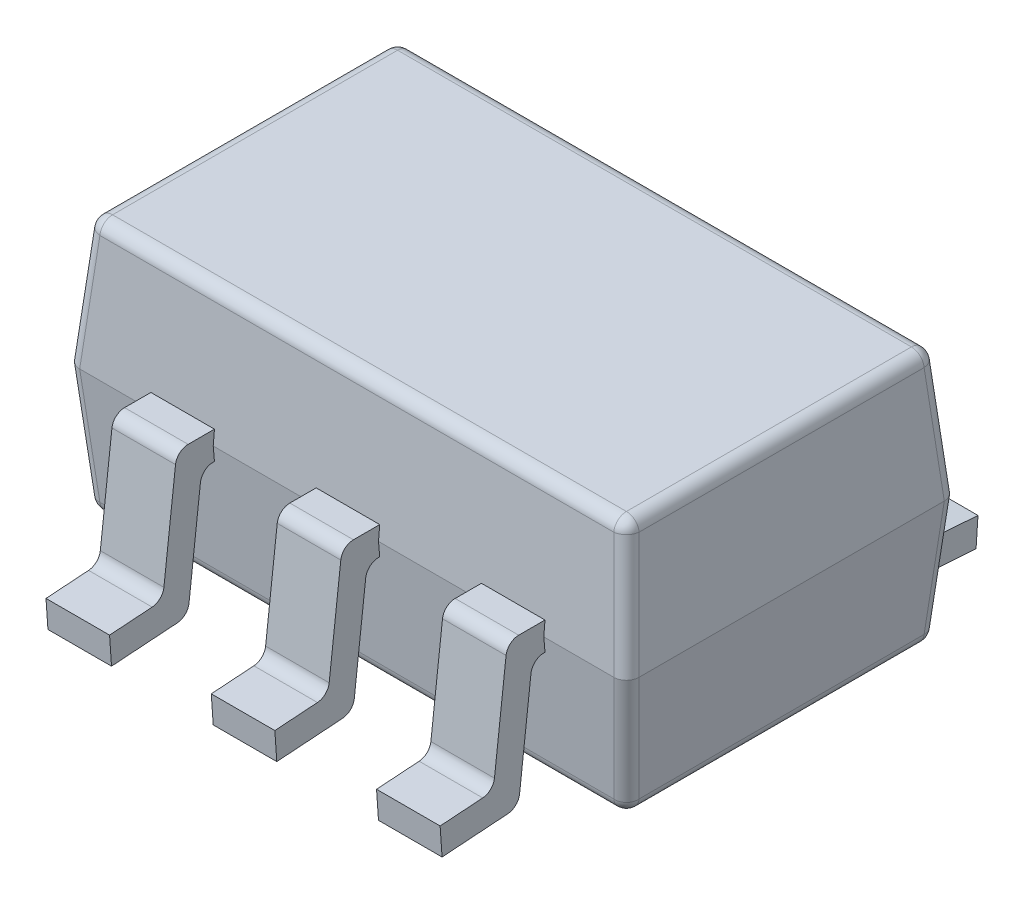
ISO-10303-21;
HEADER;
FILE_DESCRIPTION(('STEP AP214'),'2;1');
FILE_NAME('part.step','',(''),(''),'','','');
FILE_SCHEMA(('AUTOMOTIVE_DESIGN { 1 0 10303 214 1 1 1 1 }'));
ENDSEC;
DATA;
#1=APPLICATION_CONTEXT('core data for automotive mechanical design processes');
#2=APPLICATION_PROTOCOL_DEFINITION('international standard','automotive_design',2000,#1);
#3=PRODUCT_CONTEXT('',#1,'mechanical');
#4=PRODUCT('Part','Part','',(#3));
#5=PRODUCT_RELATED_PRODUCT_CATEGORY('part','',(#4));
#6=PRODUCT_DEFINITION_FORMATION('','',#4);
#7=PRODUCT_DEFINITION_CONTEXT('part definition',#1,'design');
#8=PRODUCT_DEFINITION('design','',#6,#7);
#9=PRODUCT_DEFINITION_SHAPE('','',#8);
#10=(LENGTH_UNIT() NAMED_UNIT(*) SI_UNIT(.MILLI.,.METRE.));
#11=(NAMED_UNIT(*) PLANE_ANGLE_UNIT() SI_UNIT($,.RADIAN.));
#12=(NAMED_UNIT(*) SI_UNIT($,.STERADIAN.) SOLID_ANGLE_UNIT());
#13=UNCERTAINTY_MEASURE_WITH_UNIT(LENGTH_MEASURE(1.E-05),#10,'distance_accuracy_value','');
#14=(GEOMETRIC_REPRESENTATION_CONTEXT(3) GLOBAL_UNCERTAINTY_ASSIGNED_CONTEXT((#13)) GLOBAL_UNIT_ASSIGNED_CONTEXT((#10,
#11,#12)) REPRESENTATION_CONTEXT('',''));
#15=CARTESIAN_POINT('',(0.,0.,0.));
#16=DIRECTION('',(0.,0.,1.));
#17=DIRECTION('',(1.,0.,0.));
#18=AXIS2_PLACEMENT_3D('',#15,#16,#17);
#19=CARTESIAN_POINT('',(-0.525,0.555,-0.74865002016));
#20=DIRECTION('',(-1.,0.,0.));
#21=DIRECTION('',(0.,0.,1.));
#22=AXIS2_PLACEMENT_3D('',#19,#20,#21);
#23=CYLINDRICAL_SURFACE('',#22,0.05);
#24=CARTESIAN_POINT('',(-0.525,0.555,-0.74865002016));
#25=DIRECTION('',(1.,0.,0.));
#26=DIRECTION('',(0.,0.,-1.));
#27=AXIS2_PLACEMENT_3D('',#24,#25,#26);
#28=CIRCLE('',#27,0.05);
#29=CARTESIAN_POINT('',(-0.525,0.560743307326,-0.798319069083));
#30=VERTEX_POINT('',#29);
#31=CARTESIAN_POINT('',(-0.525,0.605,-0.74865002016));
#32=VERTEX_POINT('',#31);
#33=EDGE_CURVE('E1901',#30,#32,#28,.T.);
#34=ORIENTED_EDGE('',*,*,#33,.F.);
#35=DIRECTION('',(1.,0.,0.));
#36=VECTOR('',#35,1.);
#37=CARTESIAN_POINT('',(-0.525,0.560743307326,-0.798319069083));
#38=LINE('',#37,#36);
#39=CARTESIAN_POINT('',(-0.775,0.560743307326,-0.798319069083));
#40=VERTEX_POINT('',#39);
#41=EDGE_CURVE('E1747',#40,#30,#38,.T.);
#42=ORIENTED_EDGE('',*,*,#41,.F.);
#43=CARTESIAN_POINT('',(-0.775,0.555,-0.74865002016));
#44=DIRECTION('',(-1.,0.,0.));
#45=DIRECTION('',(0.,0.,-1.));
#46=AXIS2_PLACEMENT_3D('',#43,#44,#45);
#47=CIRCLE('',#46,0.05);
#48=CARTESIAN_POINT('',(-0.775,0.605,-0.74865002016));
#49=VERTEX_POINT('',#48);
#50=EDGE_CURVE('E25',#49,#40,#47,.T.);
#51=ORIENTED_EDGE('',*,*,#50,.F.);
#52=DIRECTION('',(-1.,0.,0.));
#53=VECTOR('',#52,1.);
#54=CARTESIAN_POINT('',(-0.525,0.605,-0.74865002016));
#55=LINE('',#54,#53);
#56=EDGE_CURVE('E1852',#32,#49,#55,.T.);
#57=ORIENTED_EDGE('',*,*,#56,.F.);
#58=EDGE_LOOP('',(#34,#42,#51,#57));
#59=FACE_BOUND('',#58,.T.);
#60=ADVANCED_FACE('F17',(#59),#23,.T.);
#61=CARTESIAN_POINT('',(-0.525,0.445,-0.650636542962));
#62=DIRECTION('',(1.,0.,0.));
#63=DIRECTION('',(0.,0.,-1.));
#64=AXIS2_PLACEMENT_3D('',#61,#62,#63);
#65=CYLINDRICAL_SURFACE('',#64,0.05);
#66=CARTESIAN_POINT('',(-0.525,0.445,-0.650636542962));
#67=DIRECTION('',(-1.,0.,0.));
#68=DIRECTION('',(0.,0.,-1.));
#69=AXIS2_PLACEMENT_3D('',#66,#67,#68);
#70=CIRCLE('',#69,0.05);
#71=CARTESIAN_POINT('',(-0.525,0.495,-0.650636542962));
#72=VERTEX_POINT('',#71);
#73=CARTESIAN_POINT('',(-0.525,0.450743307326,-0.700305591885));
#74=VERTEX_POINT('',#73);
#75=EDGE_CURVE('E1904',#72,#74,#70,.T.);
#76=ORIENTED_EDGE('',*,*,#75,.F.);
#77=DIRECTION('',(1.,0.,0.));
#78=VECTOR('',#77,1.);
#79=CARTESIAN_POINT('',(-0.525,0.495,-0.650636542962));
#80=LINE('',#79,#78);
#81=CARTESIAN_POINT('',(-0.775,0.495,-0.650636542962));
#82=VERTEX_POINT('',#81);
#83=EDGE_CURVE('E1863',#82,#72,#80,.T.);
#84=ORIENTED_EDGE('',*,*,#83,.F.);
#85=CARTESIAN_POINT('',(-0.775,0.445,-0.650636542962));
#86=DIRECTION('',(1.,0.,0.));
#87=DIRECTION('',(0.,0.,-1.));
#88=AXIS2_PLACEMENT_3D('',#85,#86,#87);
#89=CIRCLE('',#88,0.05);
#90=CARTESIAN_POINT('',(-0.775,0.450743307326,-0.700305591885));
#91=VERTEX_POINT('',#90);
#92=EDGE_CURVE('E710',#91,#82,#89,.T.);
#93=ORIENTED_EDGE('',*,*,#92,.F.);
#94=DIRECTION('',(-1.,0.,0.));
#95=VECTOR('',#94,1.);
#96=CARTESIAN_POINT('',(-0.775,0.450743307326,-0.700305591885));
#97=LINE('',#96,#95);
#98=EDGE_CURVE('E1882',#74,#91,#97,.T.);
#99=ORIENTED_EDGE('',*,*,#98,.F.);
#100=EDGE_LOOP('',(#76,#84,#93,#99));
#101=FACE_BOUND('',#100,.T.);
#102=ADVANCED_FACE('F1942',(#101),#65,.F.);
#103=CARTESIAN_POINT('',(-0.525,0.06796038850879,-0.79490051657));
#104=DIRECTION('',(-1.,0.,0.));
#105=DIRECTION('',(0.,0.,1.));
#106=AXIS2_PLACEMENT_3D('',#103,#104,#105);
#107=CYLINDRICAL_SURFACE('',#106,0.05);
#108=CARTESIAN_POINT('',(-0.525,0.06796038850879,-0.79490051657));
#109=DIRECTION('',(1.,0.,0.));
#110=DIRECTION('',(0.,0.,-1.));
#111=AXIS2_PLACEMENT_3D('',#108,#109,#110);
#112=CIRCLE('',#111,0.05);
#113=CARTESIAN_POINT('',(-0.525,0.0622170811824,-0.745231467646));
#114=VERTEX_POINT('',#113);
#115=CARTESIAN_POINT('',(-0.525,0.0180821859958,-0.791412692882));
#116=VERTEX_POINT('',#115);
#117=EDGE_CURVE('E50',#114,#116,#112,.T.);
#118=ORIENTED_EDGE('',*,*,#117,.F.);
#119=DIRECTION('',(1.,0.,0.));
#120=VECTOR('',#119,1.);
#121=CARTESIAN_POINT('',(-0.525,0.0622170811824,-0.745231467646));
#122=LINE('',#121,#120);
#123=CARTESIAN_POINT('',(-0.775,0.0622170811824,-0.745231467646));
#124=VERTEX_POINT('',#123);
#125=EDGE_CURVE('E1874',#124,#114,#122,.T.);
#126=ORIENTED_EDGE('',*,*,#125,.F.);
#127=CARTESIAN_POINT('',(-0.775,0.06796038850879,-0.79490051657));
#128=DIRECTION('',(-1.,0.,0.));
#129=DIRECTION('',(0.,0.,-1.));
#130=AXIS2_PLACEMENT_3D('',#127,#128,#129);
#131=CIRCLE('',#130,0.05);
#132=CARTESIAN_POINT('',(-0.775,0.0180821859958,-0.791412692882));
#133=VERTEX_POINT('',#132);
#134=EDGE_CURVE('E37',#133,#124,#131,.T.);
#135=ORIENTED_EDGE('',*,*,#134,.F.);
#136=DIRECTION('',(-1.,0.,0.));
#137=VECTOR('',#136,1.);
#138=CARTESIAN_POINT('',(-0.525,0.0180821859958,-0.791412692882));
#139=LINE('',#138,#137);
#140=EDGE_CURVE('E1889',#116,#133,#139,.T.);
#141=ORIENTED_EDGE('',*,*,#140,.F.);
#142=EDGE_LOOP('',(#118,#126,#135,#141));
#143=FACE_BOUND('',#142,.T.);
#144=ADVANCED_FACE('F1939',(#143),#107,.T.);
#145=CARTESIAN_POINT('',(-0.525,0.171321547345,-0.893681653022));
#146=DIRECTION('',(1.,0.,0.));
#147=DIRECTION('',(0.,0.,-1.));
#148=AXIS2_PLACEMENT_3D('',#145,#146,#147);
#149=CYLINDRICAL_SURFACE('',#148,0.05);
#150=CARTESIAN_POINT('',(-0.525,0.171321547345,-0.893681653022));
#151=DIRECTION('',(-1.,0.,0.));
#152=DIRECTION('',(0.,0.,-1.));
#153=AXIS2_PLACEMENT_3D('',#150,#151,#152);
#154=CIRCLE('',#153,0.05);
#155=CARTESIAN_POINT('',(-0.525,0.121443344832,-0.890193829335));
#156=VERTEX_POINT('',#155);
#157=CARTESIAN_POINT('',(-0.525,0.165578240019,-0.844012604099));
#158=VERTEX_POINT('',#157);
#159=EDGE_CURVE('E1898',#156,#158,#154,.T.);
#160=ORIENTED_EDGE('',*,*,#159,.F.);
#161=DIRECTION('',(1.,0.,0.));
#162=VECTOR('',#161,1.);
#163=CARTESIAN_POINT('',(-0.525,0.121443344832,-0.890193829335));
#164=LINE('',#163,#162);
#165=CARTESIAN_POINT('',(-0.775,0.121443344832,-0.890193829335));
#166=VERTEX_POINT('',#165);
#167=EDGE_CURVE('E1757',#166,#156,#164,.T.);
#168=ORIENTED_EDGE('',*,*,#167,.F.);
#169=CARTESIAN_POINT('',(-0.775,0.171321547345,-0.893681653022));
#170=DIRECTION('',(1.,0.,0.));
#171=DIRECTION('',(0.,0.,-1.));
#172=AXIS2_PLACEMENT_3D('',#169,#170,#171);
#173=CIRCLE('',#172,0.05);
#174=CARTESIAN_POINT('',(-0.775,0.165578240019,-0.844012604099));
#175=VERTEX_POINT('',#174);
#176=EDGE_CURVE('E11',#175,#166,#173,.T.);
#177=ORIENTED_EDGE('',*,*,#176,.F.);
#178=DIRECTION('',(-1.,0.,0.));
#179=VECTOR('',#178,1.);
#180=CARTESIAN_POINT('',(-0.775,0.165578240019,-0.844012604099));
#181=LINE('',#180,#179);
#182=EDGE_CURVE('E1748',#158,#175,#181,.T.);
#183=ORIENTED_EDGE('',*,*,#182,.F.);
#184=EDGE_LOOP('',(#160,#168,#177,#183));
#185=FACE_BOUND('',#184,.T.);
#186=ADVANCED_FACE('F1924',(#185),#149,.F.);
#187=CARTESIAN_POINT('',(0.125,0.555,-0.74865002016));
#188=DIRECTION('',(-1.,0.,0.));
#189=DIRECTION('',(0.,0.,1.));
#190=AXIS2_PLACEMENT_3D('',#187,#188,#189);
#191=CYLINDRICAL_SURFACE('',#190,0.05);
#192=CARTESIAN_POINT('',(0.125,0.555,-0.74865002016));
#193=DIRECTION('',(1.,0.,0.));
#194=DIRECTION('',(0.,0.,-1.));
#195=AXIS2_PLACEMENT_3D('',#192,#193,#194);
#196=CIRCLE('',#195,0.05);
#197=CARTESIAN_POINT('',(0.125,0.560743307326,-0.798319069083));
#198=VERTEX_POINT('',#197);
#199=CARTESIAN_POINT('',(0.125,0.605,-0.74865002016));
#200=VERTEX_POINT('',#199);
#201=EDGE_CURVE('E1810',#198,#200,#196,.T.);
#202=ORIENTED_EDGE('',*,*,#201,.F.);
#203=DIRECTION('',(1.,0.,0.));
#204=VECTOR('',#203,1.);
#205=CARTESIAN_POINT('',(0.125,0.560743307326,-0.798319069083));
#206=LINE('',#205,#204);
#207=CARTESIAN_POINT('',(-0.125,0.560743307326,-0.798319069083));
#208=VERTEX_POINT('',#207);
#209=EDGE_CURVE('E1592',#208,#198,#206,.T.);
#210=ORIENTED_EDGE('',*,*,#209,.F.);
#211=CARTESIAN_POINT('',(-0.125,0.555,-0.74865002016));
#212=DIRECTION('',(-1.,0.,0.));
#213=DIRECTION('',(0.,0.,-1.));
#214=AXIS2_PLACEMENT_3D('',#211,#212,#213);
#215=CIRCLE('',#214,0.05);
#216=CARTESIAN_POINT('',(-0.125,0.605,-0.74865002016));
#217=VERTEX_POINT('',#216);
#218=EDGE_CURVE('E1775',#217,#208,#215,.T.);
#219=ORIENTED_EDGE('',*,*,#218,.F.);
#220=DIRECTION('',(-1.,0.,0.));
#221=VECTOR('',#220,1.);
#222=CARTESIAN_POINT('',(0.125,0.605,-0.74865002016));
#223=LINE('',#222,#221);
#224=EDGE_CURVE('E1591',#200,#217,#223,.T.);
#225=ORIENTED_EDGE('',*,*,#224,.F.);
#226=EDGE_LOOP('',(#202,#210,#219,#225));
#227=FACE_BOUND('',#226,.T.);
#228=ADVANCED_FACE('F2219',(#227),#191,.T.);
#229=CARTESIAN_POINT('',(0.125,0.445,-0.650636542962));
#230=DIRECTION('',(1.,0.,0.));
#231=DIRECTION('',(0.,0.,-1.));
#232=AXIS2_PLACEMENT_3D('',#229,#230,#231);
#233=CYLINDRICAL_SURFACE('',#232,0.05);
#234=CARTESIAN_POINT('',(0.125,0.445,-0.650636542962));
#235=DIRECTION('',(-1.,0.,0.));
#236=DIRECTION('',(0.,0.,-1.));
#237=AXIS2_PLACEMENT_3D('',#234,#235,#236);
#238=CIRCLE('',#237,0.05);
#239=CARTESIAN_POINT('',(0.125,0.495,-0.650636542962));
#240=VERTEX_POINT('',#239);
#241=CARTESIAN_POINT('',(0.125,0.450743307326,-0.700305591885));
#242=VERTEX_POINT('',#241);
#243=EDGE_CURVE('E1813',#240,#242,#238,.T.);
#244=ORIENTED_EDGE('',*,*,#243,.F.);
#245=DIRECTION('',(1.,0.,0.));
#246=VECTOR('',#245,1.);
#247=CARTESIAN_POINT('',(0.125,0.495,-0.650636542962));
#248=LINE('',#247,#246);
#249=CARTESIAN_POINT('',(-0.125,0.495,-0.650636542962));
#250=VERTEX_POINT('',#249);
#251=EDGE_CURVE('E1764',#250,#240,#248,.T.);
#252=ORIENTED_EDGE('',*,*,#251,.F.);
#253=CARTESIAN_POINT('',(-0.125,0.445,-0.650636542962));
#254=DIRECTION('',(1.,0.,0.));
#255=DIRECTION('',(0.,0.,-1.));
#256=AXIS2_PLACEMENT_3D('',#253,#254,#255);
#257=CIRCLE('',#256,0.05);
#258=CARTESIAN_POINT('',(-0.125,0.450743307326,-0.700305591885));
#259=VERTEX_POINT('',#258);
#260=EDGE_CURVE('E1772',#259,#250,#257,.T.);
#261=ORIENTED_EDGE('',*,*,#260,.F.);
#262=DIRECTION('',(-1.,0.,0.));
#263=VECTOR('',#262,1.);
#264=CARTESIAN_POINT('',(-0.125,0.450743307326,-0.700305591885));
#265=LINE('',#264,#263);
#266=EDGE_CURVE('E1788',#242,#259,#265,.T.);
#267=ORIENTED_EDGE('',*,*,#266,.F.);
#268=EDGE_LOOP('',(#244,#252,#261,#267));
#269=FACE_BOUND('',#268,.T.);
#270=ADVANCED_FACE('F2222',(#269),#233,.F.);
#271=CARTESIAN_POINT('',(0.125,0.06796038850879,-0.79490051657));
#272=DIRECTION('',(-1.,0.,0.));
#273=DIRECTION('',(0.,0.,1.));
#274=AXIS2_PLACEMENT_3D('',#271,#272,#273);
#275=CYLINDRICAL_SURFACE('',#274,0.05);
#276=CARTESIAN_POINT('',(0.125,0.06796038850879,-0.79490051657));
#277=DIRECTION('',(1.,0.,0.));
#278=DIRECTION('',(0.,0.,-1.));
#279=AXIS2_PLACEMENT_3D('',#276,#277,#278);
#280=CIRCLE('',#279,0.05);
#281=CARTESIAN_POINT('',(0.125,0.0622170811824,-0.745231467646));
#282=VERTEX_POINT('',#281);
#283=CARTESIAN_POINT('',(0.125,0.0180821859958,-0.791412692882));
#284=VERTEX_POINT('',#283);
#285=EDGE_CURVE('E1804',#282,#284,#280,.T.);
#286=ORIENTED_EDGE('',*,*,#285,.F.);
#287=DIRECTION('',(1.,0.,0.));
#288=VECTOR('',#287,1.);
#289=CARTESIAN_POINT('',(0.125,0.0622170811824,-0.745231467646));
#290=LINE('',#289,#288);
#291=CARTESIAN_POINT('',(-0.125,0.0622170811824,-0.745231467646));
#292=VERTEX_POINT('',#291);
#293=EDGE_CURVE('E1780',#292,#282,#290,.T.);
#294=ORIENTED_EDGE('',*,*,#293,.F.);
#295=CARTESIAN_POINT('',(-0.125,0.06796038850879,-0.79490051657));
#296=DIRECTION('',(-1.,0.,0.));
#297=DIRECTION('',(0.,0.,-1.));
#298=AXIS2_PLACEMENT_3D('',#295,#296,#297);
#299=CIRCLE('',#298,0.05);
#300=CARTESIAN_POINT('',(-0.125,0.0180821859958,-0.791412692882));
#301=VERTEX_POINT('',#300);
#302=EDGE_CURVE('E1776',#301,#292,#299,.T.);
#303=ORIENTED_EDGE('',*,*,#302,.F.);
#304=DIRECTION('',(-1.,0.,0.));
#305=VECTOR('',#304,1.);
#306=CARTESIAN_POINT('',(0.125,0.0180821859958,-0.791412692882));
#307=LINE('',#306,#305);
#308=EDGE_CURVE('E1796',#284,#301,#307,.T.);
#309=ORIENTED_EDGE('',*,*,#308,.F.);
#310=EDGE_LOOP('',(#286,#294,#303,#309));
#311=FACE_BOUND('',#310,.T.);
#312=ADVANCED_FACE('F2431',(#311),#275,.T.);
#313=CARTESIAN_POINT('',(0.125,0.171321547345,-0.893681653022));
#314=DIRECTION('',(1.,0.,0.));
#315=DIRECTION('',(0.,0.,-1.));
#316=AXIS2_PLACEMENT_3D('',#313,#314,#315);
#317=CYLINDRICAL_SURFACE('',#316,0.05);
#318=CARTESIAN_POINT('',(0.125,0.171321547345,-0.893681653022));
#319=DIRECTION('',(-1.,0.,0.));
#320=DIRECTION('',(0.,0.,-1.));
#321=AXIS2_PLACEMENT_3D('',#318,#319,#320);
#322=CIRCLE('',#321,0.05);
#323=CARTESIAN_POINT('',(0.125,0.121443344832,-0.890193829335));
#324=VERTEX_POINT('',#323);
#325=CARTESIAN_POINT('',(0.125,0.165578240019,-0.844012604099));
#326=VERTEX_POINT('',#325);
#327=EDGE_CURVE('E1807',#324,#326,#322,.T.);
#328=ORIENTED_EDGE('',*,*,#327,.F.);
#329=DIRECTION('',(1.,0.,0.));
#330=VECTOR('',#329,1.);
#331=CARTESIAN_POINT('',(0.125,0.121443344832,-0.890193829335));
#332=LINE('',#331,#330);
#333=CARTESIAN_POINT('',(-0.125,0.121443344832,-0.890193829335));
#334=VERTEX_POINT('',#333);
#335=EDGE_CURVE('E855',#334,#324,#332,.T.);
#336=ORIENTED_EDGE('',*,*,#335,.F.);
#337=CARTESIAN_POINT('',(-0.125,0.171321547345,-0.893681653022));
#338=DIRECTION('',(1.,0.,0.));
#339=DIRECTION('',(0.,0.,-1.));
#340=AXIS2_PLACEMENT_3D('',#337,#338,#339);
#341=CIRCLE('',#340,0.05);
#342=CARTESIAN_POINT('',(-0.125,0.165578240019,-0.844012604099));
#343=VERTEX_POINT('',#342);
#344=EDGE_CURVE('E1820',#343,#334,#341,.T.);
#345=ORIENTED_EDGE('',*,*,#344,.F.);
#346=DIRECTION('',(-1.,0.,0.));
#347=VECTOR('',#346,1.);
#348=CARTESIAN_POINT('',(-0.125,0.165578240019,-0.844012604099));
#349=LINE('',#348,#347);
#350=EDGE_CURVE('E1732',#326,#343,#349,.T.);
#351=ORIENTED_EDGE('',*,*,#350,.F.);
#352=EDGE_LOOP('',(#328,#336,#345,#351));
#353=FACE_BOUND('',#352,.T.);
#354=ADVANCED_FACE('F2428',(#353),#317,.F.);
#355=CARTESIAN_POINT('',(-0.775,0.,0.));
#356=DIRECTION('',(1.,0.,0.));
#357=DIRECTION('',(0.,1.,0.));
#358=AXIS2_PLACEMENT_3D('',#355,#356,#357);
#359=PLANE('',#358);
#360=DIRECTION('',(0.,0.0697564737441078,0.997564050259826));
#361=VECTOR('',#360,1.);
#362=CARTESIAN_POINT('',(-0.775,0.,-1.05));
#363=LINE('',#362,#361);
#364=CARTESIAN_POINT('',(-0.775,0.,-1.05));
#365=VERTEX_POINT('',#364);
#366=EDGE_CURVE('E1893',#365,#133,#363,.T.);
#367=ORIENTED_EDGE('',*,*,#366,.T.);
#368=ORIENTED_EDGE('',*,*,#134,.T.);
#369=DIRECTION('',(0.,0.993380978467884,0.114866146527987));
#370=VECTOR('',#369,1.);
#371=CARTESIAN_POINT('',(-0.775,0.02097804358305,-0.75));
#372=LINE('',#371,#370);
#373=EDGE_CURVE('E1870',#124,#91,#372,.T.);
#374=ORIENTED_EDGE('',*,*,#373,.T.);
#375=ORIENTED_EDGE('',*,*,#92,.T.);
#376=DIRECTION('',(0.,0.,1.));
#377=VECTOR('',#376,1.);
#378=CARTESIAN_POINT('',(-0.775,0.495,-0.695188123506));
#379=LINE('',#378,#377);
#380=CARTESIAN_POINT('',(-0.775,0.495,-0.645188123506));
#381=VERTEX_POINT('',#380);
#382=EDGE_CURVE('E1860',#82,#381,#379,.T.);
#383=ORIENTED_EDGE('',*,*,#382,.T.);
#384=DIRECTION('',(0.,-0.996194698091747,0.0871557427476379));
#385=VECTOR('',#384,1.);
#386=CARTESIAN_POINT('',(-0.775,0.55,-0.65));
#387=LINE('',#386,#385);
#388=CARTESIAN_POINT('',(-0.775,0.55,-0.65));
#389=VERTEX_POINT('',#388);
#390=EDGE_CURVE('E964',#389,#381,#387,.T.);
#391=ORIENTED_EDGE('',*,*,#390,.F.);
#392=DIRECTION('',(0.,0.996194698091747,0.0871557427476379));
#393=VECTOR('',#392,1.);
#394=CARTESIAN_POINT('',(-0.775,0.55,-0.65));
#395=LINE('',#394,#393);
#396=CARTESIAN_POINT('',(-0.775,0.605,-0.645188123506));
#397=VERTEX_POINT('',#396);
#398=EDGE_CURVE('E1239',#389,#397,#395,.T.);
#399=ORIENTED_EDGE('',*,*,#398,.T.);
#400=DIRECTION('',(0.,0.,-1.));
#401=VECTOR('',#400,1.);
#402=CARTESIAN_POINT('',(-0.775,0.605,-0.793201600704));
#403=LINE('',#402,#401);
#404=EDGE_CURVE('E1856',#397,#49,#403,.T.);
#405=ORIENTED_EDGE('',*,*,#404,.T.);
#406=ORIENTED_EDGE('',*,*,#50,.T.);
#407=DIRECTION('',(0.,-0.993380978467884,-0.114866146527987));
#408=VECTOR('',#407,1.);
#409=CARTESIAN_POINT('',(-0.775,0.12433920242,-0.848781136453));
#410=LINE('',#409,#408);
#411=EDGE_CURVE('E1743',#40,#175,#410,.T.);
#412=ORIENTED_EDGE('',*,*,#411,.T.);
#413=ORIENTED_EDGE('',*,*,#176,.T.);
#414=DIRECTION('',(0.,-0.0697564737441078,-0.997564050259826));
#415=VECTOR('',#414,1.);
#416=CARTESIAN_POINT('',(-0.775,0.109732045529,-1.057673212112));
#417=LINE('',#416,#415);
#418=CARTESIAN_POINT('',(-0.775,0.109732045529,-1.057673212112));
#419=VERTEX_POINT('',#418);
#420=EDGE_CURVE('E1833',#166,#419,#417,.T.);
#421=ORIENTED_EDGE('',*,*,#420,.T.);
#422=DIRECTION('',(0.,-0.997564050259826,0.0697564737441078));
#423=VECTOR('',#422,1.);
#424=CARTESIAN_POINT('',(-0.775,0.109732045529,-1.057673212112));
#425=LINE('',#424,#423);
#426=EDGE_CURVE('E1651',#419,#365,#425,.T.);
#427=ORIENTED_EDGE('',*,*,#426,.T.);
#428=EDGE_LOOP('',(#367,#368,#374,#375,#383,#391,#399,#405,#406,#412,#413,#421,#427));
#429=FACE_BOUND('',#428,.T.);
#430=ADVANCED_FACE('F1915',(#429),#359,.F.);
#431=CARTESIAN_POINT('',(-0.525,0.,0.));
#432=DIRECTION('',(1.,0.,0.));
#433=DIRECTION('',(0.,1.,0.));
#434=AXIS2_PLACEMENT_3D('',#431,#432,#433);
#435=PLANE('',#434);
#436=DIRECTION('',(0.,0.993380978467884,0.114866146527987));
#437=VECTOR('',#436,1.);
#438=CARTESIAN_POINT('',(-0.525,0.02097804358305,-0.75));
#439=LINE('',#438,#437);
#440=EDGE_CURVE('E1878',#114,#74,#439,.T.);
#441=ORIENTED_EDGE('',*,*,#440,.F.);
#442=ORIENTED_EDGE('',*,*,#117,.T.);
#443=DIRECTION('',(0.,0.0697564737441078,0.997564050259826));
#444=VECTOR('',#443,1.);
#445=CARTESIAN_POINT('',(-0.525,0.,-1.05));
#446=LINE('',#445,#444);
#447=CARTESIAN_POINT('',(-0.525,0.,-1.05));
#448=VERTEX_POINT('',#447);
#449=EDGE_CURVE('E1885',#448,#116,#446,.T.);
#450=ORIENTED_EDGE('',*,*,#449,.F.);
#451=DIRECTION('',(0.,-0.997564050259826,0.0697564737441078));
#452=VECTOR('',#451,1.);
#453=CARTESIAN_POINT('',(-0.525,0.109732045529,-1.057673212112));
#454=LINE('',#453,#452);
#455=CARTESIAN_POINT('',(-0.525,0.109732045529,-1.057673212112));
#456=VERTEX_POINT('',#455);
#457=EDGE_CURVE('E1650',#456,#448,#454,.T.);
#458=ORIENTED_EDGE('',*,*,#457,.F.);
#459=DIRECTION('',(0.,-0.0697564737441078,-0.997564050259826));
#460=VECTOR('',#459,1.);
#461=CARTESIAN_POINT('',(-0.525,0.109732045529,-1.057673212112));
#462=LINE('',#461,#460);
#463=EDGE_CURVE('E1753',#156,#456,#462,.T.);
#464=ORIENTED_EDGE('',*,*,#463,.F.);
#465=ORIENTED_EDGE('',*,*,#159,.T.);
#466=DIRECTION('',(0.,-0.993380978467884,-0.114866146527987));
#467=VECTOR('',#466,1.);
#468=CARTESIAN_POINT('',(-0.525,0.12433920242,-0.848781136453));
#469=LINE('',#468,#467);
#470=EDGE_CURVE('E1756',#30,#158,#469,.T.);
#471=ORIENTED_EDGE('',*,*,#470,.F.);
#472=ORIENTED_EDGE('',*,*,#33,.T.);
#473=DIRECTION('',(0.,0.,-1.));
#474=VECTOR('',#473,1.);
#475=CARTESIAN_POINT('',(-0.525,0.605,-0.793201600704));
#476=LINE('',#475,#474);
#477=CARTESIAN_POINT('',(-0.525,0.605,-0.645188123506));
#478=VERTEX_POINT('',#477);
#479=EDGE_CURVE('E1848',#478,#32,#476,.T.);
#480=ORIENTED_EDGE('',*,*,#479,.F.);
#481=DIRECTION('',(0.,0.996194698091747,0.0871557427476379));
#482=VECTOR('',#481,1.);
#483=CARTESIAN_POINT('',(-0.525,0.55,-0.65));
#484=LINE('',#483,#482);
#485=CARTESIAN_POINT('',(-0.525,0.55,-0.65));
#486=VERTEX_POINT('',#485);
#487=EDGE_CURVE('E1144',#486,#478,#484,.T.);
#488=ORIENTED_EDGE('',*,*,#487,.F.);
#489=DIRECTION('',(0.,-0.996194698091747,0.0871557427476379));
#490=VECTOR('',#489,1.);
#491=CARTESIAN_POINT('',(-0.525,0.55,-0.65));
#492=LINE('',#491,#490);
#493=CARTESIAN_POINT('',(-0.525,0.495,-0.645188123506));
#494=VERTEX_POINT('',#493);
#495=EDGE_CURVE('E840',#486,#494,#492,.T.);
#496=ORIENTED_EDGE('',*,*,#495,.T.);
#497=DIRECTION('',(0.,0.,1.));
#498=VECTOR('',#497,1.);
#499=CARTESIAN_POINT('',(-0.525,0.495,-0.695188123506));
#500=LINE('',#499,#498);
#501=EDGE_CURVE('E1867',#72,#494,#500,.T.);
#502=ORIENTED_EDGE('',*,*,#501,.F.);
#503=ORIENTED_EDGE('',*,*,#75,.T.);
#504=EDGE_LOOP('',(#441,#442,#450,#458,#464,#465,#471,#472,#480,#488,#496,#502,#503));
#505=FACE_BOUND('',#504,.T.);
#506=ADVANCED_FACE('F1945',(#505),#435,.T.);
#507=CARTESIAN_POINT('',(-0.525,0.,-1.05));
#508=DIRECTION('',(0.,-0.997564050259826,0.0697564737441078));
#509=DIRECTION('',(-1.,0.,0.));
#510=AXIS2_PLACEMENT_3D('',#507,#508,#509);
#511=PLANE('',#510);
#512=ORIENTED_EDGE('',*,*,#449,.T.);
#513=ORIENTED_EDGE('',*,*,#140,.T.);
#514=ORIENTED_EDGE('',*,*,#366,.F.);
#515=DIRECTION('',(-1.,0.,0.));
#516=VECTOR('',#515,1.);
#517=CARTESIAN_POINT('',(-0.525,0.,-1.05));
#518=LINE('',#517,#516);
#519=EDGE_CURVE('E1826',#448,#365,#518,.T.);
#520=ORIENTED_EDGE('',*,*,#519,.F.);
#521=EDGE_LOOP('',(#512,#513,#514,#520));
#522=FACE_BOUND('',#521,.T.);
#523=ADVANCED_FACE('F1937',(#522),#511,.T.);
#524=CARTESIAN_POINT('',(-0.525,0.02097804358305,-0.75));
#525=DIRECTION('',(0.,-0.114866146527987,0.993380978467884));
#526=DIRECTION('',(-1.,0.,0.));
#527=AXIS2_PLACEMENT_3D('',#524,#525,#526);
#528=PLANE('',#527);
#529=ORIENTED_EDGE('',*,*,#373,.F.);
#530=ORIENTED_EDGE('',*,*,#125,.T.);
#531=ORIENTED_EDGE('',*,*,#440,.T.);
#532=ORIENTED_EDGE('',*,*,#98,.T.);
#533=EDGE_LOOP('',(#529,#530,#531,#532));
#534=FACE_BOUND('',#533,.T.);
#535=ADVANCED_FACE('F1941',(#534),#528,.T.);
#536=CARTESIAN_POINT('',(-0.525,0.495,-0.695188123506));
#537=DIRECTION('',(0.,-1.,0.));
#538=DIRECTION('',(0.,0.,-1.));
#539=AXIS2_PLACEMENT_3D('',#536,#537,#538);
#540=PLANE('',#539);
#541=ORIENTED_EDGE('',*,*,#382,.F.);
#542=ORIENTED_EDGE('',*,*,#83,.T.);
#543=ORIENTED_EDGE('',*,*,#501,.T.);
#544=DIRECTION('',(-1.,0.,0.));
#545=VECTOR('',#544,1.);
#546=CARTESIAN_POINT('',(-0.525,0.495,-0.645188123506));
#547=LINE('',#546,#545);
#548=EDGE_CURVE('E971',#494,#381,#547,.T.);
#549=ORIENTED_EDGE('',*,*,#548,.T.);
#550=EDGE_LOOP('',(#541,#542,#543,#549));
#551=FACE_BOUND('',#550,.T.);
#552=ADVANCED_FACE('F1949',(#551),#540,.T.);
#553=CARTESIAN_POINT('',(-0.525,0.605,-0.793201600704));
#554=DIRECTION('',(0.,1.,0.));
#555=DIRECTION('',(1.,0.,0.));
#556=AXIS2_PLACEMENT_3D('',#553,#554,#555);
#557=PLANE('',#556);
#558=ORIENTED_EDGE('',*,*,#479,.T.);
#559=ORIENTED_EDGE('',*,*,#56,.T.);
#560=ORIENTED_EDGE('',*,*,#404,.F.);
#561=DIRECTION('',(-1.,0.,0.));
#562=VECTOR('',#561,1.);
#563=CARTESIAN_POINT('',(-0.525,0.605,-0.645188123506));
#564=LINE('',#563,#562);
#565=EDGE_CURVE('E1229',#478,#397,#564,.T.);
#566=ORIENTED_EDGE('',*,*,#565,.F.);
#567=EDGE_LOOP('',(#558,#559,#560,#566));
#568=FACE_BOUND('',#567,.T.);
#569=ADVANCED_FACE('F1963',(#568),#557,.T.);
#570=CARTESIAN_POINT('',(-0.525,0.12433920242,-0.848781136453));
#571=DIRECTION('',(0.,0.114866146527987,-0.993380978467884));
#572=DIRECTION('',(-1.,0.,0.));
#573=AXIS2_PLACEMENT_3D('',#570,#571,#572);
#574=PLANE('',#573);
#575=ORIENTED_EDGE('',*,*,#470,.T.);
#576=ORIENTED_EDGE('',*,*,#182,.T.);
#577=ORIENTED_EDGE('',*,*,#411,.F.);
#578=ORIENTED_EDGE('',*,*,#41,.T.);
#579=EDGE_LOOP('',(#575,#576,#577,#578));
#580=FACE_BOUND('',#579,.T.);
#581=ADVANCED_FACE('F1921',(#580),#574,.T.);
#582=CARTESIAN_POINT('',(-0.525,0.109732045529,-1.057673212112));
#583=DIRECTION('',(0.,0.997564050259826,-0.0697564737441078));
#584=DIRECTION('',(-1.,0.,0.));
#585=AXIS2_PLACEMENT_3D('',#582,#583,#584);
#586=PLANE('',#585);
#587=ORIENTED_EDGE('',*,*,#420,.F.);
#588=ORIENTED_EDGE('',*,*,#167,.T.);
#589=ORIENTED_EDGE('',*,*,#463,.T.);
#590=DIRECTION('',(-1.,0.,0.));
#591=VECTOR('',#590,1.);
#592=CARTESIAN_POINT('',(-0.525,0.109732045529,-1.057673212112));
#593=LINE('',#592,#591);
#594=EDGE_CURVE('E1646',#456,#419,#593,.T.);
#595=ORIENTED_EDGE('',*,*,#594,.T.);
#596=EDGE_LOOP('',(#587,#588,#589,#595));
#597=FACE_BOUND('',#596,.T.);
#598=ADVANCED_FACE('F1931',(#597),#586,.T.);
#599=CARTESIAN_POINT('',(-0.525,0.109732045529,-1.057673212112));
#600=DIRECTION('',(0.,-0.0697564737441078,-0.997564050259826));
#601=DIRECTION('',(0.,-0.997564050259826,0.0697564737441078));
#602=AXIS2_PLACEMENT_3D('',#599,#600,#601);
#603=PLANE('',#602);
#604=ORIENTED_EDGE('',*,*,#426,.F.);
#605=ORIENTED_EDGE('',*,*,#594,.F.);
#606=ORIENTED_EDGE('',*,*,#457,.T.);
#607=ORIENTED_EDGE('',*,*,#519,.T.);
#608=EDGE_LOOP('',(#604,#605,#606,#607));
#609=FACE_BOUND('',#608,.T.);
#610=ADVANCED_FACE('F1934',(#609),#603,.T.);
#611=CARTESIAN_POINT('',(-0.125,0.,0.));
#612=DIRECTION('',(1.,0.,0.));
#613=DIRECTION('',(0.,1.,0.));
#614=AXIS2_PLACEMENT_3D('',#611,#612,#613);
#615=PLANE('',#614);
#616=DIRECTION('',(0.,0.0697564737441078,0.997564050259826));
#617=VECTOR('',#616,1.);
#618=CARTESIAN_POINT('',(-0.125,0.,-1.05));
#619=LINE('',#618,#617);
#620=CARTESIAN_POINT('',(-0.125,0.,-1.05));
#621=VERTEX_POINT('',#620);
#622=EDGE_CURVE('E1800',#621,#301,#619,.T.);
#623=ORIENTED_EDGE('',*,*,#622,.T.);
#624=ORIENTED_EDGE('',*,*,#302,.T.);
#625=DIRECTION('',(0.,0.993380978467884,0.114866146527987));
#626=VECTOR('',#625,1.);
#627=CARTESIAN_POINT('',(-0.125,0.02097804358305,-0.75));
#628=LINE('',#627,#626);
#629=EDGE_CURVE('E1771',#292,#259,#628,.T.);
#630=ORIENTED_EDGE('',*,*,#629,.T.);
#631=ORIENTED_EDGE('',*,*,#260,.T.);
#632=DIRECTION('',(0.,0.,1.));
#633=VECTOR('',#632,1.);
#634=CARTESIAN_POINT('',(-0.125,0.495,-0.695188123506));
#635=LINE('',#634,#633);
#636=CARTESIAN_POINT('',(-0.125,0.495,-0.645188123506));
#637=VERTEX_POINT('',#636);
#638=EDGE_CURVE('E1761',#250,#637,#635,.T.);
#639=ORIENTED_EDGE('',*,*,#638,.T.);
#640=DIRECTION('',(0.,-0.996194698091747,0.0871557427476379));
#641=VECTOR('',#640,1.);
#642=CARTESIAN_POINT('',(-0.125,0.55,-0.65));
#643=LINE('',#642,#641);
#644=CARTESIAN_POINT('',(-0.125,0.55,-0.65));
#645=VERTEX_POINT('',#644);
#646=EDGE_CURVE('E884',#645,#637,#643,.T.);
#647=ORIENTED_EDGE('',*,*,#646,.F.);
#648=DIRECTION('',(0.,0.996194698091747,0.0871557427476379));
#649=VECTOR('',#648,1.);
#650=CARTESIAN_POINT('',(-0.125,0.55,-0.65));
#651=LINE('',#650,#649);
#652=CARTESIAN_POINT('',(-0.125,0.605,-0.645188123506));
#653=VERTEX_POINT('',#652);
#654=EDGE_CURVE('E1039',#645,#653,#651,.T.);
#655=ORIENTED_EDGE('',*,*,#654,.T.);
#656=DIRECTION('',(0.,0.,-1.));
#657=VECTOR('',#656,1.);
#658=CARTESIAN_POINT('',(-0.125,0.605,-0.793201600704));
#659=LINE('',#658,#657);
#660=EDGE_CURVE('E1752',#653,#217,#659,.T.);
#661=ORIENTED_EDGE('',*,*,#660,.T.);
#662=ORIENTED_EDGE('',*,*,#218,.T.);
#663=DIRECTION('',(0.,-0.993380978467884,-0.114866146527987));
#664=VECTOR('',#663,1.);
#665=CARTESIAN_POINT('',(-0.125,0.12433920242,-0.848781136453));
#666=LINE('',#665,#664);
#667=EDGE_CURVE('E1736',#208,#343,#666,.T.);
#668=ORIENTED_EDGE('',*,*,#667,.T.);
#669=ORIENTED_EDGE('',*,*,#344,.T.);
#670=DIRECTION('',(0.,-0.0697564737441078,-0.997564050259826));
#671=VECTOR('',#670,1.);
#672=CARTESIAN_POINT('',(-0.125,0.109732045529,-1.057673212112));
#673=LINE('',#672,#671);
#674=CARTESIAN_POINT('',(-0.125,0.109732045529,-1.057673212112));
#675=VERTEX_POINT('',#674);
#676=EDGE_CURVE('E1722',#334,#675,#673,.T.);
#677=ORIENTED_EDGE('',*,*,#676,.T.);
#678=DIRECTION('',(0.,-0.997564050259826,0.0697564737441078));
#679=VECTOR('',#678,1.);
#680=CARTESIAN_POINT('',(-0.125,0.109732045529,-1.057673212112));
#681=LINE('',#680,#679);
#682=EDGE_CURVE('E1706',#675,#621,#681,.T.);
#683=ORIENTED_EDGE('',*,*,#682,.T.);
#684=EDGE_LOOP('',(#623,#624,#630,#631,#639,#647,#655,#661,#662,#668,#669,#677,#683));
#685=FACE_BOUND('',#684,.T.);
#686=ADVANCED_FACE('F1969',(#685),#615,.F.);
#687=CARTESIAN_POINT('',(0.125,0.,0.));
#688=DIRECTION('',(1.,0.,0.));
#689=DIRECTION('',(0.,1.,0.));
#690=AXIS2_PLACEMENT_3D('',#687,#688,#689);
#691=PLANE('',#690);
#692=DIRECTION('',(0.,0.993380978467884,0.114866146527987));
#693=VECTOR('',#692,1.);
#694=CARTESIAN_POINT('',(0.125,0.02097804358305,-0.75));
#695=LINE('',#694,#693);
#696=EDGE_CURVE('E1784',#282,#242,#695,.T.);
#697=ORIENTED_EDGE('',*,*,#696,.F.);
#698=ORIENTED_EDGE('',*,*,#285,.T.);
#699=DIRECTION('',(0.,0.0697564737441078,0.997564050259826));
#700=VECTOR('',#699,1.);
#701=CARTESIAN_POINT('',(0.125,0.,-1.05));
#702=LINE('',#701,#700);
#703=CARTESIAN_POINT('',(0.125,0.,-1.05));
#704=VERTEX_POINT('',#703);
#705=EDGE_CURVE('E1792',#704,#284,#702,.T.);
#706=ORIENTED_EDGE('',*,*,#705,.F.);
#707=DIRECTION('',(0.,-0.997564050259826,0.0697564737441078));
#708=VECTOR('',#707,1.);
#709=CARTESIAN_POINT('',(0.125,0.109732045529,-1.057673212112));
#710=LINE('',#709,#708);
#711=CARTESIAN_POINT('',(0.125,0.109732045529,-1.057673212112));
#712=VERTEX_POINT('',#711);
#713=EDGE_CURVE('E1714',#712,#704,#710,.T.);
#714=ORIENTED_EDGE('',*,*,#713,.F.);
#715=DIRECTION('',(0.,-0.0697564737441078,-0.997564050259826));
#716=VECTOR('',#715,1.);
#717=CARTESIAN_POINT('',(0.125,0.109732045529,-1.057673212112));
#718=LINE('',#717,#716);
#719=EDGE_CURVE('E1725',#324,#712,#718,.T.);
#720=ORIENTED_EDGE('',*,*,#719,.F.);
#721=ORIENTED_EDGE('',*,*,#327,.T.);
#722=DIRECTION('',(0.,-0.993380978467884,-0.114866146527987));
#723=VECTOR('',#722,1.);
#724=CARTESIAN_POINT('',(0.125,0.12433920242,-0.848781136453));
#725=LINE('',#724,#723);
#726=EDGE_CURVE('E1728',#198,#326,#725,.T.);
#727=ORIENTED_EDGE('',*,*,#726,.F.);
#728=ORIENTED_EDGE('',*,*,#201,.T.);
#729=DIRECTION('',(0.,0.,-1.));
#730=VECTOR('',#729,1.);
#731=CARTESIAN_POINT('',(0.125,0.605,-0.793201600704));
#732=LINE('',#731,#730);
#733=CARTESIAN_POINT('',(0.125,0.605,-0.645188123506));
#734=VERTEX_POINT('',#733);
#735=EDGE_CURVE('E1587',#734,#200,#732,.T.);
#736=ORIENTED_EDGE('',*,*,#735,.F.);
#737=DIRECTION('',(0.,0.996194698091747,0.0871557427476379));
#738=VECTOR('',#737,1.);
#739=CARTESIAN_POINT('',(0.125,0.55,-0.65));
#740=LINE('',#739,#738);
#741=CARTESIAN_POINT('',(0.125,0.55,-0.65));
#742=VERTEX_POINT('',#741);
#743=EDGE_CURVE('E969',#742,#734,#740,.T.);
#744=ORIENTED_EDGE('',*,*,#743,.F.);
#745=DIRECTION('',(0.,-0.996194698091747,0.0871557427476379));
#746=VECTOR('',#745,1.);
#747=CARTESIAN_POINT('',(0.125,0.55,-0.65));
#748=LINE('',#747,#746);
#749=CARTESIAN_POINT('',(0.125,0.495,-0.645188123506));
#750=VERTEX_POINT('',#749);
#751=EDGE_CURVE('E912',#742,#750,#748,.T.);
#752=ORIENTED_EDGE('',*,*,#751,.T.);
#753=DIRECTION('',(0.,0.,1.));
#754=VECTOR('',#753,1.);
#755=CARTESIAN_POINT('',(0.125,0.495,-0.695188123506));
#756=LINE('',#755,#754);
#757=EDGE_CURVE('E1768',#240,#750,#756,.T.);
#758=ORIENTED_EDGE('',*,*,#757,.F.);
#759=ORIENTED_EDGE('',*,*,#243,.T.);
#760=EDGE_LOOP('',(#697,#698,#706,#714,#720,#721,#727,#728,#736,#744,#752,#758,#759));
#761=FACE_BOUND('',#760,.T.);
#762=ADVANCED_FACE('F1977',(#761),#691,.T.);
#763=CARTESIAN_POINT('',(0.125,0.,-1.05));
#764=DIRECTION('',(0.,-0.997564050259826,0.0697564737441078));
#765=DIRECTION('',(-1.,0.,0.));
#766=AXIS2_PLACEMENT_3D('',#763,#764,#765);
#767=PLANE('',#766);
#768=ORIENTED_EDGE('',*,*,#705,.T.);
#769=ORIENTED_EDGE('',*,*,#308,.T.);
#770=ORIENTED_EDGE('',*,*,#622,.F.);
#771=DIRECTION('',(-1.,0.,0.));
#772=VECTOR('',#771,1.);
#773=CARTESIAN_POINT('',(0.125,0.,-1.05));
#774=LINE('',#773,#772);
#775=EDGE_CURVE('E1718',#704,#621,#774,.T.);
#776=ORIENTED_EDGE('',*,*,#775,.F.);
#777=EDGE_LOOP('',(#768,#769,#770,#776));
#778=FACE_BOUND('',#777,.T.);
#779=ADVANCED_FACE('F2406',(#778),#767,.T.);
#780=CARTESIAN_POINT('',(0.125,0.02097804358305,-0.75));
#781=DIRECTION('',(0.,-0.114866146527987,0.993380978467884));
#782=DIRECTION('',(-1.,0.,0.));
#783=AXIS2_PLACEMENT_3D('',#780,#781,#782);
#784=PLANE('',#783);
#785=ORIENTED_EDGE('',*,*,#629,.F.);
#786=ORIENTED_EDGE('',*,*,#293,.T.);
#787=ORIENTED_EDGE('',*,*,#696,.T.);
#788=ORIENTED_EDGE('',*,*,#266,.T.);
#789=EDGE_LOOP('',(#785,#786,#787,#788));
#790=FACE_BOUND('',#789,.T.);
#791=ADVANCED_FACE('F2303',(#790),#784,.T.);
#792=CARTESIAN_POINT('',(0.125,0.495,-0.695188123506));
#793=DIRECTION('',(0.,-1.,0.));
#794=DIRECTION('',(0.,0.,-1.));
#795=AXIS2_PLACEMENT_3D('',#792,#793,#794);
#796=PLANE('',#795);
#797=ORIENTED_EDGE('',*,*,#638,.F.);
#798=ORIENTED_EDGE('',*,*,#251,.T.);
#799=ORIENTED_EDGE('',*,*,#757,.T.);
#800=DIRECTION('',(-1.,0.,0.));
#801=VECTOR('',#800,1.);
#802=CARTESIAN_POINT('',(0.125,0.495,-0.645188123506));
#803=LINE('',#802,#801);
#804=EDGE_CURVE('E888',#750,#637,#803,.T.);
#805=ORIENTED_EDGE('',*,*,#804,.T.);
#806=EDGE_LOOP('',(#797,#798,#799,#805));
#807=FACE_BOUND('',#806,.T.);
#808=ADVANCED_FACE('F1973',(#807),#796,.T.);
#809=CARTESIAN_POINT('',(0.125,0.605,-0.793201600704));
#810=DIRECTION('',(0.,1.,0.));
#811=DIRECTION('',(1.,0.,0.));
#812=AXIS2_PLACEMENT_3D('',#809,#810,#811);
#813=PLANE('',#812);
#814=ORIENTED_EDGE('',*,*,#735,.T.);
#815=ORIENTED_EDGE('',*,*,#224,.T.);
#816=ORIENTED_EDGE('',*,*,#660,.F.);
#817=DIRECTION('',(-1.,0.,0.));
#818=VECTOR('',#817,1.);
#819=CARTESIAN_POINT('',(0.125,0.605,-0.645188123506));
#820=LINE('',#819,#818);
#821=EDGE_CURVE('E1132',#734,#653,#820,.T.);
#822=ORIENTED_EDGE('',*,*,#821,.F.);
#823=EDGE_LOOP('',(#814,#815,#816,#822));
#824=FACE_BOUND('',#823,.T.);
#825=ADVANCED_FACE('F2302',(#824),#813,.T.);
#826=CARTESIAN_POINT('',(0.125,0.12433920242,-0.848781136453));
#827=DIRECTION('',(0.,0.114866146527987,-0.993380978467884));
#828=DIRECTION('',(-1.,0.,0.));
#829=AXIS2_PLACEMENT_3D('',#826,#827,#828);
#830=PLANE('',#829);
#831=ORIENTED_EDGE('',*,*,#726,.T.);
#832=ORIENTED_EDGE('',*,*,#350,.T.);
#833=ORIENTED_EDGE('',*,*,#667,.F.);
#834=ORIENTED_EDGE('',*,*,#209,.T.);
#835=EDGE_LOOP('',(#831,#832,#833,#834));
#836=FACE_BOUND('',#835,.T.);
#837=ADVANCED_FACE('F2404',(#836),#830,.T.);
#838=CARTESIAN_POINT('',(0.125,0.109732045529,-1.057673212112));
#839=DIRECTION('',(0.,0.997564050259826,-0.0697564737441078));
#840=DIRECTION('',(-1.,0.,0.));
#841=AXIS2_PLACEMENT_3D('',#838,#839,#840);
#842=PLANE('',#841);
#843=ORIENTED_EDGE('',*,*,#676,.F.);
#844=ORIENTED_EDGE('',*,*,#335,.T.);
#845=ORIENTED_EDGE('',*,*,#719,.T.);
#846=DIRECTION('',(-1.,0.,0.));
#847=VECTOR('',#846,1.);
#848=CARTESIAN_POINT('',(0.125,0.109732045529,-1.057673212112));
#849=LINE('',#848,#847);
#850=EDGE_CURVE('E1710',#712,#675,#849,.T.);
#851=ORIENTED_EDGE('',*,*,#850,.T.);
#852=EDGE_LOOP('',(#843,#844,#845,#851));
#853=FACE_BOUND('',#852,.T.);
#854=ADVANCED_FACE('F2401',(#853),#842,.T.);
#855=CARTESIAN_POINT('',(0.125,0.109732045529,-1.057673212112));
#856=DIRECTION('',(0.,-0.0697564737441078,-0.997564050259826));
#857=DIRECTION('',(0.,-0.997564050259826,0.0697564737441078));
#858=AXIS2_PLACEMENT_3D('',#855,#856,#857);
#859=PLANE('',#858);
#860=ORIENTED_EDGE('',*,*,#682,.F.);
#861=ORIENTED_EDGE('',*,*,#850,.F.);
#862=ORIENTED_EDGE('',*,*,#713,.T.);
#863=ORIENTED_EDGE('',*,*,#775,.T.);
#864=EDGE_LOOP('',(#860,#861,#862,#863));
#865=FACE_BOUND('',#864,.T.);
#866=ADVANCED_FACE('F2378',(#865),#859,.T.);
#867=CARTESIAN_POINT('',(0.775,0.555,-0.74865002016));
#868=DIRECTION('',(-1.,0.,0.));
#869=DIRECTION('',(0.,0.,1.));
#870=AXIS2_PLACEMENT_3D('',#867,#868,#869);
#871=CYLINDRICAL_SURFACE('',#870,0.05);
#872=CARTESIAN_POINT('',(0.775,0.555,-0.74865002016));
#873=DIRECTION('',(1.,0.,0.));
#874=DIRECTION('',(0.,0.,-1.));
#875=AXIS2_PLACEMENT_3D('',#872,#873,#874);
#876=CIRCLE('',#875,0.05);
#877=CARTESIAN_POINT('',(0.775,0.560743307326,-0.798319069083));
#878=VERTEX_POINT('',#877);
#879=CARTESIAN_POINT('',(0.775,0.605,-0.74865002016));
#880=VERTEX_POINT('',#879);
#881=EDGE_CURVE('E1688',#878,#880,#876,.T.);
#882=ORIENTED_EDGE('',*,*,#881,.F.);
#883=DIRECTION('',(1.,0.,0.));
#884=VECTOR('',#883,1.);
#885=CARTESIAN_POINT('',(0.775,0.560743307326,-0.798319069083));
#886=LINE('',#885,#884);
#887=CARTESIAN_POINT('',(0.525,0.560743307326,-0.798319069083));
#888=VERTEX_POINT('',#887);
#889=EDGE_CURVE('E1628',#888,#878,#886,.T.);
#890=ORIENTED_EDGE('',*,*,#889,.F.);
#891=CARTESIAN_POINT('',(0.525,0.555,-0.74865002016));
#892=DIRECTION('',(-1.,0.,0.));
#893=DIRECTION('',(0.,0.,-1.));
#894=AXIS2_PLACEMENT_3D('',#891,#892,#893);
#895=CIRCLE('',#894,0.05);
#896=CARTESIAN_POINT('',(0.525,0.605,-0.74865002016));
#897=VERTEX_POINT('',#896);
#898=EDGE_CURVE('E1700',#897,#888,#895,.T.);
#899=ORIENTED_EDGE('',*,*,#898,.F.);
#900=DIRECTION('',(-1.,0.,0.));
#901=VECTOR('',#900,1.);
#902=CARTESIAN_POINT('',(0.775,0.605,-0.74865002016));
#903=LINE('',#902,#901);
#904=EDGE_CURVE('E1410',#880,#897,#903,.T.);
#905=ORIENTED_EDGE('',*,*,#904,.F.);
#906=EDGE_LOOP('',(#882,#890,#899,#905));
#907=FACE_BOUND('',#906,.T.);
#908=ADVANCED_FACE('F2374',(#907),#871,.T.);
#909=CARTESIAN_POINT('',(0.775,0.445,-0.650636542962));
#910=DIRECTION('',(1.,0.,0.));
#911=DIRECTION('',(0.,0.,-1.));
#912=AXIS2_PLACEMENT_3D('',#909,#910,#911);
#913=CYLINDRICAL_SURFACE('',#912,0.05);
#914=CARTESIAN_POINT('',(0.775,0.445,-0.650636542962));
#915=DIRECTION('',(-1.,0.,0.));
#916=DIRECTION('',(0.,0.,-1.));
#917=AXIS2_PLACEMENT_3D('',#914,#915,#916);
#918=CIRCLE('',#917,0.05);
#919=CARTESIAN_POINT('',(0.775,0.495,-0.650636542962));
#920=VERTEX_POINT('',#919);
#921=CARTESIAN_POINT('',(0.775,0.450743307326,-0.700305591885));
#922=VERTEX_POINT('',#921);
#923=EDGE_CURVE('E1691',#920,#922,#918,.T.);
#924=ORIENTED_EDGE('',*,*,#923,.F.);
#925=DIRECTION('',(1.,0.,0.));
#926=VECTOR('',#925,1.);
#927=CARTESIAN_POINT('',(0.775,0.495,-0.650636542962));
#928=LINE('',#927,#926);
#929=CARTESIAN_POINT('',(0.525,0.495,-0.650636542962));
#930=VERTEX_POINT('',#929);
#931=EDGE_CURVE('E1641',#930,#920,#928,.T.);
#932=ORIENTED_EDGE('',*,*,#931,.F.);
#933=CARTESIAN_POINT('',(0.525,0.445,-0.650636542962));
#934=DIRECTION('',(1.,0.,0.));
#935=DIRECTION('',(0.,0.,-1.));
#936=AXIS2_PLACEMENT_3D('',#933,#934,#935);
#937=CIRCLE('',#936,0.05);
#938=CARTESIAN_POINT('',(0.525,0.450743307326,-0.700305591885));
#939=VERTEX_POINT('',#938);
#940=EDGE_CURVE('E1697',#939,#930,#937,.T.);
#941=ORIENTED_EDGE('',*,*,#940,.F.);
#942=DIRECTION('',(-1.,0.,0.));
#943=VECTOR('',#942,1.);
#944=CARTESIAN_POINT('',(0.525,0.450743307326,-0.700305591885));
#945=LINE('',#944,#943);
#946=EDGE_CURVE('E1666',#922,#939,#945,.T.);
#947=ORIENTED_EDGE('',*,*,#946,.F.);
#948=EDGE_LOOP('',(#924,#932,#941,#947));
#949=FACE_BOUND('',#948,.T.);
#950=ADVANCED_FACE('F2377',(#949),#913,.F.);
#951=CARTESIAN_POINT('',(0.775,0.06796038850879,-0.79490051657));
#952=DIRECTION('',(-1.,0.,0.));
#953=DIRECTION('',(0.,0.,1.));
#954=AXIS2_PLACEMENT_3D('',#951,#952,#953);
#955=CYLINDRICAL_SURFACE('',#954,0.05);
#956=CARTESIAN_POINT('',(0.775,0.06796038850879,-0.79490051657));
#957=DIRECTION('',(1.,0.,0.));
#958=DIRECTION('',(0.,0.,-1.));
#959=AXIS2_PLACEMENT_3D('',#956,#957,#958);
#960=CIRCLE('',#959,0.05);
#961=CARTESIAN_POINT('',(0.775,0.0622170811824,-0.745231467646));
#962=VERTEX_POINT('',#961);
#963=CARTESIAN_POINT('',(0.775,0.0180821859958,-0.791412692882));
#964=VERTEX_POINT('',#963);
#965=EDGE_CURVE('E1682',#962,#964,#960,.T.);
#966=ORIENTED_EDGE('',*,*,#965,.F.);
#967=DIRECTION('',(1.,0.,0.));
#968=VECTOR('',#967,1.);
#969=CARTESIAN_POINT('',(0.775,0.0622170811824,-0.745231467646));
#970=LINE('',#969,#968);
#971=CARTESIAN_POINT('',(0.525,0.0622170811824,-0.745231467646));
#972=VERTEX_POINT('',#971);
#973=EDGE_CURVE('E1658',#972,#962,#970,.T.);
#974=ORIENTED_EDGE('',*,*,#973,.F.);
#975=CARTESIAN_POINT('',(0.525,0.06796038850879,-0.79490051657));
#976=DIRECTION('',(-1.,0.,0.));
#977=DIRECTION('',(0.,0.,-1.));
#978=AXIS2_PLACEMENT_3D('',#975,#976,#977);
#979=CIRCLE('',#978,0.05);
#980=CARTESIAN_POINT('',(0.525,0.0180821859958,-0.791412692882));
#981=VERTEX_POINT('',#980);
#982=EDGE_CURVE('E1694',#981,#972,#979,.T.);
#983=ORIENTED_EDGE('',*,*,#982,.F.);
#984=DIRECTION('',(-1.,0.,0.));
#985=VECTOR('',#984,1.);
#986=CARTESIAN_POINT('',(0.775,0.0180821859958,-0.791412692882));
#987=LINE('',#986,#985);
#988=EDGE_CURVE('E1674',#964,#981,#987,.T.);
#989=ORIENTED_EDGE('',*,*,#988,.F.);
#990=EDGE_LOOP('',(#966,#974,#983,#989));
#991=FACE_BOUND('',#990,.T.);
#992=ADVANCED_FACE('F2393',(#991),#955,.T.);
#993=CARTESIAN_POINT('',(0.775,0.171321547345,-0.893681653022));
#994=DIRECTION('',(1.,0.,0.));
#995=DIRECTION('',(0.,0.,-1.));
#996=AXIS2_PLACEMENT_3D('',#993,#994,#995);
#997=CYLINDRICAL_SURFACE('',#996,0.05);
#998=CARTESIAN_POINT('',(0.775,0.171321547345,-0.893681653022));
#999=DIRECTION('',(-1.,0.,0.));
#1000=DIRECTION('',(0.,0.,-1.));
#1001=AXIS2_PLACEMENT_3D('',#998,#999,#1000);
#1002=CIRCLE('',#1001,0.05);
#1003=CARTESIAN_POINT('',(0.775,0.121443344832,-0.890193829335));
#1004=VERTEX_POINT('',#1003);
#1005=CARTESIAN_POINT('',(0.775,0.165578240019,-0.844012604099));
#1006=VERTEX_POINT('',#1005);
#1007=EDGE_CURVE('E1685',#1004,#1006,#1002,.T.);
#1008=ORIENTED_EDGE('',*,*,#1007,.F.);
#1009=DIRECTION('',(1.,0.,0.));
#1010=VECTOR('',#1009,1.);
#1011=CARTESIAN_POINT('',(0.775,0.121443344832,-0.890193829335));
#1012=LINE('',#1011,#1010);
#1013=CARTESIAN_POINT('',(0.525,0.121443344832,-0.890193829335));
#1014=VERTEX_POINT('',#1013);
#1015=EDGE_CURVE('E1435',#1014,#1004,#1012,.T.);
#1016=ORIENTED_EDGE('',*,*,#1015,.F.);
#1017=CARTESIAN_POINT('',(0.525,0.171321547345,-0.893681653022));
#1018=DIRECTION('',(1.,0.,0.));
#1019=DIRECTION('',(0.,0.,-1.));
#1020=AXIS2_PLACEMENT_3D('',#1017,#1018,#1019);
#1021=CIRCLE('',#1020,0.05);
#1022=CARTESIAN_POINT('',(0.525,0.165578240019,-0.844012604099));
#1023=VERTEX_POINT('',#1022);
#1024=EDGE_CURVE('E1703',#1023,#1014,#1021,.T.);
#1025=ORIENTED_EDGE('',*,*,#1024,.F.);
#1026=DIRECTION('',(-1.,0.,0.));
#1027=VECTOR('',#1026,1.);
#1028=CARTESIAN_POINT('',(0.525,0.165578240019,-0.844012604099));
#1029=LINE('',#1028,#1027);
#1030=EDGE_CURVE('E1422',#1006,#1023,#1029,.T.);
#1031=ORIENTED_EDGE('',*,*,#1030,.F.);
#1032=EDGE_LOOP('',(#1008,#1016,#1025,#1031));
#1033=FACE_BOUND('',#1032,.T.);
#1034=ADVANCED_FACE('F2322',(#1033),#997,.F.);
#1035=CARTESIAN_POINT('',(0.525,0.,0.));
#1036=DIRECTION('',(1.,0.,0.));
#1037=DIRECTION('',(0.,1.,0.));
#1038=AXIS2_PLACEMENT_3D('',#1035,#1036,#1037);
#1039=PLANE('',#1038);
#1040=DIRECTION('',(0.,0.0697564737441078,0.997564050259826));
#1041=VECTOR('',#1040,1.);
#1042=CARTESIAN_POINT('',(0.525,0.,-1.05));
#1043=LINE('',#1042,#1041);
#1044=CARTESIAN_POINT('',(0.525,0.,-1.05));
#1045=VERTEX_POINT('',#1044);
#1046=EDGE_CURVE('E1678',#1045,#981,#1043,.T.);
#1047=ORIENTED_EDGE('',*,*,#1046,.T.);
#1048=ORIENTED_EDGE('',*,*,#982,.T.);
#1049=DIRECTION('',(0.,0.993380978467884,0.114866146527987));
#1050=VECTOR('',#1049,1.);
#1051=CARTESIAN_POINT('',(0.525,0.02097804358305,-0.75));
#1052=LINE('',#1051,#1050);
#1053=EDGE_CURVE('E1654',#972,#939,#1052,.T.);
#1054=ORIENTED_EDGE('',*,*,#1053,.T.);
#1055=ORIENTED_EDGE('',*,*,#940,.T.);
#1056=DIRECTION('',(0.,0.,1.));
#1057=VECTOR('',#1056,1.);
#1058=CARTESIAN_POINT('',(0.525,0.495,-0.695188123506));
#1059=LINE('',#1058,#1057);
#1060=CARTESIAN_POINT('',(0.525,0.495,-0.645188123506));
#1061=VERTEX_POINT('',#1060);
#1062=EDGE_CURVE('E1409',#930,#1061,#1059,.T.);
#1063=ORIENTED_EDGE('',*,*,#1062,.T.);
#1064=DIRECTION('',(0.,-0.996194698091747,0.0871557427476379));
#1065=VECTOR('',#1064,1.);
#1066=CARTESIAN_POINT('',(0.525,0.55,-0.65));
#1067=LINE('',#1066,#1065);
#1068=CARTESIAN_POINT('',(0.525,0.55,-0.65));
#1069=VERTEX_POINT('',#1068);
#1070=EDGE_CURVE('E923',#1069,#1061,#1067,.T.);
#1071=ORIENTED_EDGE('',*,*,#1070,.F.);
#1072=DIRECTION('',(0.,0.996194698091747,0.0871557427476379));
#1073=VECTOR('',#1072,1.);
#1074=CARTESIAN_POINT('',(0.525,0.55,-0.65));
#1075=LINE('',#1074,#1073);
#1076=CARTESIAN_POINT('',(0.525,0.605,-0.645188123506));
#1077=VERTEX_POINT('',#1076);
#1078=EDGE_CURVE('E965',#1069,#1077,#1075,.T.);
#1079=ORIENTED_EDGE('',*,*,#1078,.T.);
#1080=DIRECTION('',(0.,0.,-1.));
#1081=VECTOR('',#1080,1.);
#1082=CARTESIAN_POINT('',(0.525,0.605,-0.793201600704));
#1083=LINE('',#1082,#1081);
#1084=EDGE_CURVE('E1405',#1077,#897,#1083,.T.);
#1085=ORIENTED_EDGE('',*,*,#1084,.T.);
#1086=ORIENTED_EDGE('',*,*,#898,.T.);
#1087=DIRECTION('',(0.,-0.993380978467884,-0.114866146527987));
#1088=VECTOR('',#1087,1.);
#1089=CARTESIAN_POINT('',(0.525,0.12433920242,-0.848781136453));
#1090=LINE('',#1089,#1088);
#1091=EDGE_CURVE('E1426',#888,#1023,#1090,.T.);
#1092=ORIENTED_EDGE('',*,*,#1091,.T.);
#1093=ORIENTED_EDGE('',*,*,#1024,.T.);
#1094=DIRECTION('',(0.,-0.0697564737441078,-0.997564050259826));
#1095=VECTOR('',#1094,1.);
#1096=CARTESIAN_POINT('',(0.525,0.109732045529,-1.057673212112));
#1097=LINE('',#1096,#1095);
#1098=CARTESIAN_POINT('',(0.525,0.109732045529,-1.057673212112));
#1099=VERTEX_POINT('',#1098);
#1100=EDGE_CURVE('E1432',#1014,#1099,#1097,.T.);
#1101=ORIENTED_EDGE('',*,*,#1100,.T.);
#1102=DIRECTION('',(0.,-0.997564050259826,0.0697564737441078));
#1103=VECTOR('',#1102,1.);
#1104=CARTESIAN_POINT('',(0.525,0.109732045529,-1.057673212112));
#1105=LINE('',#1104,#1103);
#1106=EDGE_CURVE('E1601',#1099,#1045,#1105,.T.);
#1107=ORIENTED_EDGE('',*,*,#1106,.T.);
#1108=EDGE_LOOP('',(#1047,#1048,#1054,#1055,#1063,#1071,#1079,#1085,#1086,#1092,#1093,#1101,#1107));
#1109=FACE_BOUND('',#1108,.T.);
#1110=ADVANCED_FACE('F2318',(#1109),#1039,.F.);
#1111=CARTESIAN_POINT('',(0.775,0.,0.));
#1112=DIRECTION('',(1.,0.,0.));
#1113=DIRECTION('',(0.,1.,0.));
#1114=AXIS2_PLACEMENT_3D('',#1111,#1112,#1113);
#1115=PLANE('',#1114);
#1116=DIRECTION('',(0.,0.993380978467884,0.114866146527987));
#1117=VECTOR('',#1116,1.);
#1118=CARTESIAN_POINT('',(0.775,0.02097804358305,-0.75));
#1119=LINE('',#1118,#1117);
#1120=EDGE_CURVE('E1662',#962,#922,#1119,.T.);
#1121=ORIENTED_EDGE('',*,*,#1120,.F.);
#1122=ORIENTED_EDGE('',*,*,#965,.T.);
#1123=DIRECTION('',(0.,0.0697564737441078,0.997564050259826));
#1124=VECTOR('',#1123,1.);
#1125=CARTESIAN_POINT('',(0.775,0.,-1.05));
#1126=LINE('',#1125,#1124);
#1127=CARTESIAN_POINT('',(0.775,0.,-1.05));
#1128=VERTEX_POINT('',#1127);
#1129=EDGE_CURVE('E1670',#1128,#964,#1126,.T.);
#1130=ORIENTED_EDGE('',*,*,#1129,.F.);
#1131=DIRECTION('',(0.,-0.997564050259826,0.0697564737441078));
#1132=VECTOR('',#1131,1.);
#1133=CARTESIAN_POINT('',(0.775,0.109732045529,-1.057673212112));
#1134=LINE('',#1133,#1132);
#1135=CARTESIAN_POINT('',(0.775,0.109732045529,-1.057673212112));
#1136=VERTEX_POINT('',#1135);
#1137=EDGE_CURVE('E1609',#1136,#1128,#1134,.T.);
#1138=ORIENTED_EDGE('',*,*,#1137,.F.);
#1139=DIRECTION('',(0.,-0.0697564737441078,-0.997564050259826));
#1140=VECTOR('',#1139,1.);
#1141=CARTESIAN_POINT('',(0.775,0.109732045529,-1.057673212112));
#1142=LINE('',#1141,#1140);
#1143=EDGE_CURVE('E1619',#1004,#1136,#1142,.T.);
#1144=ORIENTED_EDGE('',*,*,#1143,.F.);
#1145=ORIENTED_EDGE('',*,*,#1007,.T.);
#1146=DIRECTION('',(0.,-0.993380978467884,-0.114866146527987));
#1147=VECTOR('',#1146,1.);
#1148=CARTESIAN_POINT('',(0.775,0.12433920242,-0.848781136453));
#1149=LINE('',#1148,#1147);
#1150=EDGE_CURVE('E1427',#878,#1006,#1149,.T.);
#1151=ORIENTED_EDGE('',*,*,#1150,.F.);
#1152=ORIENTED_EDGE('',*,*,#881,.T.);
#1153=DIRECTION('',(0.,0.,-1.));
#1154=VECTOR('',#1153,1.);
#1155=CARTESIAN_POINT('',(0.775,0.605,-0.793201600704));
#1156=LINE('',#1155,#1154);
#1157=CARTESIAN_POINT('',(0.775,0.605,-0.645188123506));
#1158=VERTEX_POINT('',#1157);
#1159=EDGE_CURVE('E1632',#1158,#880,#1156,.T.);
#1160=ORIENTED_EDGE('',*,*,#1159,.F.);
#1161=DIRECTION('',(0.,0.996194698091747,0.0871557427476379));
#1162=VECTOR('',#1161,1.);
#1163=CARTESIAN_POINT('',(0.775,0.55,-0.65));
#1164=LINE('',#1163,#1162);
#1165=CARTESIAN_POINT('',(0.775,0.55,-0.65));
#1166=VERTEX_POINT('',#1165);
#1167=EDGE_CURVE('E1067',#1166,#1158,#1164,.T.);
#1168=ORIENTED_EDGE('',*,*,#1167,.F.);
#1169=DIRECTION('',(0.,-0.996194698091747,0.0871557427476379));
#1170=VECTOR('',#1169,1.);
#1171=CARTESIAN_POINT('',(0.775,0.55,-0.65));
#1172=LINE('',#1171,#1170);
#1173=CARTESIAN_POINT('',(0.775,0.495,-0.645188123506));
#1174=VERTEX_POINT('',#1173);
#1175=EDGE_CURVE('E943',#1166,#1174,#1172,.T.);
#1176=ORIENTED_EDGE('',*,*,#1175,.T.);
#1177=DIRECTION('',(0.,0.,1.));
#1178=VECTOR('',#1177,1.);
#1179=CARTESIAN_POINT('',(0.775,0.495,-0.695188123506));
#1180=LINE('',#1179,#1178);
#1181=EDGE_CURVE('E1645',#920,#1174,#1180,.T.);
#1182=ORIENTED_EDGE('',*,*,#1181,.F.);
#1183=ORIENTED_EDGE('',*,*,#923,.T.);
#1184=EDGE_LOOP('',(#1121,#1122,#1130,#1138,#1144,#1145,#1151,#1152,#1160,#1168,#1176,#1182,#1183));
#1185=FACE_BOUND('',#1184,.T.);
#1186=ADVANCED_FACE('F2321',(#1185),#1115,.T.);
#1187=CARTESIAN_POINT('',(0.775,0.,-1.05));
#1188=DIRECTION('',(0.,-0.997564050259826,0.0697564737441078));
#1189=DIRECTION('',(-1.,0.,0.));
#1190=AXIS2_PLACEMENT_3D('',#1187,#1188,#1189);
#1191=PLANE('',#1190);
#1192=ORIENTED_EDGE('',*,*,#1129,.T.);
#1193=ORIENTED_EDGE('',*,*,#988,.T.);
#1194=ORIENTED_EDGE('',*,*,#1046,.F.);
#1195=DIRECTION('',(-1.,0.,0.));
#1196=VECTOR('',#1195,1.);
#1197=CARTESIAN_POINT('',(0.775,0.,-1.05));
#1198=LINE('',#1197,#1196);
#1199=EDGE_CURVE('E1436',#1128,#1045,#1198,.T.);
#1200=ORIENTED_EDGE('',*,*,#1199,.F.);
#1201=EDGE_LOOP('',(#1192,#1193,#1194,#1200));
#1202=FACE_BOUND('',#1201,.T.);
#1203=ADVANCED_FACE('F2254',(#1202),#1191,.T.);
#1204=CARTESIAN_POINT('',(0.775,0.02097804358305,-0.75));
#1205=DIRECTION('',(0.,-0.114866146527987,0.993380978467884));
#1206=DIRECTION('',(-1.,0.,0.));
#1207=AXIS2_PLACEMENT_3D('',#1204,#1205,#1206);
#1208=PLANE('',#1207);
#1209=ORIENTED_EDGE('',*,*,#1053,.F.);
#1210=ORIENTED_EDGE('',*,*,#973,.T.);
#1211=ORIENTED_EDGE('',*,*,#1120,.T.);
#1212=ORIENTED_EDGE('',*,*,#946,.T.);
#1213=EDGE_LOOP('',(#1209,#1210,#1211,#1212));
#1214=FACE_BOUND('',#1213,.T.);
#1215=ADVANCED_FACE('F2250',(#1214),#1208,.T.);
#1216=CARTESIAN_POINT('',(0.775,0.495,-0.695188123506));
#1217=DIRECTION('',(0.,-1.,0.));
#1218=DIRECTION('',(0.,0.,-1.));
#1219=AXIS2_PLACEMENT_3D('',#1216,#1217,#1218);
#1220=PLANE('',#1219);
#1221=ORIENTED_EDGE('',*,*,#1062,.F.);
#1222=ORIENTED_EDGE('',*,*,#931,.T.);
#1223=ORIENTED_EDGE('',*,*,#1181,.T.);
#1224=DIRECTION('',(-1.,0.,0.));
#1225=VECTOR('',#1224,1.);
#1226=CARTESIAN_POINT('',(0.775,0.495,-0.645188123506));
#1227=LINE('',#1226,#1225);
#1228=EDGE_CURVE('E927',#1174,#1061,#1227,.T.);
#1229=ORIENTED_EDGE('',*,*,#1228,.T.);
#1230=EDGE_LOOP('',(#1221,#1222,#1223,#1229));
#1231=FACE_BOUND('',#1230,.T.);
#1232=ADVANCED_FACE('F2253',(#1231),#1220,.T.);
#1233=CARTESIAN_POINT('',(0.775,0.605,-0.793201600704));
#1234=DIRECTION('',(0.,1.,0.));
#1235=DIRECTION('',(1.,0.,0.));
#1236=AXIS2_PLACEMENT_3D('',#1233,#1234,#1235);
#1237=PLANE('',#1236);
#1238=ORIENTED_EDGE('',*,*,#1159,.T.);
#1239=ORIENTED_EDGE('',*,*,#904,.T.);
#1240=ORIENTED_EDGE('',*,*,#1084,.F.);
#1241=DIRECTION('',(-1.,0.,0.));
#1242=VECTOR('',#1241,1.);
#1243=CARTESIAN_POINT('',(0.775,0.605,-0.645188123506));
#1244=LINE('',#1243,#1242);
#1245=EDGE_CURVE('E970',#1158,#1077,#1244,.T.);
#1246=ORIENTED_EDGE('',*,*,#1245,.F.);
#1247=EDGE_LOOP('',(#1238,#1239,#1240,#1246));
#1248=FACE_BOUND('',#1247,.T.);
#1249=ADVANCED_FACE('F2208',(#1248),#1237,.T.);
#1250=CARTESIAN_POINT('',(0.775,0.12433920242,-0.848781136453));
#1251=DIRECTION('',(0.,0.114866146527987,-0.993380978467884));
#1252=DIRECTION('',(-1.,0.,0.));
#1253=AXIS2_PLACEMENT_3D('',#1250,#1251,#1252);
#1254=PLANE('',#1253);
#1255=ORIENTED_EDGE('',*,*,#1150,.T.);
#1256=ORIENTED_EDGE('',*,*,#1030,.T.);
#1257=ORIENTED_EDGE('',*,*,#1091,.F.);
#1258=ORIENTED_EDGE('',*,*,#889,.T.);
#1259=EDGE_LOOP('',(#1255,#1256,#1257,#1258));
#1260=FACE_BOUND('',#1259,.T.);
#1261=ADVANCED_FACE('F2204',(#1260),#1254,.T.);
#1262=CARTESIAN_POINT('',(0.775,0.109732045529,-1.057673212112));
#1263=DIRECTION('',(0.,0.997564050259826,-0.0697564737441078));
#1264=DIRECTION('',(-1.,0.,0.));
#1265=AXIS2_PLACEMENT_3D('',#1262,#1263,#1264);
#1266=PLANE('',#1265);
#1267=ORIENTED_EDGE('',*,*,#1100,.F.);
#1268=ORIENTED_EDGE('',*,*,#1015,.T.);
#1269=ORIENTED_EDGE('',*,*,#1143,.T.);
#1270=DIRECTION('',(-1.,0.,0.));
#1271=VECTOR('',#1270,1.);
#1272=CARTESIAN_POINT('',(0.775,0.109732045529,-1.057673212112));
#1273=LINE('',#1272,#1271);
#1274=EDGE_CURVE('E1605',#1136,#1099,#1273,.T.);
#1275=ORIENTED_EDGE('',*,*,#1274,.T.);
#1276=EDGE_LOOP('',(#1267,#1268,#1269,#1275));
#1277=FACE_BOUND('',#1276,.T.);
#1278=ADVANCED_FACE('F2207',(#1277),#1266,.T.);
#1279=CARTESIAN_POINT('',(0.775,0.109732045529,-1.057673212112));
#1280=DIRECTION('',(0.,-0.0697564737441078,-0.997564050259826));
#1281=DIRECTION('',(0.,-0.997564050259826,0.0697564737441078));
#1282=AXIS2_PLACEMENT_3D('',#1279,#1280,#1281);
#1283=PLANE('',#1282);
#1284=ORIENTED_EDGE('',*,*,#1106,.F.);
#1285=ORIENTED_EDGE('',*,*,#1274,.F.);
#1286=ORIENTED_EDGE('',*,*,#1137,.T.);
#1287=ORIENTED_EDGE('',*,*,#1199,.T.);
#1288=EDGE_LOOP('',(#1284,#1285,#1286,#1287));
#1289=FACE_BOUND('',#1288,.T.);
#1290=ADVANCED_FACE('F2367',(#1289),#1283,.T.);
#1291=CARTESIAN_POINT('',(-0.525,0.555,0.74865002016));
#1292=DIRECTION('',(-1.,0.,0.));
#1293=DIRECTION('',(0.,0.,1.));
#1294=AXIS2_PLACEMENT_3D('',#1291,#1292,#1293);
#1295=CYLINDRICAL_SURFACE('',#1294,0.05);
#1296=CARTESIAN_POINT('',(-0.525,0.555,0.74865002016));
#1297=DIRECTION('',(1.,0.,0.));
#1298=DIRECTION('',(0.,0.,-1.));
#1299=AXIS2_PLACEMENT_3D('',#1296,#1297,#1298);
#1300=CIRCLE('',#1299,0.05);
#1301=CARTESIAN_POINT('',(-0.525,0.605,0.74865002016));
#1302=VERTEX_POINT('',#1301);
#1303=CARTESIAN_POINT('',(-0.525,0.560743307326,0.798319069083));
#1304=VERTEX_POINT('',#1303);
#1305=EDGE_CURVE('E1454',#1302,#1304,#1300,.T.);
#1306=ORIENTED_EDGE('',*,*,#1305,.F.);
#1307=DIRECTION('',(1.,0.,0.));
#1308=VECTOR('',#1307,1.);
#1309=CARTESIAN_POINT('',(-0.525,0.605,0.74865002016));
#1310=LINE('',#1309,#1308);
#1311=CARTESIAN_POINT('',(-0.775,0.605,0.74865002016));
#1312=VERTEX_POINT('',#1311);
#1313=EDGE_CURVE('E1558',#1312,#1302,#1310,.T.);
#1314=ORIENTED_EDGE('',*,*,#1313,.F.);
#1315=CARTESIAN_POINT('',(-0.775,0.555,0.74865002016));
#1316=DIRECTION('',(-1.,0.,0.));
#1317=DIRECTION('',(0.,0.,-1.));
#1318=AXIS2_PLACEMENT_3D('',#1315,#1316,#1317);
#1319=CIRCLE('',#1318,0.05);
#1320=CARTESIAN_POINT('',(-0.775,0.560743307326,0.798319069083));
#1321=VERTEX_POINT('',#1320);
#1322=EDGE_CURVE('E1595',#1321,#1312,#1319,.T.);
#1323=ORIENTED_EDGE('',*,*,#1322,.F.);
#1324=DIRECTION('',(-1.,0.,0.));
#1325=VECTOR('',#1324,1.);
#1326=CARTESIAN_POINT('',(-0.525,0.560743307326,0.798319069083));
#1327=LINE('',#1326,#1325);
#1328=EDGE_CURVE('E1016',#1304,#1321,#1327,.T.);
#1329=ORIENTED_EDGE('',*,*,#1328,.F.);
#1330=EDGE_LOOP('',(#1306,#1314,#1323,#1329));
#1331=FACE_BOUND('',#1330,.T.);
#1332=ADVANCED_FACE('F2328',(#1331),#1295,.T.);
#1333=CARTESIAN_POINT('',(-0.525,0.445,0.650636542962));
#1334=DIRECTION('',(1.,0.,0.));
#1335=DIRECTION('',(0.,0.,-1.));
#1336=AXIS2_PLACEMENT_3D('',#1333,#1334,#1335);
#1337=CYLINDRICAL_SURFACE('',#1336,0.05);
#1338=CARTESIAN_POINT('',(-0.525,0.445,0.650636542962));
#1339=DIRECTION('',(-1.,0.,0.));
#1340=DIRECTION('',(0.,0.,-1.));
#1341=AXIS2_PLACEMENT_3D('',#1338,#1339,#1340);
#1342=CIRCLE('',#1341,0.05);
#1343=CARTESIAN_POINT('',(-0.525,0.450743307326,0.700305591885));
#1344=VERTEX_POINT('',#1343);
#1345=CARTESIAN_POINT('',(-0.525,0.495,0.650636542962));
#1346=VERTEX_POINT('',#1345);
#1347=EDGE_CURVE('E1580',#1344,#1346,#1342,.T.);
#1348=ORIENTED_EDGE('',*,*,#1347,.F.);
#1349=DIRECTION('',(1.,0.,0.));
#1350=VECTOR('',#1349,1.);
#1351=CARTESIAN_POINT('',(-0.525,0.450743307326,0.700305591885));
#1352=LINE('',#1351,#1350);
#1353=CARTESIAN_POINT('',(-0.775,0.450743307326,0.700305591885));
#1354=VERTEX_POINT('',#1353);
#1355=EDGE_CURVE('E1459',#1354,#1344,#1352,.T.);
#1356=ORIENTED_EDGE('',*,*,#1355,.F.);
#1357=CARTESIAN_POINT('',(-0.775,0.445,0.650636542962));
#1358=DIRECTION('',(1.,0.,0.));
#1359=DIRECTION('',(0.,0.,-1.));
#1360=AXIS2_PLACEMENT_3D('',#1357,#1358,#1359);
#1361=CIRCLE('',#1360,0.05);
#1362=CARTESIAN_POINT('',(-0.775,0.495,0.650636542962));
#1363=VERTEX_POINT('',#1362);
#1364=EDGE_CURVE('E1598',#1363,#1354,#1361,.T.);
#1365=ORIENTED_EDGE('',*,*,#1364,.F.);
#1366=DIRECTION('',(-1.,0.,0.));
#1367=VECTOR('',#1366,1.);
#1368=CARTESIAN_POINT('',(-0.775,0.495,0.650636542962));
#1369=LINE('',#1368,#1367);
#1370=EDGE_CURVE('E1547',#1346,#1363,#1369,.T.);
#1371=ORIENTED_EDGE('',*,*,#1370,.F.);
#1372=EDGE_LOOP('',(#1348,#1356,#1365,#1371));
#1373=FACE_BOUND('',#1372,.T.);
#1374=ADVANCED_FACE('F2324',(#1373),#1337,.F.);
#1375=CARTESIAN_POINT('',(-0.525,0.06796038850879,0.79490051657));
#1376=DIRECTION('',(-1.,0.,0.));
#1377=DIRECTION('',(0.,0.,1.));
#1378=AXIS2_PLACEMENT_3D('',#1375,#1376,#1377);
#1379=CYLINDRICAL_SURFACE('',#1378,0.05);
#1380=CARTESIAN_POINT('',(-0.525,0.06796038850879,0.79490051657));
#1381=DIRECTION('',(1.,0.,0.));
#1382=DIRECTION('',(0.,0.,-1.));
#1383=AXIS2_PLACEMENT_3D('',#1380,#1381,#1382);
#1384=CIRCLE('',#1383,0.05);
#1385=CARTESIAN_POINT('',(-0.525,0.0180821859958,0.791412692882));
#1386=VERTEX_POINT('',#1385);
#1387=CARTESIAN_POINT('',(-0.525,0.0622170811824,0.745231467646));
#1388=VERTEX_POINT('',#1387);
#1389=EDGE_CURVE('E1577',#1386,#1388,#1384,.T.);
#1390=ORIENTED_EDGE('',*,*,#1389,.F.);
#1391=DIRECTION('',(1.,0.,0.));
#1392=VECTOR('',#1391,1.);
#1393=CARTESIAN_POINT('',(-0.525,0.0180821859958,0.791412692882));
#1394=LINE('',#1393,#1392);
#1395=CARTESIAN_POINT('',(-0.775,0.0180821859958,0.791412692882));
#1396=VERTEX_POINT('',#1395);
#1397=EDGE_CURVE('E1526',#1396,#1386,#1394,.T.);
#1398=ORIENTED_EDGE('',*,*,#1397,.F.);
#1399=CARTESIAN_POINT('',(-0.775,0.06796038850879,0.79490051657));
#1400=DIRECTION('',(-1.,0.,0.));
#1401=DIRECTION('',(0.,0.,-1.));
#1402=AXIS2_PLACEMENT_3D('',#1399,#1400,#1401);
#1403=CIRCLE('',#1402,0.05);
#1404=CARTESIAN_POINT('',(-0.775,0.0622170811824,0.745231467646));
#1405=VERTEX_POINT('',#1404);
#1406=EDGE_CURVE('E1453',#1405,#1396,#1403,.T.);
#1407=ORIENTED_EDGE('',*,*,#1406,.F.);
#1408=DIRECTION('',(-1.,0.,0.));
#1409=VECTOR('',#1408,1.);
#1410=CARTESIAN_POINT('',(-0.525,0.0622170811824,0.745231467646));
#1411=LINE('',#1410,#1409);
#1412=EDGE_CURVE('E1538',#1388,#1405,#1411,.T.);
#1413=ORIENTED_EDGE('',*,*,#1412,.F.);
#1414=EDGE_LOOP('',(#1390,#1398,#1407,#1413));
#1415=FACE_BOUND('',#1414,.T.);
#1416=ADVANCED_FACE('F2327',(#1415),#1379,.T.);
#1417=CARTESIAN_POINT('',(-0.525,0.171321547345,0.893681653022));
#1418=DIRECTION('',(1.,0.,0.));
#1419=DIRECTION('',(0.,0.,-1.));
#1420=AXIS2_PLACEMENT_3D('',#1417,#1418,#1419);
#1421=CYLINDRICAL_SURFACE('',#1420,0.05);
#1422=CARTESIAN_POINT('',(-0.525,0.171321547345,0.893681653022));
#1423=DIRECTION('',(-1.,0.,0.));
#1424=DIRECTION('',(0.,0.,-1.));
#1425=AXIS2_PLACEMENT_3D('',#1422,#1423,#1424);
#1426=CIRCLE('',#1425,0.05);
#1427=CARTESIAN_POINT('',(-0.525,0.165578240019,0.844012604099));
#1428=VERTEX_POINT('',#1427);
#1429=CARTESIAN_POINT('',(-0.525,0.121443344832,0.890193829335));
#1430=VERTEX_POINT('',#1429);
#1431=EDGE_CURVE('E1450',#1428,#1430,#1426,.T.);
#1432=ORIENTED_EDGE('',*,*,#1431,.F.);
#1433=DIRECTION('',(1.,0.,0.));
#1434=VECTOR('',#1433,1.);
#1435=CARTESIAN_POINT('',(-0.525,0.165578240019,0.844012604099));
#1436=LINE('',#1435,#1434);
#1437=CARTESIAN_POINT('',(-0.775,0.165578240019,0.844012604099));
#1438=VERTEX_POINT('',#1437);
#1439=EDGE_CURVE('E1017',#1438,#1428,#1436,.T.);
#1440=ORIENTED_EDGE('',*,*,#1439,.F.);
#1441=CARTESIAN_POINT('',(-0.775,0.171321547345,0.893681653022));
#1442=DIRECTION('',(1.,0.,0.));
#1443=DIRECTION('',(0.,0.,-1.));
#1444=AXIS2_PLACEMENT_3D('',#1441,#1442,#1443);
#1445=CIRCLE('',#1444,0.05);
#1446=CARTESIAN_POINT('',(-0.775,0.121443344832,0.890193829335));
#1447=VERTEX_POINT('',#1446);
#1448=EDGE_CURVE('E1586',#1447,#1438,#1445,.T.);
#1449=ORIENTED_EDGE('',*,*,#1448,.F.);
#1450=DIRECTION('',(-1.,0.,0.));
#1451=VECTOR('',#1450,1.);
#1452=CARTESIAN_POINT('',(-0.775,0.121443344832,0.890193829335));
#1453=LINE('',#1452,#1451);
#1454=EDGE_CURVE('E1390',#1430,#1447,#1453,.T.);
#1455=ORIENTED_EDGE('',*,*,#1454,.F.);
#1456=EDGE_LOOP('',(#1432,#1440,#1449,#1455));
#1457=FACE_BOUND('',#1456,.T.);
#1458=ADVANCED_FACE('F2356',(#1457),#1421,.F.);
#1459=CARTESIAN_POINT('',(0.125,0.555,0.74865002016));
#1460=DIRECTION('',(-1.,0.,0.));
#1461=DIRECTION('',(0.,0.,1.));
#1462=AXIS2_PLACEMENT_3D('',#1459,#1460,#1461);
#1463=CYLINDRICAL_SURFACE('',#1462,0.05);
#1464=CARTESIAN_POINT('',(0.125,0.555,0.74865002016));
#1465=DIRECTION('',(1.,0.,0.));
#1466=DIRECTION('',(0.,0.,-1.));
#1467=AXIS2_PLACEMENT_3D('',#1464,#1465,#1466);
#1468=CIRCLE('',#1467,0.05);
#1469=CARTESIAN_POINT('',(0.125,0.605,0.74865002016));
#1470=VERTEX_POINT('',#1469);
#1471=CARTESIAN_POINT('',(0.125,0.560743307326,0.798319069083));
#1472=VERTEX_POINT('',#1471);
#1473=EDGE_CURVE('E1488',#1470,#1472,#1468,.T.);
#1474=ORIENTED_EDGE('',*,*,#1473,.F.);
#1475=DIRECTION('',(1.,0.,0.));
#1476=VECTOR('',#1475,1.);
#1477=CARTESIAN_POINT('',(0.125,0.605,0.74865002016));
#1478=LINE('',#1477,#1476);
#1479=CARTESIAN_POINT('',(-0.125,0.605,0.74865002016));
#1480=VERTEX_POINT('',#1479);
#1481=EDGE_CURVE('E1028',#1480,#1470,#1478,.T.);
#1482=ORIENTED_EDGE('',*,*,#1481,.F.);
#1483=CARTESIAN_POINT('',(-0.125,0.555,0.74865002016));
#1484=DIRECTION('',(-1.,0.,0.));
#1485=DIRECTION('',(0.,0.,-1.));
#1486=AXIS2_PLACEMENT_3D('',#1483,#1484,#1485);
#1487=CIRCLE('',#1486,0.05);
#1488=CARTESIAN_POINT('',(-0.125,0.560743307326,0.798319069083));
#1489=VERTEX_POINT('',#1488);
#1490=EDGE_CURVE('E1500',#1489,#1480,#1487,.T.);
#1491=ORIENTED_EDGE('',*,*,#1490,.F.);
#1492=DIRECTION('',(-1.,0.,0.));
#1493=VECTOR('',#1492,1.);
#1494=CARTESIAN_POINT('',(0.125,0.560743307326,0.798319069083));
#1495=LINE('',#1494,#1493);
#1496=EDGE_CURVE('E1468',#1472,#1489,#1495,.T.);
#1497=ORIENTED_EDGE('',*,*,#1496,.F.);
#1498=EDGE_LOOP('',(#1474,#1482,#1491,#1497));
#1499=FACE_BOUND('',#1498,.T.);
#1500=ADVANCED_FACE('F2015',(#1499),#1463,.T.);
#1501=CARTESIAN_POINT('',(0.125,0.445,0.650636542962));
#1502=DIRECTION('',(1.,0.,0.));
#1503=DIRECTION('',(0.,0.,-1.));
#1504=AXIS2_PLACEMENT_3D('',#1501,#1502,#1503);
#1505=CYLINDRICAL_SURFACE('',#1504,0.05);
#1506=CARTESIAN_POINT('',(0.125,0.445,0.650636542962));
#1507=DIRECTION('',(-1.,0.,0.));
#1508=DIRECTION('',(0.,0.,-1.));
#1509=AXIS2_PLACEMENT_3D('',#1506,#1507,#1508);
#1510=CIRCLE('',#1509,0.05);
#1511=CARTESIAN_POINT('',(0.125,0.450743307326,0.700305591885));
#1512=VERTEX_POINT('',#1511);
#1513=CARTESIAN_POINT('',(0.125,0.495,0.650636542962));
#1514=VERTEX_POINT('',#1513);
#1515=EDGE_CURVE('E1485',#1512,#1514,#1510,.T.);
#1516=ORIENTED_EDGE('',*,*,#1515,.F.);
#1517=DIRECTION('',(1.,0.,0.));
#1518=VECTOR('',#1517,1.);
#1519=CARTESIAN_POINT('',(0.125,0.450743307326,0.700305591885));
#1520=LINE('',#1519,#1518);
#1521=CARTESIAN_POINT('',(-0.125,0.450743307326,0.700305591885));
#1522=VERTEX_POINT('',#1521);
#1523=EDGE_CURVE('E1414',#1522,#1512,#1520,.T.);
#1524=ORIENTED_EDGE('',*,*,#1523,.F.);
#1525=CARTESIAN_POINT('',(-0.125,0.445,0.650636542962));
#1526=DIRECTION('',(1.,0.,0.));
#1527=DIRECTION('',(0.,0.,-1.));
#1528=AXIS2_PLACEMENT_3D('',#1525,#1526,#1527);
#1529=CIRCLE('',#1528,0.05);
#1530=CARTESIAN_POINT('',(-0.125,0.495,0.650636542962));
#1531=VERTEX_POINT('',#1530);
#1532=EDGE_CURVE('E1503',#1531,#1522,#1529,.T.);
#1533=ORIENTED_EDGE('',*,*,#1532,.F.);
#1534=DIRECTION('',(-1.,0.,0.));
#1535=VECTOR('',#1534,1.);
#1536=CARTESIAN_POINT('',(-0.125,0.495,0.650636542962));
#1537=LINE('',#1536,#1535);
#1538=EDGE_CURVE('E1421',#1514,#1531,#1537,.T.);
#1539=ORIENTED_EDGE('',*,*,#1538,.F.);
#1540=EDGE_LOOP('',(#1516,#1524,#1533,#1539));
#1541=FACE_BOUND('',#1540,.T.);
#1542=ADVANCED_FACE('F2106',(#1541),#1505,.F.);
#1543=CARTESIAN_POINT('',(0.125,0.06796038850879,0.79490051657));
#1544=DIRECTION('',(-1.,0.,0.));
#1545=DIRECTION('',(0.,0.,1.));
#1546=AXIS2_PLACEMENT_3D('',#1543,#1544,#1545);
#1547=CYLINDRICAL_SURFACE('',#1546,0.05);
#1548=CARTESIAN_POINT('',(0.125,0.06796038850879,0.79490051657));
#1549=DIRECTION('',(1.,0.,0.));
#1550=DIRECTION('',(0.,0.,-1.));
#1551=AXIS2_PLACEMENT_3D('',#1548,#1549,#1550);
#1552=CIRCLE('',#1551,0.05);
#1553=CARTESIAN_POINT('',(0.125,0.0180821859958,0.791412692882));
#1554=VERTEX_POINT('',#1553);
#1555=CARTESIAN_POINT('',(0.125,0.0622170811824,0.745231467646));
#1556=VERTEX_POINT('',#1555);
#1557=EDGE_CURVE('E1482',#1554,#1556,#1552,.T.);
#1558=ORIENTED_EDGE('',*,*,#1557,.F.);
#1559=DIRECTION('',(1.,0.,0.));
#1560=VECTOR('',#1559,1.);
#1561=CARTESIAN_POINT('',(0.125,0.0180821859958,0.791412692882));
#1562=LINE('',#1561,#1560);
#1563=CARTESIAN_POINT('',(-0.125,0.0180821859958,0.791412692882));
#1564=VERTEX_POINT('',#1563);
#1565=EDGE_CURVE('E1389',#1564,#1554,#1562,.T.);
#1566=ORIENTED_EDGE('',*,*,#1565,.F.);
#1567=CARTESIAN_POINT('',(-0.125,0.06796038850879,0.79490051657));
#1568=DIRECTION('',(-1.,0.,0.));
#1569=DIRECTION('',(0.,0.,-1.));
#1570=AXIS2_PLACEMENT_3D('',#1567,#1568,#1569);
#1571=CIRCLE('',#1570,0.05);
#1572=CARTESIAN_POINT('',(-0.125,0.0622170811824,0.745231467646));
#1573=VERTEX_POINT('',#1572);
#1574=EDGE_CURVE('E1494',#1573,#1564,#1571,.T.);
#1575=ORIENTED_EDGE('',*,*,#1574,.F.);
#1576=DIRECTION('',(-1.,0.,0.));
#1577=VECTOR('',#1576,1.);
#1578=CARTESIAN_POINT('',(0.125,0.0622170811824,0.745231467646));
#1579=LINE('',#1578,#1577);
#1580=EDGE_CURVE('E986',#1556,#1573,#1579,.T.);
#1581=ORIENTED_EDGE('',*,*,#1580,.F.);
#1582=EDGE_LOOP('',(#1558,#1566,#1575,#1581));
#1583=FACE_BOUND('',#1582,.T.);
#1584=ADVANCED_FACE('F2112',(#1583),#1547,.T.);
#1585=CARTESIAN_POINT('',(0.125,0.171321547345,0.893681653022));
#1586=DIRECTION('',(1.,0.,0.));
#1587=DIRECTION('',(0.,0.,-1.));
#1588=AXIS2_PLACEMENT_3D('',#1585,#1586,#1587);
#1589=CYLINDRICAL_SURFACE('',#1588,0.05);
#1590=CARTESIAN_POINT('',(0.125,0.171321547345,0.893681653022));
#1591=DIRECTION('',(-1.,0.,0.));
#1592=DIRECTION('',(0.,0.,-1.));
#1593=AXIS2_PLACEMENT_3D('',#1590,#1591,#1592);
#1594=CIRCLE('',#1593,0.05);
#1595=CARTESIAN_POINT('',(0.125,0.165578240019,0.844012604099));
#1596=VERTEX_POINT('',#1595);
#1597=CARTESIAN_POINT('',(0.125,0.121443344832,0.890193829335));
#1598=VERTEX_POINT('',#1597);
#1599=EDGE_CURVE('E1491',#1596,#1598,#1594,.T.);
#1600=ORIENTED_EDGE('',*,*,#1599,.F.);
#1601=DIRECTION('',(1.,0.,0.));
#1602=VECTOR('',#1601,1.);
#1603=CARTESIAN_POINT('',(0.125,0.165578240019,0.844012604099));
#1604=LINE('',#1603,#1602);
#1605=CARTESIAN_POINT('',(-0.125,0.165578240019,0.844012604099));
#1606=VERTEX_POINT('',#1605);
#1607=EDGE_CURVE('E1449',#1606,#1596,#1604,.T.);
#1608=ORIENTED_EDGE('',*,*,#1607,.F.);
#1609=CARTESIAN_POINT('',(-0.125,0.171321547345,0.893681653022));
#1610=DIRECTION('',(1.,0.,0.));
#1611=DIRECTION('',(0.,0.,-1.));
#1612=AXIS2_PLACEMENT_3D('',#1609,#1610,#1611);
#1613=CIRCLE('',#1612,0.05);
#1614=CARTESIAN_POINT('',(-0.125,0.121443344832,0.890193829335));
#1615=VERTEX_POINT('',#1614);
#1616=EDGE_CURVE('E1497',#1615,#1606,#1613,.T.);
#1617=ORIENTED_EDGE('',*,*,#1616,.F.);
#1618=DIRECTION('',(-1.,0.,0.));
#1619=VECTOR('',#1618,1.);
#1620=CARTESIAN_POINT('',(-0.125,0.121443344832,0.890193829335));
#1621=LINE('',#1620,#1619);
#1622=EDGE_CURVE('E1475',#1598,#1615,#1621,.T.);
#1623=ORIENTED_EDGE('',*,*,#1622,.F.);
#1624=EDGE_LOOP('',(#1600,#1608,#1617,#1623));
#1625=FACE_BOUND('',#1624,.T.);
#1626=ADVANCED_FACE('F2130',(#1625),#1589,.F.);
#1627=CARTESIAN_POINT('',(-0.775,0.,0.));
#1628=DIRECTION('',(1.,0.,0.));
#1629=DIRECTION('',(0.,1.,0.));
#1630=AXIS2_PLACEMENT_3D('',#1627,#1628,#1629);
#1631=PLANE('',#1630);
#1632=DIRECTION('',(0.,0.993380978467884,-0.114866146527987));
#1633=VECTOR('',#1632,1.);
#1634=CARTESIAN_POINT('',(-0.775,0.02097804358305,0.75));
#1635=LINE('',#1634,#1633);
#1636=EDGE_CURVE('E1464',#1405,#1354,#1635,.T.);
#1637=ORIENTED_EDGE('',*,*,#1636,.F.);
#1638=ORIENTED_EDGE('',*,*,#1406,.T.);
#1639=DIRECTION('',(0.,0.0697564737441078,-0.997564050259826));
#1640=VECTOR('',#1639,1.);
#1641=CARTESIAN_POINT('',(-0.775,0.,1.05));
#1642=LINE('',#1641,#1640);
#1643=CARTESIAN_POINT('',(-0.775,0.,1.05));
#1644=VERTEX_POINT('',#1643);
#1645=EDGE_CURVE('E1522',#1644,#1396,#1642,.T.);
#1646=ORIENTED_EDGE('',*,*,#1645,.F.);
#1647=DIRECTION('',(0.,-0.997564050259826,-0.0697564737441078));
#1648=VECTOR('',#1647,1.);
#1649=CARTESIAN_POINT('',(-0.775,0.109732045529,1.057673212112));
#1650=LINE('',#1649,#1648);
#1651=CARTESIAN_POINT('',(-0.775,0.109732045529,1.057673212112));
#1652=VERTEX_POINT('',#1651);
#1653=EDGE_CURVE('E1506',#1652,#1644,#1650,.T.);
#1654=ORIENTED_EDGE('',*,*,#1653,.F.);
#1655=DIRECTION('',(0.,-0.0697564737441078,0.997564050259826));
#1656=VECTOR('',#1655,1.);
#1657=CARTESIAN_POINT('',(-0.775,0.109732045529,1.057673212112));
#1658=LINE('',#1657,#1656);
#1659=EDGE_CURVE('E1394',#1447,#1652,#1658,.T.);
#1660=ORIENTED_EDGE('',*,*,#1659,.F.);
#1661=ORIENTED_EDGE('',*,*,#1448,.T.);
#1662=DIRECTION('',(0.,-0.993380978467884,0.114866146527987));
#1663=VECTOR('',#1662,1.);
#1664=CARTESIAN_POINT('',(-0.775,0.12433920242,0.848781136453));
#1665=LINE('',#1664,#1663);
#1666=EDGE_CURVE('E1566',#1321,#1438,#1665,.T.);
#1667=ORIENTED_EDGE('',*,*,#1666,.F.);
#1668=ORIENTED_EDGE('',*,*,#1322,.T.);
#1669=DIRECTION('',(0.,0.,1.));
#1670=VECTOR('',#1669,1.);
#1671=CARTESIAN_POINT('',(-0.775,0.605,0.793201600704));
#1672=LINE('',#1671,#1670);
#1673=CARTESIAN_POINT('',(-0.775,0.605,0.645188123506));
#1674=VERTEX_POINT('',#1673);
#1675=EDGE_CURVE('E1554',#1674,#1312,#1672,.T.);
#1676=ORIENTED_EDGE('',*,*,#1675,.F.);
#1677=DIRECTION('',(0.,-0.996194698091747,0.0871557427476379));
#1678=VECTOR('',#1677,1.);
#1679=CARTESIAN_POINT('',(-0.775,0.55,0.65));
#1680=LINE('',#1679,#1678);
#1681=CARTESIAN_POINT('',(-0.775,0.55,0.65));
#1682=VERTEX_POINT('',#1681);
#1683=EDGE_CURVE('E917',#1674,#1682,#1680,.T.);
#1684=ORIENTED_EDGE('',*,*,#1683,.T.);
#1685=DIRECTION('',(0.,0.996194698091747,0.0871557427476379));
#1686=VECTOR('',#1685,1.);
#1687=CARTESIAN_POINT('',(-0.775,0.55,0.65));
#1688=LINE('',#1687,#1686);
#1689=CARTESIAN_POINT('',(-0.775,0.495,0.645188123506));
#1690=VERTEX_POINT('',#1689);
#1691=EDGE_CURVE('E1043',#1690,#1682,#1688,.T.);
#1692=ORIENTED_EDGE('',*,*,#1691,.F.);
#1693=DIRECTION('',(0.,0.,-1.));
#1694=VECTOR('',#1693,1.);
#1695=CARTESIAN_POINT('',(-0.775,0.495,0.695188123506));
#1696=LINE('',#1695,#1694);
#1697=EDGE_CURVE('E1551',#1363,#1690,#1696,.T.);
#1698=ORIENTED_EDGE('',*,*,#1697,.F.);
#1699=ORIENTED_EDGE('',*,*,#1364,.T.);
#1700=EDGE_LOOP('',(#1637,#1638,#1646,#1654,#1660,#1661,#1667,#1668,#1676,#1684,#1692,#1698,#1699));
#1701=FACE_BOUND('',#1700,.T.);
#1702=ADVANCED_FACE('F2347',(#1701),#1631,.F.);
#1703=CARTESIAN_POINT('',(-0.525,0.,0.));
#1704=DIRECTION('',(1.,0.,0.));
#1705=DIRECTION('',(0.,1.,0.));
#1706=AXIS2_PLACEMENT_3D('',#1703,#1704,#1705);
#1707=PLANE('',#1706);
#1708=DIRECTION('',(0.,0.0697564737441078,-0.997564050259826));
#1709=VECTOR('',#1708,1.);
#1710=CARTESIAN_POINT('',(-0.525,0.,1.05));
#1711=LINE('',#1710,#1709);
#1712=CARTESIAN_POINT('',(-0.525,0.,1.05));
#1713=VERTEX_POINT('',#1712);
#1714=EDGE_CURVE('E1530',#1713,#1386,#1711,.T.);
#1715=ORIENTED_EDGE('',*,*,#1714,.T.);
#1716=ORIENTED_EDGE('',*,*,#1389,.T.);
#1717=DIRECTION('',(0.,0.993380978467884,-0.114866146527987));
#1718=VECTOR('',#1717,1.);
#1719=CARTESIAN_POINT('',(-0.525,0.02097804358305,0.75));
#1720=LINE('',#1719,#1718);
#1721=EDGE_CURVE('E1534',#1388,#1344,#1720,.T.);
#1722=ORIENTED_EDGE('',*,*,#1721,.T.);
#1723=ORIENTED_EDGE('',*,*,#1347,.T.);
#1724=DIRECTION('',(0.,0.,-1.));
#1725=VECTOR('',#1724,1.);
#1726=CARTESIAN_POINT('',(-0.525,0.495,0.695188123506));
#1727=LINE('',#1726,#1725);
#1728=CARTESIAN_POINT('',(-0.525,0.495,0.645188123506));
#1729=VERTEX_POINT('',#1728);
#1730=EDGE_CURVE('E1463',#1346,#1729,#1727,.T.);
#1731=ORIENTED_EDGE('',*,*,#1730,.T.);
#1732=DIRECTION('',(0.,0.996194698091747,0.0871557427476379));
#1733=VECTOR('',#1732,1.);
#1734=CARTESIAN_POINT('',(-0.525,0.55,0.65));
#1735=LINE('',#1734,#1733);
#1736=CARTESIAN_POINT('',(-0.525,0.55,0.65));
#1737=VERTEX_POINT('',#1736);
#1738=EDGE_CURVE('E1008',#1729,#1737,#1735,.T.);
#1739=ORIENTED_EDGE('',*,*,#1738,.T.);
#1740=DIRECTION('',(0.,-0.996194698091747,0.0871557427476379));
#1741=VECTOR('',#1740,1.);
#1742=CARTESIAN_POINT('',(-0.525,0.55,0.65));
#1743=LINE('',#1742,#1741);
#1744=CARTESIAN_POINT('',(-0.525,0.605,0.645188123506));
#1745=VERTEX_POINT('',#1744);
#1746=EDGE_CURVE('E1190',#1745,#1737,#1743,.T.);
#1747=ORIENTED_EDGE('',*,*,#1746,.F.);
#1748=DIRECTION('',(0.,0.,1.));
#1749=VECTOR('',#1748,1.);
#1750=CARTESIAN_POINT('',(-0.525,0.605,0.793201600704));
#1751=LINE('',#1750,#1749);
#1752=EDGE_CURVE('E1562',#1745,#1302,#1751,.T.);
#1753=ORIENTED_EDGE('',*,*,#1752,.T.);
#1754=ORIENTED_EDGE('',*,*,#1305,.T.);
#1755=DIRECTION('',(0.,-0.993380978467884,0.114866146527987));
#1756=VECTOR('',#1755,1.);
#1757=CARTESIAN_POINT('',(-0.525,0.12433920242,0.848781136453));
#1758=LINE('',#1757,#1756);
#1759=EDGE_CURVE('E1013',#1304,#1428,#1758,.T.);
#1760=ORIENTED_EDGE('',*,*,#1759,.T.);
#1761=ORIENTED_EDGE('',*,*,#1431,.T.);
#1762=DIRECTION('',(0.,-0.0697564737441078,0.997564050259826));
#1763=VECTOR('',#1762,1.);
#1764=CARTESIAN_POINT('',(-0.525,0.109732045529,1.057673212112));
#1765=LINE('',#1764,#1763);
#1766=CARTESIAN_POINT('',(-0.525,0.109732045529,1.057673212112));
#1767=VERTEX_POINT('',#1766);
#1768=EDGE_CURVE('E1102',#1430,#1767,#1765,.T.);
#1769=ORIENTED_EDGE('',*,*,#1768,.T.);
#1770=DIRECTION('',(0.,-0.997564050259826,-0.0697564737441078));
#1771=VECTOR('',#1770,1.);
#1772=CARTESIAN_POINT('',(-0.525,0.109732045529,1.057673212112));
#1773=LINE('',#1772,#1771);
#1774=EDGE_CURVE('E1514',#1767,#1713,#1773,.T.);
#1775=ORIENTED_EDGE('',*,*,#1774,.T.);
#1776=EDGE_LOOP('',(#1715,#1716,#1722,#1723,#1731,#1739,#1747,#1753,#1754,#1760,#1761,#1769,#1775));
#1777=FACE_BOUND('',#1776,.T.);
#1778=ADVANCED_FACE('F2098',(#1777),#1707,.T.);
#1779=CARTESIAN_POINT('',(-0.525,0.109732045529,1.057673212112));
#1780=DIRECTION('',(0.,-0.997564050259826,-0.0697564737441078));
#1781=DIRECTION('',(0.,0.0697564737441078,-0.997564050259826));
#1782=AXIS2_PLACEMENT_3D('',#1779,#1780,#1781);
#1783=PLANE('',#1782);
#1784=ORIENTED_EDGE('',*,*,#1768,.F.);
#1785=ORIENTED_EDGE('',*,*,#1454,.T.);
#1786=ORIENTED_EDGE('',*,*,#1659,.T.);
#1787=DIRECTION('',(-1.,0.,0.));
#1788=VECTOR('',#1787,1.);
#1789=CARTESIAN_POINT('',(-0.525,0.109732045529,1.057673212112));
#1790=LINE('',#1789,#1788);
#1791=EDGE_CURVE('E1518',#1767,#1652,#1790,.T.);
#1792=ORIENTED_EDGE('',*,*,#1791,.F.);
#1793=EDGE_LOOP('',(#1784,#1785,#1786,#1792));
#1794=FACE_BOUND('',#1793,.T.);
#1795=ADVANCED_FACE('F2197',(#1794),#1783,.F.);
#1796=CARTESIAN_POINT('',(-0.525,0.12433920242,0.848781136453));
#1797=DIRECTION('',(0.,-0.114866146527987,-0.993380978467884));
#1798=DIRECTION('',(0.,-0.993380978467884,0.114866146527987));
#1799=AXIS2_PLACEMENT_3D('',#1796,#1797,#1798);
#1800=PLANE('',#1799);
#1801=ORIENTED_EDGE('',*,*,#1666,.T.);
#1802=ORIENTED_EDGE('',*,*,#1439,.T.);
#1803=ORIENTED_EDGE('',*,*,#1759,.F.);
#1804=ORIENTED_EDGE('',*,*,#1328,.T.);
#1805=EDGE_LOOP('',(#1801,#1802,#1803,#1804));
#1806=FACE_BOUND('',#1805,.T.);
#1807=ADVANCED_FACE('F2200',(#1806),#1800,.F.);
#1808=CARTESIAN_POINT('',(-0.525,0.605,0.793201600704));
#1809=DIRECTION('',(0.,-1.,0.));
#1810=DIRECTION('',(0.,0.,-1.));
#1811=AXIS2_PLACEMENT_3D('',#1808,#1809,#1810);
#1812=PLANE('',#1811);
#1813=ORIENTED_EDGE('',*,*,#1675,.T.);
#1814=ORIENTED_EDGE('',*,*,#1313,.T.);
#1815=ORIENTED_EDGE('',*,*,#1752,.F.);
#1816=DIRECTION('',(-1.,0.,0.));
#1817=VECTOR('',#1816,1.);
#1818=CARTESIAN_POINT('',(-0.525,0.605,0.645188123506));
#1819=LINE('',#1818,#1817);
#1820=EDGE_CURVE('E1181',#1745,#1674,#1819,.T.);
#1821=ORIENTED_EDGE('',*,*,#1820,.T.);
#1822=EDGE_LOOP('',(#1813,#1814,#1815,#1821));
#1823=FACE_BOUND('',#1822,.T.);
#1824=ADVANCED_FACE('F2094',(#1823),#1812,.F.);
#1825=CARTESIAN_POINT('',(-0.525,0.495,0.695188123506));
#1826=DIRECTION('',(0.,1.,0.));
#1827=DIRECTION('',(1.,0.,0.));
#1828=AXIS2_PLACEMENT_3D('',#1825,#1826,#1827);
#1829=PLANE('',#1828);
#1830=ORIENTED_EDGE('',*,*,#1730,.F.);
#1831=ORIENTED_EDGE('',*,*,#1370,.T.);
#1832=ORIENTED_EDGE('',*,*,#1697,.T.);
#1833=DIRECTION('',(-1.,0.,0.));
#1834=VECTOR('',#1833,1.);
#1835=CARTESIAN_POINT('',(-0.525,0.495,0.645188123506));
#1836=LINE('',#1835,#1834);
#1837=EDGE_CURVE('E1022',#1729,#1690,#1836,.T.);
#1838=ORIENTED_EDGE('',*,*,#1837,.F.);
#1839=EDGE_LOOP('',(#1830,#1831,#1832,#1838));
#1840=FACE_BOUND('',#1839,.T.);
#1841=ADVANCED_FACE('F2212',(#1840),#1829,.F.);
#1842=CARTESIAN_POINT('',(-0.525,0.02097804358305,0.75));
#1843=DIRECTION('',(0.,0.114866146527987,0.993380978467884));
#1844=DIRECTION('',(1.,0.,0.));
#1845=AXIS2_PLACEMENT_3D('',#1842,#1843,#1844);
#1846=PLANE('',#1845);
#1847=ORIENTED_EDGE('',*,*,#1721,.F.);
#1848=ORIENTED_EDGE('',*,*,#1412,.T.);
#1849=ORIENTED_EDGE('',*,*,#1636,.T.);
#1850=ORIENTED_EDGE('',*,*,#1355,.T.);
#1851=EDGE_LOOP('',(#1847,#1848,#1849,#1850));
#1852=FACE_BOUND('',#1851,.T.);
#1853=ADVANCED_FACE('F2316',(#1852),#1846,.F.);
#1854=CARTESIAN_POINT('',(-0.525,0.,1.05));
#1855=DIRECTION('',(0.,0.997564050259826,0.0697564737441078));
#1856=DIRECTION('',(1.,0.,0.));
#1857=AXIS2_PLACEMENT_3D('',#1854,#1855,#1856);
#1858=PLANE('',#1857);
#1859=ORIENTED_EDGE('',*,*,#1645,.T.);
#1860=ORIENTED_EDGE('',*,*,#1397,.T.);
#1861=ORIENTED_EDGE('',*,*,#1714,.F.);
#1862=DIRECTION('',(-1.,0.,0.));
#1863=VECTOR('',#1862,1.);
#1864=CARTESIAN_POINT('',(-0.525,0.,1.05));
#1865=LINE('',#1864,#1863);
#1866=EDGE_CURVE('E1510',#1713,#1644,#1865,.T.);
#1867=ORIENTED_EDGE('',*,*,#1866,.T.);
#1868=EDGE_LOOP('',(#1859,#1860,#1861,#1867));
#1869=FACE_BOUND('',#1868,.T.);
#1870=ADVANCED_FACE('F2258',(#1869),#1858,.F.);
#1871=CARTESIAN_POINT('',(-0.525,0.109732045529,1.057673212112));
#1872=DIRECTION('',(0.,0.0697564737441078,-0.997564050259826));
#1873=DIRECTION('',(-1.,0.,0.));
#1874=AXIS2_PLACEMENT_3D('',#1871,#1872,#1873);
#1875=PLANE('',#1874);
#1876=ORIENTED_EDGE('',*,*,#1653,.T.);
#1877=ORIENTED_EDGE('',*,*,#1866,.F.);
#1878=ORIENTED_EDGE('',*,*,#1774,.F.);
#1879=ORIENTED_EDGE('',*,*,#1791,.T.);
#1880=EDGE_LOOP('',(#1876,#1877,#1878,#1879));
#1881=FACE_BOUND('',#1880,.T.);
#1882=ADVANCED_FACE('F2185',(#1881),#1875,.F.);
#1883=CARTESIAN_POINT('',(-0.125,0.,0.));
#1884=DIRECTION('',(1.,0.,0.));
#1885=DIRECTION('',(0.,1.,0.));
#1886=AXIS2_PLACEMENT_3D('',#1883,#1884,#1885);
#1887=PLANE('',#1886);
#1888=DIRECTION('',(0.,0.993380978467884,-0.114866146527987));
#1889=VECTOR('',#1888,1.);
#1890=CARTESIAN_POINT('',(-0.125,0.02097804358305,0.75));
#1891=LINE('',#1890,#1889);
#1892=EDGE_CURVE('E1404',#1573,#1522,#1891,.T.);
#1893=ORIENTED_EDGE('',*,*,#1892,.F.);
#1894=ORIENTED_EDGE('',*,*,#1574,.T.);
#1895=DIRECTION('',(0.,0.0697564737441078,-0.997564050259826));
#1896=VECTOR('',#1895,1.);
#1897=CARTESIAN_POINT('',(-0.125,0.,1.05));
#1898=LINE('',#1897,#1896);
#1899=CARTESIAN_POINT('',(-0.125,0.,1.05));
#1900=VERTEX_POINT('',#1899);
#1901=EDGE_CURVE('E860',#1900,#1564,#1898,.T.);
#1902=ORIENTED_EDGE('',*,*,#1901,.F.);
#1903=DIRECTION('',(0.,-0.997564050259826,-0.0697564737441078));
#1904=VECTOR('',#1903,1.);
#1905=CARTESIAN_POINT('',(-0.125,0.109732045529,1.057673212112));
#1906=LINE('',#1905,#1904);
#1907=CARTESIAN_POINT('',(-0.125,0.109732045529,1.057673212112));
#1908=VERTEX_POINT('',#1907);
#1909=EDGE_CURVE('E1375',#1908,#1900,#1906,.T.);
#1910=ORIENTED_EDGE('',*,*,#1909,.F.);
#1911=DIRECTION('',(0.,-0.0697564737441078,0.997564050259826));
#1912=VECTOR('',#1911,1.);
#1913=CARTESIAN_POINT('',(-0.125,0.109732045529,1.057673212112));
#1914=LINE('',#1913,#1912);
#1915=EDGE_CURVE('E1479',#1615,#1908,#1914,.T.);
#1916=ORIENTED_EDGE('',*,*,#1915,.F.);
#1917=ORIENTED_EDGE('',*,*,#1616,.T.);
#1918=DIRECTION('',(0.,-0.993380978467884,0.114866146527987));
#1919=VECTOR('',#1918,1.);
#1920=CARTESIAN_POINT('',(-0.125,0.12433920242,0.848781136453));
#1921=LINE('',#1920,#1919);
#1922=EDGE_CURVE('E1445',#1489,#1606,#1921,.T.);
#1923=ORIENTED_EDGE('',*,*,#1922,.F.);
#1924=ORIENTED_EDGE('',*,*,#1490,.T.);
#1925=DIRECTION('',(0.,0.,1.));
#1926=VECTOR('',#1925,1.);
#1927=CARTESIAN_POINT('',(-0.125,0.605,0.793201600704));
#1928=LINE('',#1927,#1926);
#1929=CARTESIAN_POINT('',(-0.125,0.605,0.645188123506));
#1930=VERTEX_POINT('',#1929);
#1931=EDGE_CURVE('E1033',#1930,#1480,#1928,.T.);
#1932=ORIENTED_EDGE('',*,*,#1931,.F.);
#1933=DIRECTION('',(0.,-0.996194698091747,0.0871557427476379));
#1934=VECTOR('',#1933,1.);
#1935=CARTESIAN_POINT('',(-0.125,0.55,0.65));
#1936=LINE('',#1935,#1934);
#1937=CARTESIAN_POINT('',(-0.125,0.55,0.65));
#1938=VERTEX_POINT('',#1937);
#1939=EDGE_CURVE('E1193',#1930,#1938,#1936,.T.);
#1940=ORIENTED_EDGE('',*,*,#1939,.T.);
#1941=DIRECTION('',(0.,0.996194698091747,0.0871557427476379));
#1942=VECTOR('',#1941,1.);
#1943=CARTESIAN_POINT('',(-0.125,0.55,0.65));
#1944=LINE('',#1943,#1942);
#1945=CARTESIAN_POINT('',(-0.125,0.495,0.645188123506));
#1946=VERTEX_POINT('',#1945);
#1947=EDGE_CURVE('E1131',#1946,#1938,#1944,.T.);
#1948=ORIENTED_EDGE('',*,*,#1947,.F.);
#1949=DIRECTION('',(0.,0.,-1.));
#1950=VECTOR('',#1949,1.);
#1951=CARTESIAN_POINT('',(-0.125,0.495,0.695188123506));
#1952=LINE('',#1951,#1950);
#1953=EDGE_CURVE('E1431',#1531,#1946,#1952,.T.);
#1954=ORIENTED_EDGE('',*,*,#1953,.F.);
#1955=ORIENTED_EDGE('',*,*,#1532,.T.);
#1956=EDGE_LOOP('',(#1893,#1894,#1902,#1910,#1916,#1917,#1923,#1924,#1932,#1940,#1948,#1954,#1955));
#1957=FACE_BOUND('',#1956,.T.);
#1958=ADVANCED_FACE('F2009',(#1957),#1887,.F.);
#1959=CARTESIAN_POINT('',(0.125,0.,0.));
#1960=DIRECTION('',(1.,0.,0.));
#1961=DIRECTION('',(0.,1.,0.));
#1962=AXIS2_PLACEMENT_3D('',#1959,#1960,#1961);
#1963=PLANE('',#1962);
#1964=DIRECTION('',(0.,0.0697564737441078,-0.997564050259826));
#1965=VECTOR('',#1964,1.);
#1966=CARTESIAN_POINT('',(0.125,0.,1.05));
#1967=LINE('',#1966,#1965);
#1968=CARTESIAN_POINT('',(0.125,0.,1.05));
#1969=VERTEX_POINT('',#1968);
#1970=EDGE_CURVE('E987',#1969,#1554,#1967,.T.);
#1971=ORIENTED_EDGE('',*,*,#1970,.T.);
#1972=ORIENTED_EDGE('',*,*,#1557,.T.);
#1973=DIRECTION('',(0.,0.993380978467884,-0.114866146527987));
#1974=VECTOR('',#1973,1.);
#1975=CARTESIAN_POINT('',(0.125,0.02097804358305,0.75));
#1976=LINE('',#1975,#1974);
#1977=EDGE_CURVE('E982',#1556,#1512,#1976,.T.);
#1978=ORIENTED_EDGE('',*,*,#1977,.T.);
#1979=ORIENTED_EDGE('',*,*,#1515,.T.);
#1980=DIRECTION('',(0.,0.,-1.));
#1981=VECTOR('',#1980,1.);
#1982=CARTESIAN_POINT('',(0.125,0.495,0.695188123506));
#1983=LINE('',#1982,#1981);
#1984=CARTESIAN_POINT('',(0.125,0.495,0.645188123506));
#1985=VERTEX_POINT('',#1984);
#1986=EDGE_CURVE('E1418',#1514,#1985,#1983,.T.);
#1987=ORIENTED_EDGE('',*,*,#1986,.T.);
#1988=DIRECTION('',(0.,0.996194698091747,0.0871557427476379));
#1989=VECTOR('',#1988,1.);
#1990=CARTESIAN_POINT('',(0.125,0.55,0.65));
#1991=LINE('',#1990,#1989);
#1992=CARTESIAN_POINT('',(0.125,0.55,0.65));
#1993=VERTEX_POINT('',#1992);
#1994=EDGE_CURVE('E1110',#1985,#1993,#1991,.T.);
#1995=ORIENTED_EDGE('',*,*,#1994,.T.);
#1996=DIRECTION('',(0.,-0.996194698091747,0.0871557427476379));
#1997=VECTOR('',#1996,1.);
#1998=CARTESIAN_POINT('',(0.125,0.55,0.65));
#1999=LINE('',#1998,#1997);
#2000=CARTESIAN_POINT('',(0.125,0.605,0.645188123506));
#2001=VERTEX_POINT('',#2000);
#2002=EDGE_CURVE('E1000',#2001,#1993,#1999,.T.);
#2003=ORIENTED_EDGE('',*,*,#2002,.F.);
#2004=DIRECTION('',(0.,0.,1.));
#2005=VECTOR('',#2004,1.);
#2006=CARTESIAN_POINT('',(0.125,0.605,0.793201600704));
#2007=LINE('',#2006,#2005);
#2008=EDGE_CURVE('E1032',#2001,#1470,#2007,.T.);
#2009=ORIENTED_EDGE('',*,*,#2008,.T.);
#2010=ORIENTED_EDGE('',*,*,#1473,.T.);
#2011=DIRECTION('',(0.,-0.993380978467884,0.114866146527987));
#2012=VECTOR('',#2011,1.);
#2013=CARTESIAN_POINT('',(0.125,0.12433920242,0.848781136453));
#2014=LINE('',#2013,#2012);
#2015=EDGE_CURVE('E1458',#1472,#1596,#2014,.T.);
#2016=ORIENTED_EDGE('',*,*,#2015,.T.);
#2017=ORIENTED_EDGE('',*,*,#1599,.T.);
#2018=DIRECTION('',(0.,-0.0697564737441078,0.997564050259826));
#2019=VECTOR('',#2018,1.);
#2020=CARTESIAN_POINT('',(0.125,0.109732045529,1.057673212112));
#2021=LINE('',#2020,#2019);
#2022=CARTESIAN_POINT('',(0.125,0.109732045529,1.057673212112));
#2023=VERTEX_POINT('',#2022);
#2024=EDGE_CURVE('E1472',#1598,#2023,#2021,.T.);
#2025=ORIENTED_EDGE('',*,*,#2024,.T.);
#2026=DIRECTION('',(0.,-0.997564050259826,-0.0697564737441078));
#2027=VECTOR('',#2026,1.);
#2028=CARTESIAN_POINT('',(0.125,0.109732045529,1.057673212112));
#2029=LINE('',#2028,#2027);
#2030=EDGE_CURVE('E861',#2023,#1969,#2029,.T.);
#2031=ORIENTED_EDGE('',*,*,#2030,.T.);
#2032=EDGE_LOOP('',(#1971,#1972,#1978,#1979,#1987,#1995,#2003,#2009,#2010,#2016,#2017,#2025,#2031));
#2033=FACE_BOUND('',#2032,.T.);
#2034=ADVANCED_FACE('F2018',(#2033),#1963,.T.);
#2035=CARTESIAN_POINT('',(0.125,0.109732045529,1.057673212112));
#2036=DIRECTION('',(0.,-0.997564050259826,-0.0697564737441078));
#2037=DIRECTION('',(0.,0.0697564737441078,-0.997564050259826));
#2038=AXIS2_PLACEMENT_3D('',#2035,#2036,#2037);
#2039=PLANE('',#2038);
#2040=ORIENTED_EDGE('',*,*,#2024,.F.);
#2041=ORIENTED_EDGE('',*,*,#1622,.T.);
#2042=ORIENTED_EDGE('',*,*,#1915,.T.);
#2043=DIRECTION('',(-1.,0.,0.));
#2044=VECTOR('',#2043,1.);
#2045=CARTESIAN_POINT('',(0.125,0.109732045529,1.057673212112));
#2046=LINE('',#2045,#2044);
#2047=EDGE_CURVE('E857',#2023,#1908,#2046,.T.);
#2048=ORIENTED_EDGE('',*,*,#2047,.F.);
#2049=EDGE_LOOP('',(#2040,#2041,#2042,#2048));
#2050=FACE_BOUND('',#2049,.T.);
#2051=ADVANCED_FACE('F2125',(#2050),#2039,.F.);
#2052=CARTESIAN_POINT('',(0.125,0.12433920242,0.848781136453));
#2053=DIRECTION('',(0.,-0.114866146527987,-0.993380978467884));
#2054=DIRECTION('',(0.,-0.993380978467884,0.114866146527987));
#2055=AXIS2_PLACEMENT_3D('',#2052,#2053,#2054);
#2056=PLANE('',#2055);
#2057=ORIENTED_EDGE('',*,*,#1922,.T.);
#2058=ORIENTED_EDGE('',*,*,#1607,.T.);
#2059=ORIENTED_EDGE('',*,*,#2015,.F.);
#2060=ORIENTED_EDGE('',*,*,#1496,.T.);
#2061=EDGE_LOOP('',(#2057,#2058,#2059,#2060));
#2062=FACE_BOUND('',#2061,.T.);
#2063=ADVANCED_FACE('F2132',(#2062),#2056,.F.);
#2064=CARTESIAN_POINT('',(0.125,0.605,0.793201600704));
#2065=DIRECTION('',(0.,-1.,0.));
#2066=DIRECTION('',(0.,0.,-1.));
#2067=AXIS2_PLACEMENT_3D('',#2064,#2065,#2066);
#2068=PLANE('',#2067);
#2069=ORIENTED_EDGE('',*,*,#1931,.T.);
#2070=ORIENTED_EDGE('',*,*,#1481,.T.);
#2071=ORIENTED_EDGE('',*,*,#2008,.F.);
#2072=DIRECTION('',(-1.,0.,0.));
#2073=VECTOR('',#2072,1.);
#2074=CARTESIAN_POINT('',(0.125,0.605,0.645188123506));
#2075=LINE('',#2074,#2073);
#2076=EDGE_CURVE('E1004',#2001,#1930,#2075,.T.);
#2077=ORIENTED_EDGE('',*,*,#2076,.T.);
#2078=EDGE_LOOP('',(#2069,#2070,#2071,#2077));
#2079=FACE_BOUND('',#2078,.T.);
#2080=ADVANCED_FACE('F2000',(#2079),#2068,.F.);
#2081=CARTESIAN_POINT('',(0.125,0.495,0.695188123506));
#2082=DIRECTION('',(0.,1.,0.));
#2083=DIRECTION('',(1.,0.,0.));
#2084=AXIS2_PLACEMENT_3D('',#2081,#2082,#2083);
#2085=PLANE('',#2084);
#2086=ORIENTED_EDGE('',*,*,#1986,.F.);
#2087=ORIENTED_EDGE('',*,*,#1538,.T.);
#2088=ORIENTED_EDGE('',*,*,#1953,.T.);
#2089=DIRECTION('',(-1.,0.,0.));
#2090=VECTOR('',#2089,1.);
#2091=CARTESIAN_POINT('',(0.125,0.495,0.645188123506));
#2092=LINE('',#2091,#2090);
#2093=EDGE_CURVE('E1124',#1985,#1946,#2092,.T.);
#2094=ORIENTED_EDGE('',*,*,#2093,.F.);
#2095=EDGE_LOOP('',(#2086,#2087,#2088,#2094));
#2096=FACE_BOUND('',#2095,.T.);
#2097=ADVANCED_FACE('F2102',(#2096),#2085,.F.);
#2098=CARTESIAN_POINT('',(0.125,0.02097804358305,0.75));
#2099=DIRECTION('',(0.,0.114866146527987,0.993380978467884));
#2100=DIRECTION('',(1.,0.,0.));
#2101=AXIS2_PLACEMENT_3D('',#2098,#2099,#2100);
#2102=PLANE('',#2101);
#2103=ORIENTED_EDGE('',*,*,#1977,.F.);
#2104=ORIENTED_EDGE('',*,*,#1580,.T.);
#2105=ORIENTED_EDGE('',*,*,#1892,.T.);
#2106=ORIENTED_EDGE('',*,*,#1523,.T.);
#2107=EDGE_LOOP('',(#2103,#2104,#2105,#2106));
#2108=FACE_BOUND('',#2107,.T.);
#2109=ADVANCED_FACE('F2109',(#2108),#2102,.F.);
#2110=CARTESIAN_POINT('',(0.125,0.,1.05));
#2111=DIRECTION('',(0.,0.997564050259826,0.0697564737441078));
#2112=DIRECTION('',(1.,0.,0.));
#2113=AXIS2_PLACEMENT_3D('',#2110,#2111,#2112);
#2114=PLANE('',#2113);
#2115=ORIENTED_EDGE('',*,*,#1901,.T.);
#2116=ORIENTED_EDGE('',*,*,#1565,.T.);
#2117=ORIENTED_EDGE('',*,*,#1970,.F.);
#2118=DIRECTION('',(-1.,0.,0.));
#2119=VECTOR('',#2118,1.);
#2120=CARTESIAN_POINT('',(0.125,0.,1.05));
#2121=LINE('',#2120,#2119);
#2122=EDGE_CURVE('E1379',#1969,#1900,#2121,.T.);
#2123=ORIENTED_EDGE('',*,*,#2122,.T.);
#2124=EDGE_LOOP('',(#2115,#2116,#2117,#2123));
#2125=FACE_BOUND('',#2124,.T.);
#2126=ADVANCED_FACE('F2118',(#2125),#2114,.F.);
#2127=CARTESIAN_POINT('',(0.125,0.109732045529,1.057673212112));
#2128=DIRECTION('',(0.,0.0697564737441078,-0.997564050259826));
#2129=DIRECTION('',(-1.,0.,0.));
#2130=AXIS2_PLACEMENT_3D('',#2127,#2128,#2129);
#2131=PLANE('',#2130);
#2132=ORIENTED_EDGE('',*,*,#1909,.T.);
#2133=ORIENTED_EDGE('',*,*,#2122,.F.);
#2134=ORIENTED_EDGE('',*,*,#2030,.F.);
#2135=ORIENTED_EDGE('',*,*,#2047,.T.);
#2136=EDGE_LOOP('',(#2132,#2133,#2134,#2135));
#2137=FACE_BOUND('',#2136,.T.);
#2138=ADVANCED_FACE('F2121',(#2137),#2131,.F.);
#2139=CARTESIAN_POINT('',(0.775,0.555,0.74865002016));
#2140=DIRECTION('',(-1.,0.,0.));
#2141=DIRECTION('',(0.,0.,1.));
#2142=AXIS2_PLACEMENT_3D('',#2139,#2140,#2141);
#2143=CYLINDRICAL_SURFACE('',#2142,0.05);
#2144=CARTESIAN_POINT('',(0.775,0.555,0.74865002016));
#2145=DIRECTION('',(1.,0.,0.));
#2146=DIRECTION('',(0.,0.,-1.));
#2147=AXIS2_PLACEMENT_3D('',#2144,#2145,#2146);
#2148=CIRCLE('',#2147,0.05);
#2149=CARTESIAN_POINT('',(0.775,0.605,0.74865002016));
#2150=VERTEX_POINT('',#2149);
#2151=CARTESIAN_POINT('',(0.775,0.560743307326,0.798319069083));
#2152=VERTEX_POINT('',#2151);
#2153=EDGE_CURVE('E1330',#2150,#2152,#2148,.T.);
#2154=ORIENTED_EDGE('',*,*,#2153,.F.);
#2155=DIRECTION('',(1.,0.,0.));
#2156=VECTOR('',#2155,1.);
#2157=CARTESIAN_POINT('',(0.775,0.605,0.74865002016));
#2158=LINE('',#2157,#2156);
#2159=CARTESIAN_POINT('',(0.525,0.605,0.74865002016));
#2160=VERTEX_POINT('',#2159);
#2161=EDGE_CURVE('E889',#2160,#2150,#2158,.T.);
#2162=ORIENTED_EDGE('',*,*,#2161,.F.);
#2163=CARTESIAN_POINT('',(0.525,0.555,0.74865002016));
#2164=DIRECTION('',(-1.,0.,0.));
#2165=DIRECTION('',(0.,0.,-1.));
#2166=AXIS2_PLACEMENT_3D('',#2163,#2164,#2165);
#2167=CIRCLE('',#2166,0.05);
#2168=CARTESIAN_POINT('',(0.525,0.560743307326,0.798319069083));
#2169=VERTEX_POINT('',#2168);
#2170=EDGE_CURVE('E992',#2169,#2160,#2167,.T.);
#2171=ORIENTED_EDGE('',*,*,#2170,.F.);
#2172=DIRECTION('',(-1.,0.,0.));
#2173=VECTOR('',#2172,1.);
#2174=CARTESIAN_POINT('',(0.775,0.560743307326,0.798319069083));
#2175=LINE('',#2174,#2173);
#2176=EDGE_CURVE('E1230',#2152,#2169,#2175,.T.);
#2177=ORIENTED_EDGE('',*,*,#2176,.F.);
#2178=EDGE_LOOP('',(#2154,#2162,#2171,#2177));
#2179=FACE_BOUND('',#2178,.T.);
#2180=ADVANCED_FACE('F2167',(#2179),#2143,.T.);
#2181=CARTESIAN_POINT('',(0.775,0.445,0.650636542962));
#2182=DIRECTION('',(1.,0.,0.));
#2183=DIRECTION('',(0.,0.,-1.));
#2184=AXIS2_PLACEMENT_3D('',#2181,#2182,#2183);
#2185=CYLINDRICAL_SURFACE('',#2184,0.05);
#2186=CARTESIAN_POINT('',(0.775,0.445,0.650636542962));
#2187=DIRECTION('',(-1.,0.,0.));
#2188=DIRECTION('',(0.,0.,-1.));
#2189=AXIS2_PLACEMENT_3D('',#2186,#2187,#2188);
#2190=CIRCLE('',#2189,0.05);
#2191=CARTESIAN_POINT('',(0.775,0.450743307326,0.700305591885));
#2192=VERTEX_POINT('',#2191);
#2193=CARTESIAN_POINT('',(0.775,0.495,0.650636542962));
#2194=VERTEX_POINT('',#2193);
#2195=EDGE_CURVE('E1327',#2192,#2194,#2190,.T.);
#2196=ORIENTED_EDGE('',*,*,#2195,.F.);
#2197=DIRECTION('',(1.,0.,0.));
#2198=VECTOR('',#2197,1.);
#2199=CARTESIAN_POINT('',(0.775,0.450743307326,0.700305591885));
#2200=LINE('',#2199,#2198);
#2201=CARTESIAN_POINT('',(0.525,0.450743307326,0.700305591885));
#2202=VERTEX_POINT('',#2201);
#2203=EDGE_CURVE('E1272',#2202,#2192,#2200,.T.);
#2204=ORIENTED_EDGE('',*,*,#2203,.F.);
#2205=CARTESIAN_POINT('',(0.525,0.445,0.650636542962));
#2206=DIRECTION('',(1.,0.,0.));
#2207=DIRECTION('',(0.,0.,-1.));
#2208=AXIS2_PLACEMENT_3D('',#2205,#2206,#2207);
#2209=CIRCLE('',#2208,0.05);
#2210=CARTESIAN_POINT('',(0.525,0.495,0.650636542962));
#2211=VERTEX_POINT('',#2210);
#2212=EDGE_CURVE('E995',#2211,#2202,#2209,.T.);
#2213=ORIENTED_EDGE('',*,*,#2212,.F.);
#2214=DIRECTION('',(-1.,0.,0.));
#2215=VECTOR('',#2214,1.);
#2216=CARTESIAN_POINT('',(0.525,0.495,0.650636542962));
#2217=LINE('',#2216,#2215);
#2218=EDGE_CURVE('E981',#2194,#2211,#2217,.T.);
#2219=ORIENTED_EDGE('',*,*,#2218,.F.);
#2220=EDGE_LOOP('',(#2196,#2204,#2213,#2219));
#2221=FACE_BOUND('',#2220,.T.);
#2222=ADVANCED_FACE('F2163',(#2221),#2185,.F.);
#2223=CARTESIAN_POINT('',(0.775,0.06796038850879,0.79490051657));
#2224=DIRECTION('',(-1.,0.,0.));
#2225=DIRECTION('',(0.,0.,1.));
#2226=AXIS2_PLACEMENT_3D('',#2223,#2224,#2225);
#2227=CYLINDRICAL_SURFACE('',#2226,0.05);
#2228=CARTESIAN_POINT('',(0.775,0.06796038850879,0.79490051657));
#2229=DIRECTION('',(1.,0.,0.));
#2230=DIRECTION('',(0.,0.,-1.));
#2231=AXIS2_PLACEMENT_3D('',#2228,#2229,#2230);
#2232=CIRCLE('',#2231,0.05);
#2233=CARTESIAN_POINT('',(0.775,0.0180821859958,0.791412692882));
#2234=VERTEX_POINT('',#2233);
#2235=CARTESIAN_POINT('',(0.775,0.0622170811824,0.745231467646));
#2236=VERTEX_POINT('',#2235);
#2237=EDGE_CURVE('E1119',#2234,#2236,#2232,.T.);
#2238=ORIENTED_EDGE('',*,*,#2237,.F.);
#2239=DIRECTION('',(1.,0.,0.));
#2240=VECTOR('',#2239,1.);
#2241=CARTESIAN_POINT('',(0.775,0.0180821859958,0.791412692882));
#2242=LINE('',#2241,#2240);
#2243=CARTESIAN_POINT('',(0.525,0.0180821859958,0.791412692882));
#2244=VERTEX_POINT('',#2243);
#2245=EDGE_CURVE('E1158',#2244,#2234,#2242,.T.);
#2246=ORIENTED_EDGE('',*,*,#2245,.F.);
#2247=CARTESIAN_POINT('',(0.525,0.06796038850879,0.79490051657));
#2248=DIRECTION('',(-1.,0.,0.));
#2249=DIRECTION('',(0.,0.,-1.));
#2250=AXIS2_PLACEMENT_3D('',#2247,#2248,#2249);
#2251=CIRCLE('',#2250,0.05);
#2252=CARTESIAN_POINT('',(0.525,0.0622170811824,0.745231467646));
#2253=VERTEX_POINT('',#2252);
#2254=EDGE_CURVE('E1368',#2253,#2244,#2251,.T.);
#2255=ORIENTED_EDGE('',*,*,#2254,.F.);
#2256=DIRECTION('',(-1.,0.,0.));
#2257=VECTOR('',#2256,1.);
#2258=CARTESIAN_POINT('',(0.775,0.0622170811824,0.745231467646));
#2259=LINE('',#2258,#2257);
#2260=EDGE_CURVE('E928',#2236,#2253,#2259,.T.);
#2261=ORIENTED_EDGE('',*,*,#2260,.F.);
#2262=EDGE_LOOP('',(#2238,#2246,#2255,#2261));
#2263=FACE_BOUND('',#2262,.T.);
#2264=ADVANCED_FACE('F2166',(#2263),#2227,.T.);
#2265=CARTESIAN_POINT('',(0.775,0.171321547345,0.893681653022));
#2266=DIRECTION('',(1.,0.,0.));
#2267=DIRECTION('',(0.,0.,-1.));
#2268=AXIS2_PLACEMENT_3D('',#2265,#2266,#2267);
#2269=CYLINDRICAL_SURFACE('',#2268,0.05);
#2270=CARTESIAN_POINT('',(0.775,0.171321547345,0.893681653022));
#2271=DIRECTION('',(-1.,0.,0.));
#2272=DIRECTION('',(0.,0.,-1.));
#2273=AXIS2_PLACEMENT_3D('',#2270,#2271,#2272);
#2274=CIRCLE('',#2273,0.05);
#2275=CARTESIAN_POINT('',(0.775,0.165578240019,0.844012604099));
#2276=VERTEX_POINT('',#2275);
#2277=CARTESIAN_POINT('',(0.775,0.121443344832,0.890193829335));
#2278=VERTEX_POINT('',#2277);
#2279=EDGE_CURVE('E1365',#2276,#2278,#2274,.T.);
#2280=ORIENTED_EDGE('',*,*,#2279,.F.);
#2281=DIRECTION('',(1.,0.,0.));
#2282=VECTOR('',#2281,1.);
#2283=CARTESIAN_POINT('',(0.775,0.165578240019,0.844012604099));
#2284=LINE('',#2283,#2282);
#2285=CARTESIAN_POINT('',(0.525,0.165578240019,0.844012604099));
#2286=VERTEX_POINT('',#2285);
#2287=EDGE_CURVE('E1349',#2286,#2276,#2284,.T.);
#2288=ORIENTED_EDGE('',*,*,#2287,.F.);
#2289=CARTESIAN_POINT('',(0.525,0.171321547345,0.893681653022));
#2290=DIRECTION('',(1.,0.,0.));
#2291=DIRECTION('',(0.,0.,-1.));
#2292=AXIS2_PLACEMENT_3D('',#2289,#2290,#2291);
#2293=CIRCLE('',#2292,0.05);
#2294=CARTESIAN_POINT('',(0.525,0.121443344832,0.890193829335));
#2295=VERTEX_POINT('',#2294);
#2296=EDGE_CURVE('E996',#2295,#2286,#2293,.T.);
#2297=ORIENTED_EDGE('',*,*,#2296,.F.);
#2298=DIRECTION('',(-1.,0.,0.));
#2299=VECTOR('',#2298,1.);
#2300=CARTESIAN_POINT('',(0.525,0.121443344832,0.890193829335));
#2301=LINE('',#2300,#2299);
#2302=EDGE_CURVE('E1120',#2278,#2295,#2301,.T.);
#2303=ORIENTED_EDGE('',*,*,#2302,.F.);
#2304=EDGE_LOOP('',(#2280,#2288,#2297,#2303));
#2305=FACE_BOUND('',#2304,.T.);
#2306=ADVANCED_FACE('F2238',(#2305),#2269,.F.);
#2307=CARTESIAN_POINT('',(0.525,0.,0.));
#2308=DIRECTION('',(1.,0.,0.));
#2309=DIRECTION('',(0.,1.,0.));
#2310=AXIS2_PLACEMENT_3D('',#2307,#2308,#2309);
#2311=PLANE('',#2310);
#2312=DIRECTION('',(0.,0.993380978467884,-0.114866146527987));
#2313=VECTOR('',#2312,1.);
#2314=CARTESIAN_POINT('',(0.525,0.02097804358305,0.75));
#2315=LINE('',#2314,#2313);
#2316=EDGE_CURVE('E932',#2253,#2202,#2315,.T.);
#2317=ORIENTED_EDGE('',*,*,#2316,.F.);
#2318=ORIENTED_EDGE('',*,*,#2254,.T.);
#2319=DIRECTION('',(0.,0.0697564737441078,-0.997564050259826));
#2320=VECTOR('',#2319,1.);
#2321=CARTESIAN_POINT('',(0.525,0.,1.05));
#2322=LINE('',#2321,#2320);
#2323=CARTESIAN_POINT('',(0.525,0.,1.05));
#2324=VERTEX_POINT('',#2323);
#2325=EDGE_CURVE('E1154',#2324,#2244,#2322,.T.);
#2326=ORIENTED_EDGE('',*,*,#2325,.F.);
#2327=DIRECTION('',(0.,-0.997564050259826,-0.0697564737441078));
#2328=VECTOR('',#2327,1.);
#2329=CARTESIAN_POINT('',(0.525,0.109732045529,1.057673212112));
#2330=LINE('',#2329,#2328);
#2331=CARTESIAN_POINT('',(0.525,0.109732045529,1.057673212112));
#2332=VERTEX_POINT('',#2331);
#2333=EDGE_CURVE('E1243',#2332,#2324,#2330,.T.);
#2334=ORIENTED_EDGE('',*,*,#2333,.F.);
#2335=DIRECTION('',(0.,-0.0697564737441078,0.997564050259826));
#2336=VECTOR('',#2335,1.);
#2337=CARTESIAN_POINT('',(0.525,0.109732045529,1.057673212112));
#2338=LINE('',#2337,#2336);
#2339=EDGE_CURVE('E1116',#2295,#2332,#2338,.T.);
#2340=ORIENTED_EDGE('',*,*,#2339,.F.);
#2341=ORIENTED_EDGE('',*,*,#2296,.T.);
#2342=DIRECTION('',(0.,-0.993380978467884,0.114866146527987));
#2343=VECTOR('',#2342,1.);
#2344=CARTESIAN_POINT('',(0.525,0.12433920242,0.848781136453));
#2345=LINE('',#2344,#2343);
#2346=EDGE_CURVE('E1289',#2169,#2286,#2345,.T.);
#2347=ORIENTED_EDGE('',*,*,#2346,.F.);
#2348=ORIENTED_EDGE('',*,*,#2170,.T.);
#2349=DIRECTION('',(0.,0.,1.));
#2350=VECTOR('',#2349,1.);
#2351=CARTESIAN_POINT('',(0.525,0.605,0.793201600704));
#2352=LINE('',#2351,#2350);
#2353=CARTESIAN_POINT('',(0.525,0.605,0.645188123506));
#2354=VERTEX_POINT('',#2353);
#2355=EDGE_CURVE('E894',#2354,#2160,#2352,.T.);
#2356=ORIENTED_EDGE('',*,*,#2355,.F.);
#2357=DIRECTION('',(0.,-0.996194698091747,0.0871557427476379));
#2358=VECTOR('',#2357,1.);
#2359=CARTESIAN_POINT('',(0.525,0.55,0.65));
#2360=LINE('',#2359,#2358);
#2361=CARTESIAN_POINT('',(0.525,0.55,0.65));
#2362=VERTEX_POINT('',#2361);
#2363=EDGE_CURVE('E1003',#2354,#2362,#2360,.T.);
#2364=ORIENTED_EDGE('',*,*,#2363,.T.);
#2365=DIRECTION('',(0.,0.996194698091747,0.0871557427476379));
#2366=VECTOR('',#2365,1.);
#2367=CARTESIAN_POINT('',(0.525,0.55,0.65));
#2368=LINE('',#2367,#2366);
#2369=CARTESIAN_POINT('',(0.525,0.495,0.645188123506));
#2370=VERTEX_POINT('',#2369);
#2371=EDGE_CURVE('E907',#2370,#2362,#2368,.T.);
#2372=ORIENTED_EDGE('',*,*,#2371,.F.);
#2373=DIRECTION('',(0.,0.,-1.));
#2374=VECTOR('',#2373,1.);
#2375=CARTESIAN_POINT('',(0.525,0.495,0.695188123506));
#2376=LINE('',#2375,#2374);
#2377=EDGE_CURVE('E978',#2211,#2370,#2376,.T.);
#2378=ORIENTED_EDGE('',*,*,#2377,.F.);
#2379=ORIENTED_EDGE('',*,*,#2212,.T.);
#2380=EDGE_LOOP('',(#2317,#2318,#2326,#2334,#2340,#2341,#2347,#2348,#2356,#2364,#2372,#2378,#2379));
#2381=FACE_BOUND('',#2380,.T.);
#2382=ADVANCED_FACE('F2032',(#2381),#2311,.F.);
#2383=CARTESIAN_POINT('',(0.775,0.,0.));
#2384=DIRECTION('',(1.,0.,0.));
#2385=DIRECTION('',(0.,1.,0.));
#2386=AXIS2_PLACEMENT_3D('',#2383,#2384,#2385);
#2387=PLANE('',#2386);
#2388=DIRECTION('',(0.,0.0697564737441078,-0.997564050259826));
#2389=VECTOR('',#2388,1.);
#2390=CARTESIAN_POINT('',(0.775,0.,1.05));
#2391=LINE('',#2390,#2389);
#2392=CARTESIAN_POINT('',(0.775,0.,1.05));
#2393=VERTEX_POINT('',#2392);
#2394=EDGE_CURVE('E1161',#2393,#2234,#2391,.T.);
#2395=ORIENTED_EDGE('',*,*,#2394,.T.);
#2396=ORIENTED_EDGE('',*,*,#2237,.T.);
#2397=DIRECTION('',(0.,0.993380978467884,-0.114866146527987));
#2398=VECTOR('',#2397,1.);
#2399=CARTESIAN_POINT('',(0.775,0.02097804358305,0.75));
#2400=LINE('',#2399,#2398);
#2401=EDGE_CURVE('E933',#2236,#2192,#2400,.T.);
#2402=ORIENTED_EDGE('',*,*,#2401,.T.);
#2403=ORIENTED_EDGE('',*,*,#2195,.T.);
#2404=DIRECTION('',(0.,0.,-1.));
#2405=VECTOR('',#2404,1.);
#2406=CARTESIAN_POINT('',(0.775,0.495,0.695188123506));
#2407=LINE('',#2406,#2405);
#2408=CARTESIAN_POINT('',(0.775,0.495,0.645188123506));
#2409=VERTEX_POINT('',#2408);
#2410=EDGE_CURVE('E1012',#2194,#2409,#2407,.T.);
#2411=ORIENTED_EDGE('',*,*,#2410,.T.);
#2412=DIRECTION('',(0.,0.996194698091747,0.0871557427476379));
#2413=VECTOR('',#2412,1.);
#2414=CARTESIAN_POINT('',(0.775,0.55,0.65));
#2415=LINE('',#2414,#2413);
#2416=CARTESIAN_POINT('',(0.775,0.55,0.65));
#2417=VERTEX_POINT('',#2416);
#2418=EDGE_CURVE('E908',#2409,#2417,#2415,.T.);
#2419=ORIENTED_EDGE('',*,*,#2418,.T.);
#2420=DIRECTION('',(0.,-0.996194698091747,0.0871557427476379));
#2421=VECTOR('',#2420,1.);
#2422=CARTESIAN_POINT('',(0.775,0.55,0.65));
#2423=LINE('',#2422,#2421);
#2424=CARTESIAN_POINT('',(0.775,0.605,0.645188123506));
#2425=VERTEX_POINT('',#2424);
#2426=EDGE_CURVE('E1062',#2425,#2417,#2423,.T.);
#2427=ORIENTED_EDGE('',*,*,#2426,.F.);
#2428=DIRECTION('',(0.,0.,1.));
#2429=VECTOR('',#2428,1.);
#2430=CARTESIAN_POINT('',(0.775,0.605,0.793201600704));
#2431=LINE('',#2430,#2429);
#2432=EDGE_CURVE('E893',#2425,#2150,#2431,.T.);
#2433=ORIENTED_EDGE('',*,*,#2432,.T.);
#2434=ORIENTED_EDGE('',*,*,#2153,.T.);
#2435=DIRECTION('',(0.,-0.993380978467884,0.114866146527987));
#2436=VECTOR('',#2435,1.);
#2437=CARTESIAN_POINT('',(0.775,0.12433920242,0.848781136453));
#2438=LINE('',#2437,#2436);
#2439=EDGE_CURVE('E1235',#2152,#2276,#2438,.T.);
#2440=ORIENTED_EDGE('',*,*,#2439,.T.);
#2441=ORIENTED_EDGE('',*,*,#2279,.T.);
#2442=DIRECTION('',(0.,-0.0697564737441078,0.997564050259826));
#2443=VECTOR('',#2442,1.);
#2444=CARTESIAN_POINT('',(0.775,0.109732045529,1.057673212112));
#2445=LINE('',#2444,#2443);
#2446=CARTESIAN_POINT('',(0.775,0.109732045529,1.057673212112));
#2447=VERTEX_POINT('',#2446);
#2448=EDGE_CURVE('E1234',#2278,#2447,#2445,.T.);
#2449=ORIENTED_EDGE('',*,*,#2448,.T.);
#2450=DIRECTION('',(0.,-0.997564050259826,-0.0697564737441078));
#2451=VECTOR('',#2450,1.);
#2452=CARTESIAN_POINT('',(0.775,0.109732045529,1.057673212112));
#2453=LINE('',#2452,#2451);
#2454=EDGE_CURVE('E1084',#2447,#2393,#2453,.T.);
#2455=ORIENTED_EDGE('',*,*,#2454,.T.);
#2456=EDGE_LOOP('',(#2395,#2396,#2402,#2403,#2411,#2419,#2427,#2433,#2434,#2440,#2441,#2449,#2455));
#2457=FACE_BOUND('',#2456,.T.);
#2458=ADVANCED_FACE('F2040',(#2457),#2387,.T.);
#2459=CARTESIAN_POINT('',(0.775,0.109732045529,1.057673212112));
#2460=DIRECTION('',(0.,-0.997564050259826,-0.0697564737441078));
#2461=DIRECTION('',(0.,0.0697564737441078,-0.997564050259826));
#2462=AXIS2_PLACEMENT_3D('',#2459,#2460,#2461);
#2463=PLANE('',#2462);
#2464=ORIENTED_EDGE('',*,*,#2448,.F.);
#2465=ORIENTED_EDGE('',*,*,#2302,.T.);
#2466=ORIENTED_EDGE('',*,*,#2339,.T.);
#2467=DIRECTION('',(-1.,0.,0.));
#2468=VECTOR('',#2467,1.);
#2469=CARTESIAN_POINT('',(0.775,0.109732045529,1.057673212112));
#2470=LINE('',#2469,#2468);
#2471=EDGE_CURVE('E1088',#2447,#2332,#2470,.T.);
#2472=ORIENTED_EDGE('',*,*,#2471,.F.);
#2473=EDGE_LOOP('',(#2464,#2465,#2466,#2472));
#2474=FACE_BOUND('',#2473,.T.);
#2475=ADVANCED_FACE('F2283',(#2474),#2463,.F.);
#2476=CARTESIAN_POINT('',(0.775,0.12433920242,0.848781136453));
#2477=DIRECTION('',(0.,-0.114866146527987,-0.993380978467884));
#2478=DIRECTION('',(0.,-0.993380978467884,0.114866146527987));
#2479=AXIS2_PLACEMENT_3D('',#2476,#2477,#2478);
#2480=PLANE('',#2479);
#2481=ORIENTED_EDGE('',*,*,#2346,.T.);
#2482=ORIENTED_EDGE('',*,*,#2287,.T.);
#2483=ORIENTED_EDGE('',*,*,#2439,.F.);
#2484=ORIENTED_EDGE('',*,*,#2176,.T.);
#2485=EDGE_LOOP('',(#2481,#2482,#2483,#2484));
#2486=FACE_BOUND('',#2485,.T.);
#2487=ADVANCED_FACE('F2278',(#2486),#2480,.F.);
#2488=CARTESIAN_POINT('',(0.775,0.605,0.793201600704));
#2489=DIRECTION('',(0.,-1.,0.));
#2490=DIRECTION('',(0.,0.,-1.));
#2491=AXIS2_PLACEMENT_3D('',#2488,#2489,#2490);
#2492=PLANE('',#2491);
#2493=ORIENTED_EDGE('',*,*,#2355,.T.);
#2494=ORIENTED_EDGE('',*,*,#2161,.T.);
#2495=ORIENTED_EDGE('',*,*,#2432,.F.);
#2496=DIRECTION('',(-1.,0.,0.));
#2497=VECTOR('',#2496,1.);
#2498=CARTESIAN_POINT('',(0.775,0.605,0.645188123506));
#2499=LINE('',#2498,#2497);
#2500=EDGE_CURVE('E1092',#2425,#2354,#2499,.T.);
#2501=ORIENTED_EDGE('',*,*,#2500,.T.);
#2502=EDGE_LOOP('',(#2493,#2494,#2495,#2501));
#2503=FACE_BOUND('',#2502,.T.);
#2504=ADVANCED_FACE('F2036',(#2503),#2492,.F.);
#2505=CARTESIAN_POINT('',(0.775,0.495,0.695188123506));
#2506=DIRECTION('',(0.,1.,0.));
#2507=DIRECTION('',(1.,0.,0.));
#2508=AXIS2_PLACEMENT_3D('',#2505,#2506,#2507);
#2509=PLANE('',#2508);
#2510=ORIENTED_EDGE('',*,*,#2410,.F.);
#2511=ORIENTED_EDGE('',*,*,#2218,.T.);
#2512=ORIENTED_EDGE('',*,*,#2377,.T.);
#2513=DIRECTION('',(-1.,0.,0.));
#2514=VECTOR('',#2513,1.);
#2515=CARTESIAN_POINT('',(0.775,0.495,0.645188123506));
#2516=LINE('',#2515,#2514);
#2517=EDGE_CURVE('E903',#2409,#2370,#2516,.T.);
#2518=ORIENTED_EDGE('',*,*,#2517,.F.);
#2519=EDGE_LOOP('',(#2510,#2511,#2512,#2518));
#2520=FACE_BOUND('',#2519,.T.);
#2521=ADVANCED_FACE('F2273',(#2520),#2509,.F.);
#2522=CARTESIAN_POINT('',(0.775,0.02097804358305,0.75));
#2523=DIRECTION('',(0.,0.114866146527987,0.993380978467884));
#2524=DIRECTION('',(1.,0.,0.));
#2525=AXIS2_PLACEMENT_3D('',#2522,#2523,#2524);
#2526=PLANE('',#2525);
#2527=ORIENTED_EDGE('',*,*,#2401,.F.);
#2528=ORIENTED_EDGE('',*,*,#2260,.T.);
#2529=ORIENTED_EDGE('',*,*,#2316,.T.);
#2530=ORIENTED_EDGE('',*,*,#2203,.T.);
#2531=EDGE_LOOP('',(#2527,#2528,#2529,#2530));
#2532=FACE_BOUND('',#2531,.T.);
#2533=ADVANCED_FACE('F2269',(#2532),#2526,.F.);
#2534=CARTESIAN_POINT('',(0.775,0.,1.05));
#2535=DIRECTION('',(0.,0.997564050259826,0.0697564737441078));
#2536=DIRECTION('',(1.,0.,0.));
#2537=AXIS2_PLACEMENT_3D('',#2534,#2535,#2536);
#2538=PLANE('',#2537);
#2539=ORIENTED_EDGE('',*,*,#2325,.T.);
#2540=ORIENTED_EDGE('',*,*,#2245,.T.);
#2541=ORIENTED_EDGE('',*,*,#2394,.F.);
#2542=DIRECTION('',(-1.,0.,0.));
#2543=VECTOR('',#2542,1.);
#2544=CARTESIAN_POINT('',(0.775,0.,1.05));
#2545=LINE('',#2544,#2543);
#2546=EDGE_CURVE('E1089',#2393,#2324,#2545,.T.);
#2547=ORIENTED_EDGE('',*,*,#2546,.T.);
#2548=EDGE_LOOP('',(#2539,#2540,#2541,#2547));
#2549=FACE_BOUND('',#2548,.T.);
#2550=ADVANCED_FACE('F2265',(#2549),#2538,.F.);
#2551=CARTESIAN_POINT('',(0.775,0.109732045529,1.057673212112));
#2552=DIRECTION('',(0.,0.0697564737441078,-0.997564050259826));
#2553=DIRECTION('',(-1.,0.,0.));
#2554=AXIS2_PLACEMENT_3D('',#2551,#2552,#2553);
#2555=PLANE('',#2554);
#2556=ORIENTED_EDGE('',*,*,#2333,.T.);
#2557=ORIENTED_EDGE('',*,*,#2546,.F.);
#2558=ORIENTED_EDGE('',*,*,#2454,.F.);
#2559=ORIENTED_EDGE('',*,*,#2471,.T.);
#2560=EDGE_LOOP('',(#2556,#2557,#2558,#2559));
#2561=FACE_BOUND('',#2560,.T.);
#2562=ADVANCED_FACE('F2189',(#2561),#2555,.F.);
#2563=CARTESIAN_POINT('',(1.1,0.1,0.560439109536));
#2564=DIRECTION('',(-1.,0.,0.));
#2565=DIRECTION('',(0.,0.,1.));
#2566=AXIS2_PLACEMENT_3D('',#2563,#2564,#2565);
#2567=CYLINDRICAL_SURFACE('',#2566,0.05);
#2568=CARTESIAN_POINT('',(-1.010439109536,0.1,0.560439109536));
#2569=DIRECTION('',(1.,0.,0.));
#2570=DIRECTION('',(0.,0.,1.));
#2571=AXIS2_PLACEMENT_3D('',#2568,#2569,#2570);
#2572=CIRCLE('',#2571,0.05);
#2573=CARTESIAN_POINT('',(-1.010439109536,0.09564221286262,0.610248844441));
#2574=VERTEX_POINT('',#2573);
#2575=CARTESIAN_POINT('',(-1.010439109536,0.05,0.560439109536));
#2576=VERTEX_POINT('',#2575);
#2577=EDGE_CURVE('E811',#2574,#2576,#2572,.T.);
#2578=ORIENTED_EDGE('',*,*,#2577,.T.);
#2579=DIRECTION('',(-1.,0.,0.));
#2580=VECTOR('',#2579,1.);
#2581=CARTESIAN_POINT('',(-1.056255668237,0.05,0.560439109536));
#2582=LINE('',#2581,#2580);
#2583=CARTESIAN_POINT('',(1.010439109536,0.05,0.560439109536));
#2584=VERTEX_POINT('',#2583);
#2585=EDGE_CURVE('E1153',#2584,#2576,#2582,.T.);
#2586=ORIENTED_EDGE('',*,*,#2585,.F.);
#2587=CARTESIAN_POINT('',(1.010439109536,0.1,0.560439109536));
#2588=DIRECTION('',(-1.,0.,0.));
#2589=DIRECTION('',(0.,0.,-1.));
#2590=AXIS2_PLACEMENT_3D('',#2587,#2588,#2589);
#2591=CIRCLE('',#2590,0.05);
#2592=CARTESIAN_POINT('',(1.010439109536,0.09564221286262,0.610248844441));
#2593=VERTEX_POINT('',#2592);
#2594=EDGE_CURVE('E999',#2584,#2593,#2591,.T.);
#2595=ORIENTED_EDGE('',*,*,#2594,.T.);
#2596=DIRECTION('',(1.,0.,0.));
#2597=VECTOR('',#2596,1.);
#2598=CARTESIAN_POINT('',(1.056255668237,0.09564221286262,0.610248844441));
#2599=LINE('',#2598,#2597);
#2600=EDGE_CURVE('E1077',#2574,#2593,#2599,.T.);
#2601=ORIENTED_EDGE('',*,*,#2600,.F.);
#2602=EDGE_LOOP('',(#2578,#2586,#2595,#2601));
#2603=FACE_BOUND('',#2602,.T.);
#2604=ADVANCED_FACE('F2088',(#2603),#2567,.T.);
#2605=CARTESIAN_POINT('',(1.010439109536,0.1,0.560439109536));
#2606=DIRECTION('',(0.,1.,0.));
#2607=DIRECTION('',(1.,0.,0.));
#2608=AXIS2_PLACEMENT_3D('',#2605,#2606,#2607);
#2609=SPHERICAL_SURFACE('',#2608,0.05);
#2610=CARTESIAN_POINT('',(1.010439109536,0.1,0.560439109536));
#2611=DIRECTION('',(0.,0.,1.));
#2612=DIRECTION('',(1.,0.,0.));
#2613=AXIS2_PLACEMENT_3D('',#2610,#2611,#2612);
#2614=CIRCLE('',#2613,0.05);
#2615=CARTESIAN_POINT('',(1.060248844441,0.09564221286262,0.560439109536));
#2616=VERTEX_POINT('',#2615);
#2617=EDGE_CURVE('E863',#2584,#2616,#2614,.T.);
#2618=ORIENTED_EDGE('',*,*,#2617,.T.);
#2619=CARTESIAN_POINT('',(1.010439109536,0.1,0.560439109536));
#2620=DIRECTION('',(-0.0868265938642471,-0.992432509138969,-0.0868265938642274));
#2621=DIRECTION('',(0.,0.0871557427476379,-0.996194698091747));
#2622=AXIS2_PLACEMENT_3D('',#2619,#2620,#2621);
#2623=CIRCLE('',#2622,0.05);
#2624=EDGE_CURVE('E817',#2616,#2593,#2623,.T.);
#2625=ORIENTED_EDGE('',*,*,#2624,.T.);
#2626=ORIENTED_EDGE('',*,*,#2594,.F.);
#2627=EDGE_LOOP('',(#2618,#2625,#2626));
#2628=FACE_BOUND('',#2627,.T.);
#2629=ADVANCED_FACE('F2188',(#2628),#2609,.T.);
#2630=CARTESIAN_POINT('',(-1.010439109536,0.1,0.560439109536));
#2631=DIRECTION('',(0.,1.,0.));
#2632=DIRECTION('',(1.,0.,0.));
#2633=AXIS2_PLACEMENT_3D('',#2630,#2631,#2632);
#2634=SPHERICAL_SURFACE('',#2633,0.05);
#2635=CARTESIAN_POINT('',(-1.010439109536,0.1,0.560439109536));
#2636=DIRECTION('',(0.0868265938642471,-0.992432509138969,-0.0868265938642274));
#2637=DIRECTION('',(0.,0.0871557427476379,-0.996194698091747));
#2638=AXIS2_PLACEMENT_3D('',#2635,#2636,#2637);
#2639=CIRCLE('',#2638,0.05);
#2640=CARTESIAN_POINT('',(-1.060248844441,0.09564221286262,0.560439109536));
#2641=VERTEX_POINT('',#2640);
#2642=EDGE_CURVE('E806',#2574,#2641,#2639,.T.);
#2643=ORIENTED_EDGE('',*,*,#2642,.T.);
#2644=CARTESIAN_POINT('',(-1.010439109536,0.1,0.560439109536));
#2645=DIRECTION('',(0.,0.,1.));
#2646=DIRECTION('',(1.,0.,0.));
#2647=AXIS2_PLACEMENT_3D('',#2644,#2645,#2646);
#2648=CIRCLE('',#2647,0.05);
#2649=EDGE_CURVE('E809',#2641,#2576,#2648,.T.);
#2650=ORIENTED_EDGE('',*,*,#2649,.T.);
#2651=ORIENTED_EDGE('',*,*,#2577,.F.);
#2652=EDGE_LOOP('',(#2643,#2650,#2651));
#2653=FACE_BOUND('',#2652,.T.);
#2654=ADVANCED_FACE('F808',(#2653),#2634,.T.);
#2655=CARTESIAN_POINT('',(1.010439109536,0.1,0.65));
#2656=DIRECTION('',(0.,0.,1.));
#2657=DIRECTION('',(1.,0.,0.));
#2658=AXIS2_PLACEMENT_3D('',#2655,#2656,#2657);
#2659=CYLINDRICAL_SURFACE('',#2658,0.05);
#2660=CARTESIAN_POINT('',(1.010439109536,0.1,-0.560439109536));
#2661=DIRECTION('',(0.,0.,1.));
#2662=DIRECTION('',(-1.,0.,0.));
#2663=AXIS2_PLACEMENT_3D('',#2660,#2661,#2662);
#2664=CIRCLE('',#2663,0.05);
#2665=CARTESIAN_POINT('',(1.010439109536,0.05,-0.560439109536));
#2666=VERTEX_POINT('',#2665);
#2667=CARTESIAN_POINT('',(1.060248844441,0.09564221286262,-0.560439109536));
#2668=VERTEX_POINT('',#2667);
#2669=EDGE_CURVE('E829',#2666,#2668,#2664,.T.);
#2670=ORIENTED_EDGE('',*,*,#2669,.T.);
#2671=DIRECTION('',(0.,0.,-1.));
#2672=VECTOR('',#2671,1.);
#2673=CARTESIAN_POINT('',(1.060248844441,0.09564221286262,-0.606255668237));
#2674=LINE('',#2673,#2672);
#2675=EDGE_CURVE('E953',#2616,#2668,#2674,.T.);
#2676=ORIENTED_EDGE('',*,*,#2675,.F.);
#2677=ORIENTED_EDGE('',*,*,#2617,.F.);
#2678=DIRECTION('',(0.,0.,1.));
#2679=VECTOR('',#2678,1.);
#2680=CARTESIAN_POINT('',(1.010439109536,0.05,0.606255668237));
#2681=LINE('',#2680,#2679);
#2682=EDGE_CURVE('E1149',#2666,#2584,#2681,.T.);
#2683=ORIENTED_EDGE('',*,*,#2682,.F.);
#2684=EDGE_LOOP('',(#2670,#2676,#2677,#2683));
#2685=FACE_BOUND('',#2684,.T.);
#2686=ADVANCED_FACE('F2226',(#2685),#2659,.T.);
#2687=CARTESIAN_POINT('',(1.050565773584,0.558649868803,0.600565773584));
#2688=DIRECTION('',(0.0868265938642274,0.992432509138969,0.0868265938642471));
#2689=DIRECTION('',(-0.996194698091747,0.0871557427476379,0.));
#2690=AXIS2_PLACEMENT_3D('',#2687,#2688,#2689);
#2691=CYLINDRICAL_SURFACE('',#2690,0.05);
#2692=CARTESIAN_POINT('',(1.1,0.55,0.600190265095));
#2693=CARTESIAN_POINT('',(1.1,0.55,0.629413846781));
#2694=CARTESIAN_POINT('',(1.079413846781,0.55,0.65));
#2695=CARTESIAN_POINT('',(1.050190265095,0.55,0.65));
#2696=(BOUNDED_CURVE() B_SPLINE_CURVE(3,(#2692,#2693,#2694,#2695),.UNSPECIFIED.,.F.,
.F.) B_SPLINE_CURVE_WITH_KNOTS((4,4),(5.501585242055,7.064785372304),
.UNSPECIFIED.) CURVE() GEOMETRIC_REPRESENTATION_ITEM() RATIONAL_B_SPLINE_CURVE((1.,
0.806524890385,0.806524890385,1.)) REPRESENTATION_ITEM(''));
#2697=CARTESIAN_POINT('',(1.1,0.55,0.600190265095));
#2698=VERTEX_POINT('',#2697);
#2699=CARTESIAN_POINT('',(1.050190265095,0.55,0.65));
#2700=VERTEX_POINT('',#2699);
#2701=EDGE_CURVE('E866',#2698,#2700,#2696,.T.);
#2702=ORIENTED_EDGE('',*,*,#2701,.T.);
#2703=DIRECTION('',(0.0868265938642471,0.992432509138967,0.0868265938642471));
#2704=VECTOR('',#2703,1.);
#2705=CARTESIAN_POINT('',(1.050565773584,0.554292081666,0.650375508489));
#2706=LINE('',#2705,#2704);
#2707=EDGE_CURVE('E1072',#2593,#2700,#2706,.T.);
#2708=ORIENTED_EDGE('',*,*,#2707,.F.);
#2709=ORIENTED_EDGE('',*,*,#2624,.F.);
#2710=DIRECTION('',(-0.0868265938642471,-0.992432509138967,-0.0868265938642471));
#2711=VECTOR('',#2710,1.);
#2712=CARTESIAN_POINT('',(1.100375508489,0.554292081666,0.600565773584));
#2713=LINE('',#2712,#2711);
#2714=EDGE_CURVE('E991',#2698,#2616,#2713,.T.);
#2715=ORIENTED_EDGE('',*,*,#2714,.F.);
#2716=EDGE_LOOP('',(#2702,#2708,#2709,#2715));
#2717=FACE_BOUND('',#2716,.T.);
#2718=ADVANCED_FACE('F2045',(#2717),#2691,.T.);
#2719=CARTESIAN_POINT('',(-1.050565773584,0.558649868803,0.600565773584));
#2720=DIRECTION('',(-0.0868265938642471,0.992432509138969,0.0868265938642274));
#2721=DIRECTION('',(0.,-0.0871557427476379,0.996194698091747));
#2722=AXIS2_PLACEMENT_3D('',#2719,#2720,#2721);
#2723=CYLINDRICAL_SURFACE('',#2722,0.05);
#2724=CARTESIAN_POINT('',(-1.050190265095,0.55,0.65));
#2725=CARTESIAN_POINT('',(-1.079413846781,0.55,0.65));
#2726=CARTESIAN_POINT('',(-1.1,0.55,0.629413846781));
#2727=CARTESIAN_POINT('',(-1.1,0.55,0.600190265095));
#2728=(BOUNDED_CURVE() B_SPLINE_CURVE(3,(#2724,#2725,#2726,#2727),.UNSPECIFIED.,.F.,
.F.) B_SPLINE_CURVE_WITH_KNOTS((4,4),(5.501585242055,7.064785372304),
.UNSPECIFIED.) CURVE() GEOMETRIC_REPRESENTATION_ITEM() RATIONAL_B_SPLINE_CURVE((1.,
0.806524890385,0.806524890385,1.)) REPRESENTATION_ITEM(''));
#2729=CARTESIAN_POINT('',(-1.050190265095,0.55,0.65));
#2730=VERTEX_POINT('',#2729);
#2731=CARTESIAN_POINT('',(-1.1,0.55,0.600190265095));
#2732=VERTEX_POINT('',#2731);
#2733=EDGE_CURVE('E834',#2730,#2732,#2728,.T.);
#2734=ORIENTED_EDGE('',*,*,#2733,.T.);
#2735=DIRECTION('',(-0.0868265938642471,0.992432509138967,0.0868265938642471));
#2736=VECTOR('',#2735,1.);
#2737=CARTESIAN_POINT('',(-1.100375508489,0.554292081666,0.600565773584));
#2738=LINE('',#2737,#2736);
#2739=EDGE_CURVE('E832',#2641,#2732,#2738,.T.);
#2740=ORIENTED_EDGE('',*,*,#2739,.F.);
#2741=ORIENTED_EDGE('',*,*,#2642,.F.);
#2742=DIRECTION('',(0.0868265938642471,-0.992432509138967,-0.0868265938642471));
#2743=VECTOR('',#2742,1.);
#2744=CARTESIAN_POINT('',(-1.0339802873,0.364719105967,0.633790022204));
#2745=LINE('',#2744,#2743);
#2746=EDGE_CURVE('E1066',#2730,#2574,#2745,.T.);
#2747=ORIENTED_EDGE('',*,*,#2746,.F.);
#2748=EDGE_LOOP('',(#2734,#2740,#2741,#2747));
#2749=FACE_BOUND('',#2748,.T.);
#2750=ADVANCED_FACE('F833',(#2749),#2723,.T.);
#2751=CARTESIAN_POINT('',(-1.010439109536,0.1,0.65));
#2752=DIRECTION('',(0.,0.,-1.));
#2753=DIRECTION('',(-1.,0.,0.));
#2754=AXIS2_PLACEMENT_3D('',#2751,#2752,#2753);
#2755=CYLINDRICAL_SURFACE('',#2754,0.05);
#2756=CARTESIAN_POINT('',(-1.010439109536,0.1,-0.560439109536));
#2757=DIRECTION('',(0.,0.,1.));
#2758=DIRECTION('',(-1.,0.,0.));
#2759=AXIS2_PLACEMENT_3D('',#2756,#2757,#2758);
#2760=CIRCLE('',#2759,0.05);
#2761=CARTESIAN_POINT('',(-1.060248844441,0.09564221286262,-0.560439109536));
#2762=VERTEX_POINT('',#2761);
#2763=CARTESIAN_POINT('',(-1.010439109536,0.05,-0.560439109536));
#2764=VERTEX_POINT('',#2763);
#2765=EDGE_CURVE('E1216',#2762,#2764,#2760,.T.);
#2766=ORIENTED_EDGE('',*,*,#2765,.T.);
#2767=DIRECTION('',(0.,0.,-1.));
#2768=VECTOR('',#2767,1.);
#2769=CARTESIAN_POINT('',(-1.010439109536,0.05,-0.606255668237));
#2770=LINE('',#2769,#2768);
#2771=EDGE_CURVE('E826',#2576,#2764,#2770,.T.);
#2772=ORIENTED_EDGE('',*,*,#2771,.F.);
#2773=ORIENTED_EDGE('',*,*,#2649,.F.);
#2774=DIRECTION('',(0.,0.,1.));
#2775=VECTOR('',#2774,1.);
#2776=CARTESIAN_POINT('',(-1.060248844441,0.09564221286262,0.606255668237));
#2777=LINE('',#2776,#2775);
#2778=EDGE_CURVE('E823',#2762,#2641,#2777,.T.);
#2779=ORIENTED_EDGE('',*,*,#2778,.F.);
#2780=EDGE_LOOP('',(#2766,#2772,#2773,#2779));
#2781=FACE_BOUND('',#2780,.T.);
#2782=ADVANCED_FACE('F821',(#2781),#2755,.T.);
#2783=CARTESIAN_POINT('',(1.010439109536,0.1,-0.560439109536));
#2784=DIRECTION('',(0.,1.,0.));
#2785=DIRECTION('',(1.,0.,0.));
#2786=AXIS2_PLACEMENT_3D('',#2783,#2784,#2785);
#2787=SPHERICAL_SURFACE('',#2786,0.05);
#2788=CARTESIAN_POINT('',(1.010439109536,0.1,-0.560439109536));
#2789=DIRECTION('',(1.,0.,0.));
#2790=DIRECTION('',(0.,0.,-1.));
#2791=AXIS2_PLACEMENT_3D('',#2788,#2789,#2790);
#2792=CIRCLE('',#2791,0.05);
#2793=CARTESIAN_POINT('',(1.010439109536,0.09564221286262,-0.610248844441));
#2794=VERTEX_POINT('',#2793);
#2795=EDGE_CURVE('E763',#2666,#2794,#2792,.T.);
#2796=ORIENTED_EDGE('',*,*,#2795,.T.);
#2797=CARTESIAN_POINT('',(1.010439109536,0.1,-0.560439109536));
#2798=DIRECTION('',(-0.0868265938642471,-0.992432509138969,0.0868265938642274));
#2799=DIRECTION('',(0.,-0.0871557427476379,-0.996194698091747));
#2800=AXIS2_PLACEMENT_3D('',#2797,#2798,#2799);
#2801=CIRCLE('',#2800,0.05);
#2802=EDGE_CURVE('E1026',#2794,#2668,#2801,.T.);
#2803=ORIENTED_EDGE('',*,*,#2802,.T.);
#2804=ORIENTED_EDGE('',*,*,#2669,.F.);
#2805=EDGE_LOOP('',(#2796,#2803,#2804));
#2806=FACE_BOUND('',#2805,.T.);
#2807=ADVANCED_FACE('F2229',(#2806),#2787,.T.);
#2808=CARTESIAN_POINT('',(1.050565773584,0.541350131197,0.600565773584));
#2809=DIRECTION('',(0.0868265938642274,-0.992432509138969,0.0868265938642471));
#2810=DIRECTION('',(0.996194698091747,0.0871557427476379,0.));
#2811=AXIS2_PLACEMENT_3D('',#2808,#2809,#2810);
#2812=CYLINDRICAL_SURFACE('',#2811,0.05);
#2813=CARTESIAN_POINT('',(1.010439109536,1.,0.560439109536));
#2814=DIRECTION('',(0.0868265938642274,-0.992432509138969,0.0868265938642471));
#2815=DIRECTION('',(-0.996194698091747,-0.0871557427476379,0.));
#2816=AXIS2_PLACEMENT_3D('',#2813,#2814,#2815);
#2817=CIRCLE('',#2816,0.05);
#2818=CARTESIAN_POINT('',(1.060248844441,1.004357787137,0.560439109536));
#2819=VERTEX_POINT('',#2818);
#2820=CARTESIAN_POINT('',(1.010439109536,1.004357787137,0.610248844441));
#2821=VERTEX_POINT('',#2820);
#2822=EDGE_CURVE('E1023',#2819,#2821,#2817,.T.);
#2823=ORIENTED_EDGE('',*,*,#2822,.T.);
#2824=DIRECTION('',(-0.0868265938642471,0.992432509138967,-0.0868265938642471));
#2825=VECTOR('',#2824,1.);
#2826=CARTESIAN_POINT('',(1.050565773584,0.545707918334,0.650375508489));
#2827=LINE('',#2826,#2825);
#2828=EDGE_CURVE('E1058',#2700,#2821,#2827,.T.);
#2829=ORIENTED_EDGE('',*,*,#2828,.F.);
#2830=ORIENTED_EDGE('',*,*,#2701,.F.);
#2831=DIRECTION('',(0.0868265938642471,-0.992432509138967,0.0868265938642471));
#2832=VECTOR('',#2831,1.);
#2833=CARTESIAN_POINT('',(1.100375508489,0.545707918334,0.600565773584));
#2834=LINE('',#2833,#2832);
#2835=EDGE_CURVE('E1140',#2819,#2698,#2834,.T.);
#2836=ORIENTED_EDGE('',*,*,#2835,.F.);
#2837=EDGE_LOOP('',(#2823,#2829,#2830,#2836));
#2838=FACE_BOUND('',#2837,.T.);
#2839=ADVANCED_FACE('F2051',(#2838),#2812,.T.);
#2840=CARTESIAN_POINT('',(-1.0339802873,0.730923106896,0.5839802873));
#2841=DIRECTION('',(-0.0868265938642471,-0.992432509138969,0.0868265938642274));
#2842=DIRECTION('',(0.,-0.0871557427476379,-0.996194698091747));
#2843=AXIS2_PLACEMENT_3D('',#2840,#2841,#2842);
#2844=CYLINDRICAL_SURFACE('',#2843,0.05);
#2845=CARTESIAN_POINT('',(-1.010439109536,1.,0.560439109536));
#2846=DIRECTION('',(-0.0868265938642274,-0.992432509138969,0.0868265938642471));
#2847=DIRECTION('',(-0.996194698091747,0.0871557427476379,0.));
#2848=AXIS2_PLACEMENT_3D('',#2845,#2846,#2847);
#2849=CIRCLE('',#2848,0.05);
#2850=CARTESIAN_POINT('',(-1.010439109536,1.004357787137,0.610248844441));
#2851=VERTEX_POINT('',#2850);
#2852=CARTESIAN_POINT('',(-1.060248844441,1.004357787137,0.560439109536));
#2853=VERTEX_POINT('',#2852);
#2854=EDGE_CURVE('E1027',#2851,#2853,#2849,.T.);
#2855=ORIENTED_EDGE('',*,*,#2854,.T.);
#2856=DIRECTION('',(0.0868265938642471,0.992432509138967,-0.0868265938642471));
#2857=VECTOR('',#2856,1.);
#2858=CARTESIAN_POINT('',(-1.100375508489,0.545707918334,0.600565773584));
#2859=LINE('',#2858,#2857);
#2860=EDGE_CURVE('E938',#2732,#2853,#2859,.T.);
#2861=ORIENTED_EDGE('',*,*,#2860,.F.);
#2862=ORIENTED_EDGE('',*,*,#2733,.F.);
#2863=DIRECTION('',(-0.0868265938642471,-0.992432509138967,0.0868265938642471));
#2864=VECTOR('',#2863,1.);
#2865=CARTESIAN_POINT('',(-1.0339802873,0.735280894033,0.633790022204));
#2866=LINE('',#2865,#2864);
#2867=EDGE_CURVE('E913',#2851,#2730,#2866,.T.);
#2868=ORIENTED_EDGE('',*,*,#2867,.F.);
#2869=EDGE_LOOP('',(#2855,#2861,#2862,#2868));
#2870=FACE_BOUND('',#2869,.T.);
#2871=ADVANCED_FACE('F2062',(#2870),#2844,.T.);
#2872=CARTESIAN_POINT('',(-1.010439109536,0.1,-0.560439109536));
#2873=DIRECTION('',(0.,1.,0.));
#2874=DIRECTION('',(1.,0.,0.));
#2875=AXIS2_PLACEMENT_3D('',#2872,#2873,#2874);
#2876=SPHERICAL_SURFACE('',#2875,0.05);
#2877=CARTESIAN_POINT('',(-1.010439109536,0.1,-0.560439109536));
#2878=DIRECTION('',(0.0868265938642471,-0.992432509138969,0.0868265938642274));
#2879=DIRECTION('',(0.,-0.0871557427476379,-0.996194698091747));
#2880=AXIS2_PLACEMENT_3D('',#2877,#2878,#2879);
#2881=CIRCLE('',#2880,0.05);
#2882=CARTESIAN_POINT('',(-1.010439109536,0.09564221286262,-0.610248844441));
#2883=VERTEX_POINT('',#2882);
#2884=EDGE_CURVE('E1204',#2762,#2883,#2881,.T.);
#2885=ORIENTED_EDGE('',*,*,#2884,.T.);
#2886=CARTESIAN_POINT('',(-1.010439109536,0.1,-0.560439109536));
#2887=DIRECTION('',(-1.,0.,0.));
#2888=DIRECTION('',(0.,-1.,0.));
#2889=AXIS2_PLACEMENT_3D('',#2886,#2887,#2888);
#2890=CIRCLE('',#2889,0.05);
#2891=EDGE_CURVE('E1127',#2883,#2764,#2890,.T.);
#2892=ORIENTED_EDGE('',*,*,#2891,.T.);
#2893=ORIENTED_EDGE('',*,*,#2765,.F.);
#2894=EDGE_LOOP('',(#2885,#2892,#2893));
#2895=FACE_BOUND('',#2894,.T.);
#2896=ADVANCED_FACE('F2078',(#2895),#2876,.T.);
#2897=CARTESIAN_POINT('',(1.1,0.1,-0.560439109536));
#2898=DIRECTION('',(1.,0.,0.));
#2899=DIRECTION('',(0.,0.,-1.));
#2900=AXIS2_PLACEMENT_3D('',#2897,#2898,#2899);
#2901=CYLINDRICAL_SURFACE('',#2900,0.05);
#2902=ORIENTED_EDGE('',*,*,#2891,.F.);
#2903=DIRECTION('',(-1.,0.,0.));
#2904=VECTOR('',#2903,1.);
#2905=CARTESIAN_POINT('',(-1.056255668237,0.09564221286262,-0.610248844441));
#2906=LINE('',#2905,#2904);
#2907=EDGE_CURVE('E871',#2794,#2883,#2906,.T.);
#2908=ORIENTED_EDGE('',*,*,#2907,.F.);
#2909=ORIENTED_EDGE('',*,*,#2795,.F.);
#2910=DIRECTION('',(1.,0.,0.));
#2911=VECTOR('',#2910,1.);
#2912=CARTESIAN_POINT('',(1.056255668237,0.05,-0.560439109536));
#2913=LINE('',#2912,#2911);
#2914=EDGE_CURVE('E1171',#2764,#2666,#2913,.T.);
#2915=ORIENTED_EDGE('',*,*,#2914,.F.);
#2916=EDGE_LOOP('',(#2902,#2908,#2909,#2915));
#2917=FACE_BOUND('',#2916,.T.);
#2918=ADVANCED_FACE('F2082',(#2917),#2901,.T.);
#2919=CARTESIAN_POINT('',(1.040765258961,0.446629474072,-0.590765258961));
#2920=DIRECTION('',(0.0868265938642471,0.992432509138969,-0.0868265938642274));
#2921=DIRECTION('',(0.,0.0871557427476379,0.996194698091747));
#2922=AXIS2_PLACEMENT_3D('',#2919,#2920,#2921);
#2923=CYLINDRICAL_SURFACE('',#2922,0.05);
#2924=CARTESIAN_POINT('',(1.050190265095,0.55,-0.65));
#2925=CARTESIAN_POINT('',(1.079413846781,0.55,-0.65));
#2926=CARTESIAN_POINT('',(1.1,0.55,-0.629413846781));
#2927=CARTESIAN_POINT('',(1.1,0.55,-0.600190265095));
#2928=(BOUNDED_CURVE() B_SPLINE_CURVE(3,(#2924,#2925,#2926,#2927),.UNSPECIFIED.,.F.,
.F.) B_SPLINE_CURVE_WITH_KNOTS((4,4),(5.501585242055,7.064785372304),
.UNSPECIFIED.) CURVE() GEOMETRIC_REPRESENTATION_ITEM() RATIONAL_B_SPLINE_CURVE((1.,
0.806524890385,0.806524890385,1.)) REPRESENTATION_ITEM(''));
#2929=CARTESIAN_POINT('',(1.050190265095,0.55,-0.65));
#2930=VERTEX_POINT('',#2929);
#2931=CARTESIAN_POINT('',(1.1,0.55,-0.600190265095));
#2932=VERTEX_POINT('',#2931);
#2933=EDGE_CURVE('E774',#2930,#2932,#2928,.T.);
#2934=ORIENTED_EDGE('',*,*,#2933,.T.);
#2935=DIRECTION('',(0.0868265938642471,0.992432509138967,-0.0868265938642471));
#2936=VECTOR('',#2935,1.);
#2937=CARTESIAN_POINT('',(1.090574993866,0.442271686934,-0.590765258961));
#2938=LINE('',#2937,#2936);
#2939=EDGE_CURVE('E948',#2668,#2932,#2938,.T.);
#2940=ORIENTED_EDGE('',*,*,#2939,.F.);
#2941=ORIENTED_EDGE('',*,*,#2802,.F.);
#2942=DIRECTION('',(-0.0868265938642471,-0.992432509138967,0.0868265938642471));
#2943=VECTOR('',#2942,1.);
#2944=CARTESIAN_POINT('',(1.050565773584,0.554292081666,-0.650375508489));
#2945=LINE('',#2944,#2943);
#2946=EDGE_CURVE('E879',#2930,#2794,#2945,.T.);
#2947=ORIENTED_EDGE('',*,*,#2946,.F.);
#2948=EDGE_LOOP('',(#2934,#2940,#2941,#2947));
#2949=FACE_BOUND('',#2948,.T.);
#2950=ADVANCED_FACE('F2232',(#2949),#2923,.T.);
#2951=CARTESIAN_POINT('',(1.010439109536,1.,0.560439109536));
#2952=DIRECTION('',(0.,1.,0.));
#2953=DIRECTION('',(1.,0.,0.));
#2954=AXIS2_PLACEMENT_3D('',#2951,#2952,#2953);
#2955=SPHERICAL_SURFACE('',#2954,0.05);
#2956=CARTESIAN_POINT('',(1.010439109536,1.,0.560439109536));
#2957=DIRECTION('',(0.,0.,1.));
#2958=DIRECTION('',(0.,-1.,0.));
#2959=AXIS2_PLACEMENT_3D('',#2956,#2957,#2958);
#2960=CIRCLE('',#2959,0.05);
#2961=CARTESIAN_POINT('',(1.010439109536,1.05,0.560439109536));
#2962=VERTEX_POINT('',#2961);
#2963=EDGE_CURVE('E1051',#2819,#2962,#2960,.T.);
#2964=ORIENTED_EDGE('',*,*,#2963,.T.);
#2965=CARTESIAN_POINT('',(1.010439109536,1.,0.560439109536));
#2966=DIRECTION('',(1.,0.,0.));
#2967=DIRECTION('',(0.,0.,-1.));
#2968=AXIS2_PLACEMENT_3D('',#2965,#2966,#2967);
#2969=CIRCLE('',#2968,0.05);
#2970=EDGE_CURVE('E1052',#2962,#2821,#2969,.T.);
#2971=ORIENTED_EDGE('',*,*,#2970,.T.);
#2972=ORIENTED_EDGE('',*,*,#2822,.F.);
#2973=EDGE_LOOP('',(#2964,#2971,#2972));
#2974=FACE_BOUND('',#2973,.T.);
#2975=ADVANCED_FACE('F2218',(#2974),#2955,.T.);
#2976=CARTESIAN_POINT('',(-1.010439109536,1.,0.560439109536));
#2977=DIRECTION('',(0.,1.,0.));
#2978=DIRECTION('',(1.,0.,0.));
#2979=AXIS2_PLACEMENT_3D('',#2976,#2977,#2978);
#2980=SPHERICAL_SURFACE('',#2979,0.05);
#2981=CARTESIAN_POINT('',(-1.010439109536,1.,0.560439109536));
#2982=DIRECTION('',(-1.,0.,0.));
#2983=DIRECTION('',(0.,-1.,0.));
#2984=AXIS2_PLACEMENT_3D('',#2981,#2982,#2983);
#2985=CIRCLE('',#2984,0.05);
#2986=CARTESIAN_POINT('',(-1.010439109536,1.05,0.560439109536));
#2987=VERTEX_POINT('',#2986);
#2988=EDGE_CURVE('E1048',#2851,#2987,#2985,.T.);
#2989=ORIENTED_EDGE('',*,*,#2988,.T.);
#2990=CARTESIAN_POINT('',(-1.010439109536,1.,0.560439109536));
#2991=DIRECTION('',(0.,0.,1.));
#2992=DIRECTION('',(1.,0.,0.));
#2993=AXIS2_PLACEMENT_3D('',#2990,#2991,#2992);
#2994=CIRCLE('',#2993,0.05);
#2995=EDGE_CURVE('E1168',#2987,#2853,#2994,.T.);
#2996=ORIENTED_EDGE('',*,*,#2995,.T.);
#2997=ORIENTED_EDGE('',*,*,#2854,.F.);
#2998=EDGE_LOOP('',(#2989,#2996,#2997));
#2999=FACE_BOUND('',#2998,.T.);
#3000=ADVANCED_FACE('F2215',(#2999),#2980,.T.);
#3001=CARTESIAN_POINT('',(-1.0339802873,0.369076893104,-0.5839802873));
#3002=DIRECTION('',(-0.0868265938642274,0.992432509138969,-0.0868265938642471));
#3003=DIRECTION('',(-0.996194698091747,-0.0871557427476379,0.));
#3004=AXIS2_PLACEMENT_3D('',#3001,#3002,#3003);
#3005=CYLINDRICAL_SURFACE('',#3004,0.05);
#3006=CARTESIAN_POINT('',(-1.1,0.55,-0.600190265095));
#3007=CARTESIAN_POINT('',(-1.1,0.55,-0.629413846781));
#3008=CARTESIAN_POINT('',(-1.079413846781,0.55,-0.65));
#3009=CARTESIAN_POINT('',(-1.050190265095,0.55,-0.65));
#3010=(BOUNDED_CURVE() B_SPLINE_CURVE(3,(#3006,#3007,#3008,#3009),.UNSPECIFIED.,.F.,
.F.) B_SPLINE_CURVE_WITH_KNOTS((4,4),(5.501585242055,7.064785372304),
.UNSPECIFIED.) CURVE() GEOMETRIC_REPRESENTATION_ITEM() RATIONAL_B_SPLINE_CURVE((1.,
0.806524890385,0.806524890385,1.)) REPRESENTATION_ITEM(''));
#3011=CARTESIAN_POINT('',(-1.1,0.55,-0.600190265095));
#3012=VERTEX_POINT('',#3011);
#3013=CARTESIAN_POINT('',(-1.050190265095,0.55,-0.65));
#3014=VERTEX_POINT('',#3013);
#3015=EDGE_CURVE('E1285',#3012,#3014,#3010,.T.);
#3016=ORIENTED_EDGE('',*,*,#3015,.T.);
#3017=DIRECTION('',(-0.0868265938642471,0.992432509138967,-0.0868265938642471));
#3018=VECTOR('',#3017,1.);
#3019=CARTESIAN_POINT('',(-1.0339802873,0.364719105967,-0.633790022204));
#3020=LINE('',#3019,#3018);
#3021=EDGE_CURVE('E878',#2883,#3014,#3020,.T.);
#3022=ORIENTED_EDGE('',*,*,#3021,.F.);
#3023=ORIENTED_EDGE('',*,*,#2884,.F.);
#3024=DIRECTION('',(0.0868265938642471,-0.992432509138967,0.0868265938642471));
#3025=VECTOR('',#3024,1.);
#3026=CARTESIAN_POINT('',(-1.090574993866,0.442271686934,-0.590765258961));
#3027=LINE('',#3026,#3025);
#3028=EDGE_CURVE('E844',#3012,#2762,#3027,.T.);
#3029=ORIENTED_EDGE('',*,*,#3028,.F.);
#3030=EDGE_LOOP('',(#3016,#3022,#3023,#3029));
#3031=FACE_BOUND('',#3030,.T.);
#3032=ADVANCED_FACE('F2076',(#3031),#3005,.T.);
#3033=CARTESIAN_POINT('',(1.050565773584,0.541350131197,-0.600565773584));
#3034=DIRECTION('',(0.0868265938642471,-0.992432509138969,-0.0868265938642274));
#3035=DIRECTION('',(0.,0.0871557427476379,-0.996194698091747));
#3036=AXIS2_PLACEMENT_3D('',#3033,#3034,#3035);
#3037=CYLINDRICAL_SURFACE('',#3036,0.05);
#3038=CARTESIAN_POINT('',(1.010439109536,1.,-0.560439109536));
#3039=DIRECTION('',(0.0868265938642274,-0.992432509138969,-0.0868265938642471));
#3040=DIRECTION('',(-0.996194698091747,-0.0871557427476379,0.));
#3041=AXIS2_PLACEMENT_3D('',#3038,#3039,#3040);
#3042=CIRCLE('',#3041,0.05);
#3043=CARTESIAN_POINT('',(1.010439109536,1.004357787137,-0.610248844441));
#3044=VERTEX_POINT('',#3043);
#3045=CARTESIAN_POINT('',(1.060248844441,1.004357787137,-0.560439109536));
#3046=VERTEX_POINT('',#3045);
#3047=EDGE_CURVE('E898',#3044,#3046,#3042,.T.);
#3048=ORIENTED_EDGE('',*,*,#3047,.T.);
#3049=DIRECTION('',(-0.0868265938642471,0.992432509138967,0.0868265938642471));
#3050=VECTOR('',#3049,1.);
#3051=CARTESIAN_POINT('',(1.090574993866,0.657728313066,-0.590765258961));
#3052=LINE('',#3051,#3050);
#3053=EDGE_CURVE('E1213',#2932,#3046,#3052,.T.);
#3054=ORIENTED_EDGE('',*,*,#3053,.F.);
#3055=ORIENTED_EDGE('',*,*,#2933,.F.);
#3056=DIRECTION('',(0.0868265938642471,-0.992432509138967,-0.0868265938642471));
#3057=VECTOR('',#3056,1.);
#3058=CARTESIAN_POINT('',(1.050565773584,0.545707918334,-0.650375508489));
#3059=LINE('',#3058,#3057);
#3060=EDGE_CURVE('E1071',#3044,#2930,#3059,.T.);
#3061=ORIENTED_EDGE('',*,*,#3060,.F.);
#3062=EDGE_LOOP('',(#3048,#3054,#3055,#3061));
#3063=FACE_BOUND('',#3062,.T.);
#3064=ADVANCED_FACE('F2195',(#3063),#3037,.T.);
#3065=CARTESIAN_POINT('',(1.010439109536,1.,0.));
#3066=DIRECTION('',(0.,0.,-1.));
#3067=DIRECTION('',(-1.,0.,0.));
#3068=AXIS2_PLACEMENT_3D('',#3065,#3066,#3067);
#3069=CYLINDRICAL_SURFACE('',#3068,0.05);
#3070=CARTESIAN_POINT('',(1.010439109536,1.,-0.560439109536));
#3071=DIRECTION('',(0.,0.,1.));
#3072=DIRECTION('',(-1.,0.,0.));
#3073=AXIS2_PLACEMENT_3D('',#3070,#3071,#3072);
#3074=CIRCLE('',#3073,0.05);
#3075=CARTESIAN_POINT('',(1.010439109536,1.05,-0.560439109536));
#3076=VERTEX_POINT('',#3075);
#3077=EDGE_CURVE('E1282',#3046,#3076,#3074,.T.);
#3078=ORIENTED_EDGE('',*,*,#3077,.T.);
#3079=DIRECTION('',(0.,0.,-1.));
#3080=VECTOR('',#3079,1.);
#3081=CARTESIAN_POINT('',(1.010439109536,1.05,-0.606255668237));
#3082=LINE('',#3081,#3080);
#3083=EDGE_CURVE('E1034',#2962,#3076,#3082,.T.);
#3084=ORIENTED_EDGE('',*,*,#3083,.F.);
#3085=ORIENTED_EDGE('',*,*,#2963,.F.);
#3086=DIRECTION('',(0.,0.,1.));
#3087=VECTOR('',#3086,1.);
#3088=CARTESIAN_POINT('',(1.060248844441,1.004357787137,0.606255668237));
#3089=LINE('',#3088,#3087);
#3090=EDGE_CURVE('E1145',#3046,#2819,#3089,.T.);
#3091=ORIENTED_EDGE('',*,*,#3090,.F.);
#3092=EDGE_LOOP('',(#3078,#3084,#3085,#3091));
#3093=FACE_BOUND('',#3092,.T.);
#3094=ADVANCED_FACE('F2182',(#3093),#3069,.T.);
#3095=CARTESIAN_POINT('',(0.,1.,0.560439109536));
#3096=DIRECTION('',(1.,0.,0.));
#3097=DIRECTION('',(0.,0.,-1.));
#3098=AXIS2_PLACEMENT_3D('',#3095,#3096,#3097);
#3099=CYLINDRICAL_SURFACE('',#3098,0.05);
#3100=ORIENTED_EDGE('',*,*,#2970,.F.);
#3101=DIRECTION('',(1.,0.,0.));
#3102=VECTOR('',#3101,1.);
#3103=CARTESIAN_POINT('',(1.056255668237,1.05,0.560439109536));
#3104=LINE('',#3103,#3102);
#3105=EDGE_CURVE('E1182',#2987,#2962,#3104,.T.);
#3106=ORIENTED_EDGE('',*,*,#3105,.F.);
#3107=ORIENTED_EDGE('',*,*,#2988,.F.);
#3108=DIRECTION('',(-1.,0.,0.));
#3109=VECTOR('',#3108,1.);
#3110=CARTESIAN_POINT('',(-1.056255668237,1.004357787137,0.610248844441));
#3111=LINE('',#3110,#3109);
#3112=EDGE_CURVE('E918',#2821,#2851,#3111,.T.);
#3113=ORIENTED_EDGE('',*,*,#3112,.F.);
#3114=EDGE_LOOP('',(#3100,#3106,#3107,#3113));
#3115=FACE_BOUND('',#3114,.T.);
#3116=ADVANCED_FACE('F2057',(#3115),#3099,.T.);
#3117=CARTESIAN_POINT('',(-1.010439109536,1.,0.));
#3118=DIRECTION('',(0.,0.,1.));
#3119=DIRECTION('',(1.,0.,0.));
#3120=AXIS2_PLACEMENT_3D('',#3117,#3118,#3119);
#3121=CYLINDRICAL_SURFACE('',#3120,0.05);
#3122=CARTESIAN_POINT('',(-1.010439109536,1.,-0.560439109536));
#3123=DIRECTION('',(0.,0.,1.));
#3124=DIRECTION('',(0.,1.,0.));
#3125=AXIS2_PLACEMENT_3D('',#3122,#3123,#3124);
#3126=CIRCLE('',#3125,0.05);
#3127=CARTESIAN_POINT('',(-1.010439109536,1.05,-0.560439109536));
#3128=VERTEX_POINT('',#3127);
#3129=CARTESIAN_POINT('',(-1.060248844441,1.004357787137,-0.560439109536));
#3130=VERTEX_POINT('',#3129);
#3131=EDGE_CURVE('E899',#3128,#3130,#3126,.T.);
#3132=ORIENTED_EDGE('',*,*,#3131,.T.);
#3133=DIRECTION('',(0.,0.,-1.));
#3134=VECTOR('',#3133,1.);
#3135=CARTESIAN_POINT('',(-1.060248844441,1.004357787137,-0.606255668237));
#3136=LINE('',#3135,#3134);
#3137=EDGE_CURVE('E939',#2853,#3130,#3136,.T.);
#3138=ORIENTED_EDGE('',*,*,#3137,.F.);
#3139=ORIENTED_EDGE('',*,*,#2995,.F.);
#3140=DIRECTION('',(0.,0.,1.));
#3141=VECTOR('',#3140,1.);
#3142=CARTESIAN_POINT('',(-1.010439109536,1.05,0.606255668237));
#3143=LINE('',#3142,#3141);
#3144=EDGE_CURVE('E1186',#3128,#2987,#3143,.T.);
#3145=ORIENTED_EDGE('',*,*,#3144,.F.);
#3146=EDGE_LOOP('',(#3132,#3138,#3139,#3145));
#3147=FACE_BOUND('',#3146,.T.);
#3148=ADVANCED_FACE('F2067',(#3147),#3121,.T.);
#3149=CARTESIAN_POINT('',(-1.040765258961,0.653370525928,-0.590765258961));
#3150=DIRECTION('',(-0.0868265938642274,-0.992432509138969,-0.0868265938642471));
#3151=DIRECTION('',(0.996194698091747,-0.0871557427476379,0.));
#3152=AXIS2_PLACEMENT_3D('',#3149,#3150,#3151);
#3153=CYLINDRICAL_SURFACE('',#3152,0.05);
#3154=CARTESIAN_POINT('',(-1.010439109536,1.,-0.560439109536));
#3155=DIRECTION('',(-0.0868265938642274,-0.992432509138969,-0.0868265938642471));
#3156=DIRECTION('',(-0.996194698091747,0.0871557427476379,0.));
#3157=AXIS2_PLACEMENT_3D('',#3154,#3155,#3156);
#3158=CIRCLE('',#3157,0.05);
#3159=CARTESIAN_POINT('',(-1.010439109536,1.004357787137,-0.610248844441));
#3160=VERTEX_POINT('',#3159);
#3161=EDGE_CURVE('E895',#3130,#3160,#3158,.T.);
#3162=ORIENTED_EDGE('',*,*,#3161,.T.);
#3163=DIRECTION('',(0.0868265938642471,0.992432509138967,0.0868265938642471));
#3164=VECTOR('',#3163,1.);
#3165=CARTESIAN_POINT('',(-1.0339802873,0.735280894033,-0.633790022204));
#3166=LINE('',#3165,#3164);
#3167=EDGE_CURVE('E1247',#3014,#3160,#3166,.T.);
#3168=ORIENTED_EDGE('',*,*,#3167,.F.);
#3169=ORIENTED_EDGE('',*,*,#3015,.F.);
#3170=DIRECTION('',(-0.0868265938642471,-0.992432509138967,-0.0868265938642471));
#3171=VECTOR('',#3170,1.);
#3172=CARTESIAN_POINT('',(-1.090574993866,0.657728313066,-0.590765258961));
#3173=LINE('',#3172,#3171);
#3174=EDGE_CURVE('E934',#3130,#3012,#3173,.T.);
#3175=ORIENTED_EDGE('',*,*,#3174,.F.);
#3176=EDGE_LOOP('',(#3162,#3168,#3169,#3175));
#3177=FACE_BOUND('',#3176,.T.);
#3178=ADVANCED_FACE('F2073',(#3177),#3153,.T.);
#3179=CARTESIAN_POINT('',(1.010439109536,1.,-0.560439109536));
#3180=DIRECTION('',(0.,1.,0.));
#3181=DIRECTION('',(1.,0.,0.));
#3182=AXIS2_PLACEMENT_3D('',#3179,#3180,#3181);
#3183=SPHERICAL_SURFACE('',#3182,0.05);
#3184=ORIENTED_EDGE('',*,*,#3047,.F.);
#3185=CARTESIAN_POINT('',(1.010439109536,1.,-0.560439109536));
#3186=DIRECTION('',(1.,0.,0.));
#3187=DIRECTION('',(0.,0.,-1.));
#3188=AXIS2_PLACEMENT_3D('',#3185,#3186,#3187);
#3189=CIRCLE('',#3188,0.05);
#3190=EDGE_CURVE('E1053',#3044,#3076,#3189,.T.);
#3191=ORIENTED_EDGE('',*,*,#3190,.T.);
#3192=ORIENTED_EDGE('',*,*,#3077,.F.);
#3193=EDGE_LOOP('',(#3184,#3191,#3192));
#3194=FACE_BOUND('',#3193,.T.);
#3195=ADVANCED_FACE('F2172',(#3194),#3183,.T.);
#3196=CARTESIAN_POINT('',(-1.010439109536,1.,-0.560439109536));
#3197=DIRECTION('',(0.,1.,0.));
#3198=DIRECTION('',(1.,0.,0.));
#3199=AXIS2_PLACEMENT_3D('',#3196,#3197,#3198);
#3200=SPHERICAL_SURFACE('',#3199,0.05);
#3201=ORIENTED_EDGE('',*,*,#3131,.F.);
#3202=CARTESIAN_POINT('',(-1.010439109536,1.,-0.560439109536));
#3203=DIRECTION('',(-1.,0.,0.));
#3204=DIRECTION('',(0.,0.,1.));
#3205=AXIS2_PLACEMENT_3D('',#3202,#3203,#3204);
#3206=CIRCLE('',#3205,0.05);
#3207=EDGE_CURVE('E1057',#3128,#3160,#3206,.T.);
#3208=ORIENTED_EDGE('',*,*,#3207,.T.);
#3209=ORIENTED_EDGE('',*,*,#3161,.F.);
#3210=EDGE_LOOP('',(#3201,#3208,#3209));
#3211=FACE_BOUND('',#3210,.T.);
#3212=ADVANCED_FACE('F2169',(#3211),#3200,.T.);
#3213=CARTESIAN_POINT('',(0.,1.,-0.560439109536));
#3214=DIRECTION('',(-1.,0.,0.));
#3215=DIRECTION('',(0.,0.,1.));
#3216=AXIS2_PLACEMENT_3D('',#3213,#3214,#3215);
#3217=CYLINDRICAL_SURFACE('',#3216,0.05);
#3218=ORIENTED_EDGE('',*,*,#3207,.F.);
#3219=DIRECTION('',(-1.,0.,0.));
#3220=VECTOR('',#3219,1.);
#3221=CARTESIAN_POINT('',(-1.056255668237,1.05,-0.560439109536));
#3222=LINE('',#3221,#3220);
#3223=EDGE_CURVE('E1038',#3076,#3128,#3222,.T.);
#3224=ORIENTED_EDGE('',*,*,#3223,.F.);
#3225=ORIENTED_EDGE('',*,*,#3190,.F.);
#3226=DIRECTION('',(1.,0.,0.));
#3227=VECTOR('',#3226,1.);
#3228=CARTESIAN_POINT('',(1.056255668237,1.004357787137,-0.610248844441));
#3229=LINE('',#3228,#3227);
#3230=EDGE_CURVE('E1113',#3160,#3044,#3229,.T.);
#3231=ORIENTED_EDGE('',*,*,#3230,.F.);
#3232=EDGE_LOOP('',(#3218,#3224,#3225,#3231));
#3233=FACE_BOUND('',#3232,.T.);
#3234=ADVANCED_FACE('F2161',(#3233),#3217,.T.);
#3235=CARTESIAN_POINT('',(0.,1.05,0.));
#3236=DIRECTION('',(0.,1.,0.));
#3237=DIRECTION('',(1.,0.,0.));
#3238=AXIS2_PLACEMENT_3D('',#3235,#3236,#3237);
#3239=PLANE('',#3238);
#3240=ORIENTED_EDGE('',*,*,#3083,.T.);
#3241=ORIENTED_EDGE('',*,*,#3223,.T.);
#3242=ORIENTED_EDGE('',*,*,#3144,.T.);
#3243=ORIENTED_EDGE('',*,*,#3105,.T.);
#3244=EDGE_LOOP('',(#3240,#3241,#3242,#3243));
#3245=FACE_BOUND('',#3244,.T.);
#3246=ADVANCED_FACE('F3398',(#3245),#3239,.T.);
#3247=CARTESIAN_POINT('',(1.1,0.55,-0.65));
#3248=DIRECTION('',(0.,0.0871557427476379,-0.996194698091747));
#3249=DIRECTION('',(-1.,0.,0.));
#3250=AXIS2_PLACEMENT_3D('',#3247,#3248,#3249);
#3251=PLANE('',#3250);
#3252=DIRECTION('',(-1.,0.,0.));
#3253=VECTOR('',#3252,1.);
#3254=CARTESIAN_POINT('',(1.1,0.55,-0.65));
#3255=LINE('',#3254,#3253);
#3256=EDGE_CURVE('E883',#645,#486,#3255,.T.);
#3257=ORIENTED_EDGE('',*,*,#3256,.T.);
#3258=ORIENTED_EDGE('',*,*,#487,.T.);
#3259=ORIENTED_EDGE('',*,*,#565,.T.);
#3260=ORIENTED_EDGE('',*,*,#398,.F.);
#3261=DIRECTION('',(-1.,0.,0.));
#3262=VECTOR('',#3261,1.);
#3263=CARTESIAN_POINT('',(1.1,0.55,-0.65));
#3264=LINE('',#3263,#3262);
#3265=EDGE_CURVE('E960',#389,#3014,#3264,.T.);
#3266=ORIENTED_EDGE('',*,*,#3265,.T.);
#3267=ORIENTED_EDGE('',*,*,#3167,.T.);
#3268=ORIENTED_EDGE('',*,*,#3230,.T.);
#3269=ORIENTED_EDGE('',*,*,#3060,.T.);
#3270=DIRECTION('',(-1.,0.,0.));
#3271=VECTOR('',#3270,1.);
#3272=CARTESIAN_POINT('',(1.1,0.55,-0.65));
#3273=LINE('',#3272,#3271);
#3274=EDGE_CURVE('E947',#2930,#1166,#3273,.T.);
#3275=ORIENTED_EDGE('',*,*,#3274,.T.);
#3276=ORIENTED_EDGE('',*,*,#1167,.T.);
#3277=ORIENTED_EDGE('',*,*,#1245,.T.);
#3278=ORIENTED_EDGE('',*,*,#1078,.F.);
#3279=DIRECTION('',(-1.,0.,0.));
#3280=VECTOR('',#3279,1.);
#3281=CARTESIAN_POINT('',(1.1,0.55,-0.65));
#3282=LINE('',#3281,#3280);
#3283=EDGE_CURVE('E922',#1069,#742,#3282,.T.);
#3284=ORIENTED_EDGE('',*,*,#3283,.T.);
#3285=ORIENTED_EDGE('',*,*,#743,.T.);
#3286=ORIENTED_EDGE('',*,*,#821,.T.);
#3287=ORIENTED_EDGE('',*,*,#654,.F.);
#3288=EDGE_LOOP('',(#3257,#3258,#3259,#3260,#3266,#3267,#3268,#3269,#3275,#3276,#3277,#3278,
#3284,#3285,#3286,#3287));
#3289=FACE_BOUND('',#3288,.T.);
#3290=ADVANCED_FACE('F1959',(#3289),#3251,.T.);
#3291=CARTESIAN_POINT('',(1.1,0.55,0.65));
#3292=DIRECTION('',(0.996194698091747,0.0871557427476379,0.));
#3293=DIRECTION('',(0.,0.,-1.));
#3294=AXIS2_PLACEMENT_3D('',#3291,#3292,#3293);
#3295=PLANE('',#3294);
#3296=DIRECTION('',(0.,0.,-1.));
#3297=VECTOR('',#3296,1.);
#3298=CARTESIAN_POINT('',(1.1,0.55,0.65));
#3299=LINE('',#3298,#3297);
#3300=EDGE_CURVE('E952',#2698,#2932,#3299,.T.);
#3301=ORIENTED_EDGE('',*,*,#3300,.T.);
#3302=ORIENTED_EDGE('',*,*,#3053,.T.);
#3303=ORIENTED_EDGE('',*,*,#3090,.T.);
#3304=ORIENTED_EDGE('',*,*,#2835,.T.);
#3305=EDGE_LOOP('',(#3301,#3302,#3303,#3304));
#3306=FACE_BOUND('',#3305,.T.);
#3307=ADVANCED_FACE('F3322',(#3306),#3295,.T.);
#3308=CARTESIAN_POINT('',(1.1,0.55,0.65));
#3309=DIRECTION('',(0.,0.0871557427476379,0.996194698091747));
#3310=DIRECTION('',(1.,0.,0.));
#3311=AXIS2_PLACEMENT_3D('',#3308,#3309,#3310);
#3312=PLANE('',#3311);
#3313=ORIENTED_EDGE('',*,*,#1820,.F.);
#3314=ORIENTED_EDGE('',*,*,#1746,.T.);
#3315=DIRECTION('',(1.,0.,0.));
#3316=VECTOR('',#3315,1.);
#3317=CARTESIAN_POINT('',(1.1,0.55,0.65));
#3318=LINE('',#3317,#3316);
#3319=EDGE_CURVE('E1139',#1737,#1938,#3318,.T.);
#3320=ORIENTED_EDGE('',*,*,#3319,.T.);
#3321=ORIENTED_EDGE('',*,*,#1939,.F.);
#3322=ORIENTED_EDGE('',*,*,#2076,.F.);
#3323=ORIENTED_EDGE('',*,*,#2002,.T.);
#3324=DIRECTION('',(1.,0.,0.));
#3325=VECTOR('',#3324,1.);
#3326=CARTESIAN_POINT('',(1.1,0.55,0.65));
#3327=LINE('',#3326,#3325);
#3328=EDGE_CURVE('E1106',#1993,#2362,#3327,.T.);
#3329=ORIENTED_EDGE('',*,*,#3328,.T.);
#3330=ORIENTED_EDGE('',*,*,#2363,.F.);
#3331=ORIENTED_EDGE('',*,*,#2500,.F.);
#3332=ORIENTED_EDGE('',*,*,#2426,.T.);
#3333=DIRECTION('',(1.,0.,0.));
#3334=VECTOR('',#3333,1.);
#3335=CARTESIAN_POINT('',(1.1,0.55,0.65));
#3336=LINE('',#3335,#3334);
#3337=EDGE_CURVE('E1076',#2417,#2700,#3336,.T.);
#3338=ORIENTED_EDGE('',*,*,#3337,.T.);
#3339=ORIENTED_EDGE('',*,*,#2828,.T.);
#3340=ORIENTED_EDGE('',*,*,#3112,.T.);
#3341=ORIENTED_EDGE('',*,*,#2867,.T.);
#3342=DIRECTION('',(1.,0.,0.));
#3343=VECTOR('',#3342,1.);
#3344=CARTESIAN_POINT('',(1.1,0.55,0.65));
#3345=LINE('',#3344,#3343);
#3346=EDGE_CURVE('E1047',#2730,#1682,#3345,.T.);
#3347=ORIENTED_EDGE('',*,*,#3346,.T.);
#3348=ORIENTED_EDGE('',*,*,#1683,.F.);
#3349=EDGE_LOOP('',(#3313,#3314,#3320,#3321,#3322,#3323,#3329,#3330,#3331,#3332,#3338,#3339,
#3340,#3341,#3347,#3348));
#3350=FACE_BOUND('',#3349,.T.);
#3351=ADVANCED_FACE('F2004',(#3350),#3312,.T.);
#3352=CARTESIAN_POINT('',(-1.1,0.55,0.65));
#3353=DIRECTION('',(-0.996194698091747,0.0871557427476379,0.));
#3354=DIRECTION('',(0.,0.,1.));
#3355=AXIS2_PLACEMENT_3D('',#3352,#3353,#3354);
#3356=PLANE('',#3355);
#3357=ORIENTED_EDGE('',*,*,#3137,.T.);
#3358=ORIENTED_EDGE('',*,*,#3174,.T.);
#3359=DIRECTION('',(0.,0.,1.));
#3360=VECTOR('',#3359,1.);
#3361=CARTESIAN_POINT('',(-1.1,0.55,0.65));
#3362=LINE('',#3361,#3360);
#3363=EDGE_CURVE('E851',#3012,#2732,#3362,.T.);
#3364=ORIENTED_EDGE('',*,*,#3363,.T.);
#3365=ORIENTED_EDGE('',*,*,#2860,.T.);
#3366=EDGE_LOOP('',(#3357,#3358,#3364,#3365));
#3367=FACE_BOUND('',#3366,.T.);
#3368=ADVANCED_FACE('F2065',(#3367),#3356,.T.);
#3369=CARTESIAN_POINT('',(0.,0.05,0.));
#3370=DIRECTION('',(0.,1.,0.));
#3371=DIRECTION('',(1.,0.,0.));
#3372=AXIS2_PLACEMENT_3D('',#3369,#3370,#3371);
#3373=PLANE('',#3372);
#3374=ORIENTED_EDGE('',*,*,#2682,.T.);
#3375=ORIENTED_EDGE('',*,*,#2585,.T.);
#3376=ORIENTED_EDGE('',*,*,#2771,.T.);
#3377=ORIENTED_EDGE('',*,*,#2914,.T.);
#3378=EDGE_LOOP('',(#3374,#3375,#3376,#3377));
#3379=FACE_BOUND('',#3378,.T.);
#3380=ADVANCED_FACE('F2085',(#3379),#3373,.F.);
#3381=CARTESIAN_POINT('',(1.1,0.55,0.65));
#3382=DIRECTION('',(0.,-0.0871557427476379,0.996194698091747));
#3383=DIRECTION('',(-1.,0.,0.));
#3384=AXIS2_PLACEMENT_3D('',#3381,#3382,#3383);
#3385=PLANE('',#3384);
#3386=ORIENTED_EDGE('',*,*,#1738,.F.);
#3387=ORIENTED_EDGE('',*,*,#1837,.T.);
#3388=ORIENTED_EDGE('',*,*,#1691,.T.);
#3389=ORIENTED_EDGE('',*,*,#3346,.F.);
#3390=ORIENTED_EDGE('',*,*,#2746,.T.);
#3391=ORIENTED_EDGE('',*,*,#2600,.T.);
#3392=ORIENTED_EDGE('',*,*,#2707,.T.);
#3393=ORIENTED_EDGE('',*,*,#3337,.F.);
#3394=ORIENTED_EDGE('',*,*,#2418,.F.);
#3395=ORIENTED_EDGE('',*,*,#2517,.T.);
#3396=ORIENTED_EDGE('',*,*,#2371,.T.);
#3397=ORIENTED_EDGE('',*,*,#3328,.F.);
#3398=ORIENTED_EDGE('',*,*,#1994,.F.);
#3399=ORIENTED_EDGE('',*,*,#2093,.T.);
#3400=ORIENTED_EDGE('',*,*,#1947,.T.);
#3401=ORIENTED_EDGE('',*,*,#3319,.F.);
#3402=EDGE_LOOP('',(#3386,#3387,#3388,#3389,#3390,#3391,#3392,#3393,#3394,#3395,#3396,#3397,
#3398,#3399,#3400,#3401));
#3403=FACE_BOUND('',#3402,.T.);
#3404=ADVANCED_FACE('F2026',(#3403),#3385,.T.);
#3405=CARTESIAN_POINT('',(1.1,0.55,0.65));
#3406=DIRECTION('',(0.996194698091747,-0.0871557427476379,0.));
#3407=DIRECTION('',(0.,0.,-1.));
#3408=AXIS2_PLACEMENT_3D('',#3405,#3406,#3407);
#3409=PLANE('',#3408);
#3410=ORIENTED_EDGE('',*,*,#2675,.T.);
#3411=ORIENTED_EDGE('',*,*,#2939,.T.);
#3412=ORIENTED_EDGE('',*,*,#3300,.F.);
#3413=ORIENTED_EDGE('',*,*,#2714,.T.);
#3414=EDGE_LOOP('',(#3410,#3411,#3412,#3413));
#3415=FACE_BOUND('',#3414,.T.);
#3416=ADVANCED_FACE('F3292',(#3415),#3409,.T.);
#3417=CARTESIAN_POINT('',(1.1,0.55,-0.65));
#3418=DIRECTION('',(0.,-0.0871557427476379,-0.996194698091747));
#3419=DIRECTION('',(0.,-0.996194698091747,0.0871557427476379));
#3420=AXIS2_PLACEMENT_3D('',#3417,#3418,#3419);
#3421=PLANE('',#3420);
#3422=ORIENTED_EDGE('',*,*,#495,.F.);
#3423=ORIENTED_EDGE('',*,*,#3256,.F.);
#3424=ORIENTED_EDGE('',*,*,#646,.T.);
#3425=ORIENTED_EDGE('',*,*,#804,.F.);
#3426=ORIENTED_EDGE('',*,*,#751,.F.);
#3427=ORIENTED_EDGE('',*,*,#3283,.F.);
#3428=ORIENTED_EDGE('',*,*,#1070,.T.);
#3429=ORIENTED_EDGE('',*,*,#1228,.F.);
#3430=ORIENTED_EDGE('',*,*,#1175,.F.);
#3431=ORIENTED_EDGE('',*,*,#3274,.F.);
#3432=ORIENTED_EDGE('',*,*,#2946,.T.);
#3433=ORIENTED_EDGE('',*,*,#2907,.T.);
#3434=ORIENTED_EDGE('',*,*,#3021,.T.);
#3435=ORIENTED_EDGE('',*,*,#3265,.F.);
#3436=ORIENTED_EDGE('',*,*,#390,.T.);
#3437=ORIENTED_EDGE('',*,*,#548,.F.);
#3438=EDGE_LOOP('',(#3422,#3423,#3424,#3425,#3426,#3427,#3428,#3429,#3430,#3431,#3432,#3433,
#3434,#3435,#3436,#3437));
#3439=FACE_BOUND('',#3438,.T.);
#3440=ADVANCED_FACE('F1956',(#3439),#3421,.T.);
#3441=CARTESIAN_POINT('',(-1.1,0.55,0.65));
#3442=DIRECTION('',(-0.996194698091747,-0.0871557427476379,0.));
#3443=DIRECTION('',(-0.0871557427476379,0.996194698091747,0.));
#3444=AXIS2_PLACEMENT_3D('',#3441,#3442,#3443);
#3445=PLANE('',#3444);
#3446=ORIENTED_EDGE('',*,*,#3363,.F.);
#3447=ORIENTED_EDGE('',*,*,#3028,.T.);
#3448=ORIENTED_EDGE('',*,*,#2778,.T.);
#3449=ORIENTED_EDGE('',*,*,#2739,.T.);
#3450=EDGE_LOOP('',(#3446,#3447,#3448,#3449));
#3451=FACE_BOUND('',#3450,.T.);
#3452=ADVANCED_FACE('F842',(#3451),#3445,.T.);
#3453=CLOSED_SHELL('',(#60,#102,#144,#186,#228,#270,#312,#354,#430,#506,#523,#535,#552,#569,
#581,#598,#610,#686,#762,#779,#791,#808,#825,#837,#854,#866,#908,#950,#992,#1034,#1110,#1186,
#1203,#1215,#1232,#1249,#1261,#1278,#1290,#1332,#1374,#1416,#1458,#1500,#1542,#1584,#1626,#1702,
#1778,#1795,#1807,#1824,#1841,#1853,#1870,#1882,#1958,#2034,#2051,#2063,#2080,#2097,#2109,#2126,
#2138,#2180,#2222,#2264,#2306,#2382,#2458,#2475,#2487,#2504,#2521,#2533,#2550,#2562,#2604,#2629,
#2654,#2686,#2718,#2750,#2782,#2807,#2839,#2871,#2896,#2918,#2950,#2975,#3000,#3032,#3064,#3094,
#3116,#3148,#3178,#3195,#3212,#3234,#3246,#3290,#3307,#3351,#3368,#3380,#3404,#3416,#3440,#3452));
#3454=MANIFOLD_SOLID_BREP('B1',#3453);
#3455=ADVANCED_BREP_SHAPE_REPRESENTATION('',(#18,#3454),#14);
#3456=SHAPE_DEFINITION_REPRESENTATION(#9,#3455);
ENDSEC;
END-ISO-10303-21;
